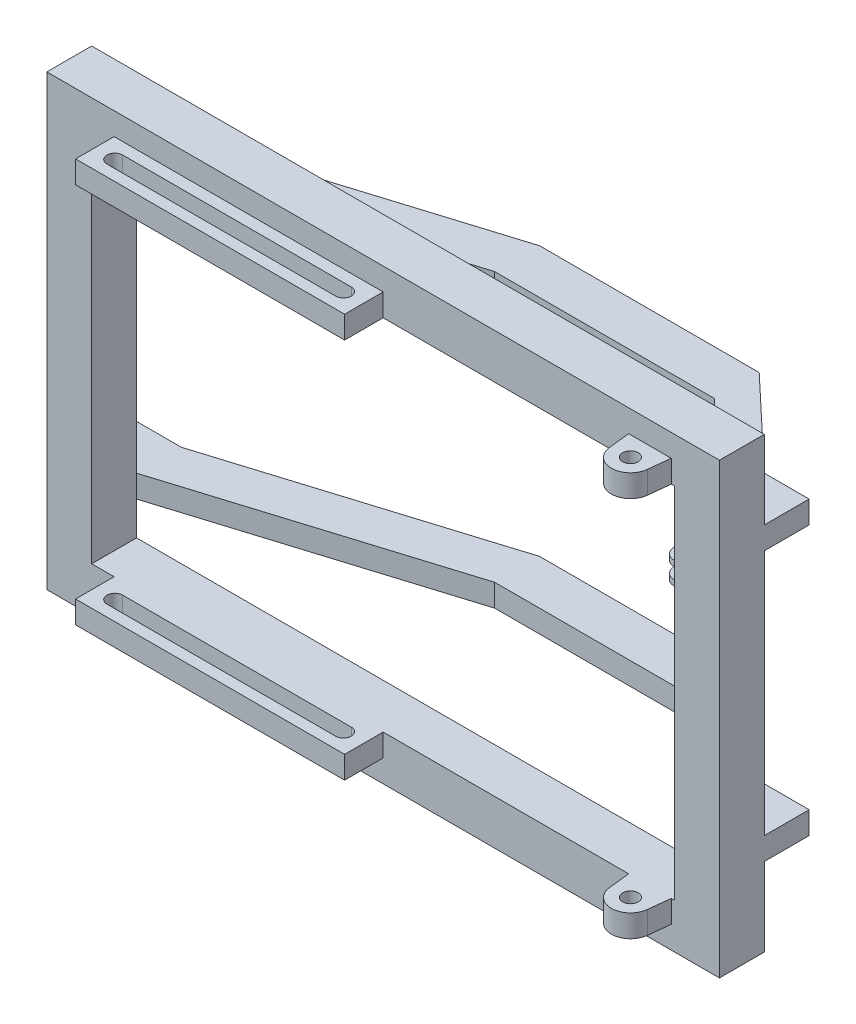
ISO-10303-21;
HEADER;
FILE_DESCRIPTION(('STEP AP214'),'2;1');
FILE_NAME('part.step','',(''),(''),'','','');
FILE_SCHEMA(('AUTOMOTIVE_DESIGN { 1 0 10303 214 1 1 1 1 }'));
ENDSEC;
DATA;
#1=APPLICATION_CONTEXT('core data for automotive mechanical design processes');
#2=APPLICATION_PROTOCOL_DEFINITION('international standard','automotive_design',2000,#1);
#3=PRODUCT_CONTEXT('',#1,'mechanical');
#4=PRODUCT('Part','Part','',(#3));
#5=PRODUCT_RELATED_PRODUCT_CATEGORY('part','',(#4));
#6=PRODUCT_DEFINITION_FORMATION('','',#4);
#7=PRODUCT_DEFINITION_CONTEXT('part definition',#1,'design');
#8=PRODUCT_DEFINITION('design','',#6,#7);
#9=PRODUCT_DEFINITION_SHAPE('','',#8);
#10=(LENGTH_UNIT() NAMED_UNIT(*) SI_UNIT(.MILLI.,.METRE.));
#11=(NAMED_UNIT(*) PLANE_ANGLE_UNIT() SI_UNIT($,.RADIAN.));
#12=(NAMED_UNIT(*) SI_UNIT($,.STERADIAN.) SOLID_ANGLE_UNIT());
#13=UNCERTAINTY_MEASURE_WITH_UNIT(LENGTH_MEASURE(1.E-05),#10,'distance_accuracy_value','');
#14=(GEOMETRIC_REPRESENTATION_CONTEXT(3) GLOBAL_UNCERTAINTY_ASSIGNED_CONTEXT((#13)) GLOBAL_UNIT_ASSIGNED_CONTEXT((#10,
#11,#12)) REPRESENTATION_CONTEXT('',''));
#15=CARTESIAN_POINT('',(0.,0.,0.));
#16=DIRECTION('',(0.,0.,1.));
#17=DIRECTION('',(1.,0.,0.));
#18=AXIS2_PLACEMENT_3D('',#15,#16,#17);
#19=CARTESIAN_POINT('',(770.,50.,-477.253370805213));
#20=DIRECTION('',(0.977683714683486,0.,-0.210082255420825));
#21=DIRECTION('',(-0.210082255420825,0.,-0.977683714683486));
#22=AXIS2_PLACEMENT_3D('',#19,#20,#21);
#23=PLANE('',#22);
#24=DIRECTION('',(0.210082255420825,0.,0.977683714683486));
#25=VECTOR('',#24,1.);
#26=CARTESIAN_POINT('',(770.,-25.,-477.253370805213));
#27=LINE('',#26,#25);
#28=CARTESIAN_POINT('',(781.302225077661,-25.,-424.654918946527));
#29=VERTEX_POINT('',#28);
#30=CARTESIAN_POINT('',(786.115814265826,-25.,-402.253370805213));
#31=VERTEX_POINT('',#30);
#32=EDGE_CURVE('E657',#29,#31,#27,.T.);
#33=ORIENTED_EDGE('',*,*,#32,.F.);
#34=DIRECTION('',(0.,1.,0.));
#35=VECTOR('',#34,1.);
#36=CARTESIAN_POINT('',(781.302225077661,-25.,-424.654918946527));
#37=LINE('',#36,#35);
#38=CARTESIAN_POINT('',(781.302225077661,25.,-424.654918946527));
#39=VERTEX_POINT('',#38);
#40=EDGE_CURVE('E649',#29,#39,#37,.T.);
#41=ORIENTED_EDGE('',*,*,#40,.T.);
#42=DIRECTION('',(0.210082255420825,0.,0.977683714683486));
#43=VECTOR('',#42,1.);
#44=CARTESIAN_POINT('',(770.,25.,-477.253370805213));
#45=LINE('',#44,#43);
#46=CARTESIAN_POINT('',(786.115814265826,25.,-402.253370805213));
#47=VERTEX_POINT('',#46);
#48=EDGE_CURVE('E636',#39,#47,#45,.T.);
#49=ORIENTED_EDGE('',*,*,#48,.T.);
#50=DIRECTION('',(0.,-1.,0.));
#51=VECTOR('',#50,1.);
#52=CARTESIAN_POINT('',(786.115814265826,50.,-402.253370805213));
#53=LINE('',#52,#51);
#54=CARTESIAN_POINT('',(786.115814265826,50.,-402.253370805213));
#55=VERTEX_POINT('',#54);
#56=EDGE_CURVE('E697',#55,#47,#53,.T.);
#57=ORIENTED_EDGE('',*,*,#56,.F.);
#58=DIRECTION('',(0.210082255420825,0.,0.977683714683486));
#59=VECTOR('',#58,1.);
#60=CARTESIAN_POINT('',(770.,50.,-477.253370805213));
#61=LINE('',#60,#59);
#62=CARTESIAN_POINT('',(770.,49.9999999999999,-477.253370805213));
#63=VERTEX_POINT('',#62);
#64=EDGE_CURVE('E671',#63,#55,#61,.T.);
#65=ORIENTED_EDGE('',*,*,#64,.F.);
#66=DIRECTION('',(0.,-1.,0.));
#67=VECTOR('',#66,1.);
#68=CARTESIAN_POINT('',(770.,50.,-477.253370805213));
#69=LINE('',#68,#67);
#70=CARTESIAN_POINT('',(770.,-50.,-477.253370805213));
#71=VERTEX_POINT('',#70);
#72=EDGE_CURVE('E699',#63,#71,#69,.T.);
#73=ORIENTED_EDGE('',*,*,#72,.T.);
#74=DIRECTION('',(0.210082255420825,0.,0.977683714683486));
#75=VECTOR('',#74,1.);
#76=CARTESIAN_POINT('',(770.,-50.,-477.253370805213));
#77=LINE('',#76,#75);
#78=CARTESIAN_POINT('',(786.115814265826,-50.,-402.253370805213));
#79=VERTEX_POINT('',#78);
#80=EDGE_CURVE('E682',#71,#79,#77,.T.);
#81=ORIENTED_EDGE('',*,*,#80,.T.);
#82=EDGE_CURVE('E696',#31,#79,#53,.T.);
#83=ORIENTED_EDGE('',*,*,#82,.F.);
#84=EDGE_LOOP('',(#33,#41,#49,#57,#65,#73,#81,#83));
#85=FACE_BOUND('',#84,.T.);
#86=ADVANCED_FACE('F33',(#85),#23,.F.);
#87=CARTESIAN_POINT('',(835.,50.,-412.757483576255));
#88=DIRECTION('',(0.,-1.,0.));
#89=DIRECTION('',(0.,0.,-1.));
#90=AXIS2_PLACEMENT_3D('',#87,#88,#89);
#91=CYLINDRICAL_SURFACE('',#90,50.);
#92=CARTESIAN_POINT('',(835.,-25.,-412.757483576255));
#93=DIRECTION('',(0.,1.,0.));
#94=DIRECTION('',(0.,0.,1.));
#95=AXIS2_PLACEMENT_3D('',#92,#93,#94);
#96=CIRCLE('',#95,50.);
#97=CARTESIAN_POINT('',(883.884185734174,-25.,-402.253370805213));
#98=VERTEX_POINT('',#97);
#99=EDGE_CURVE('E663',#31,#98,#96,.T.);
#100=ORIENTED_EDGE('',*,*,#99,.F.);
#101=ORIENTED_EDGE('',*,*,#82,.T.);
#102=CARTESIAN_POINT('',(835.,-50.,-412.757483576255));
#103=DIRECTION('',(0.,1.,0.));
#104=DIRECTION('',(0.,0.,1.));
#105=AXIS2_PLACEMENT_3D('',#102,#103,#104);
#106=CIRCLE('',#105,50.);
#107=CARTESIAN_POINT('',(883.884185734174,-50.,-402.253370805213));
#108=VERTEX_POINT('',#107);
#109=EDGE_CURVE('E685',#79,#108,#106,.T.);
#110=ORIENTED_EDGE('',*,*,#109,.T.);
#111=DIRECTION('',(0.,-1.,0.));
#112=VECTOR('',#111,1.);
#113=CARTESIAN_POINT('',(883.884185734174,50.,-402.253370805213));
#114=LINE('',#113,#112);
#115=EDGE_CURVE('E692',#98,#108,#114,.T.);
#116=ORIENTED_EDGE('',*,*,#115,.F.);
#117=EDGE_LOOP('',(#100,#101,#110,#116));
#118=FACE_BOUND('',#117,.T.);
#119=ADVANCED_FACE('F1425',(#118),#91,.T.);
#120=CARTESIAN_POINT('',(900.,50.,-477.253370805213));
#121=DIRECTION('',(0.977683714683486,0.,0.210082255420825));
#122=DIRECTION('',(0.210082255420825,0.,-0.977683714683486));
#123=AXIS2_PLACEMENT_3D('',#120,#121,#122);
#124=PLANE('',#123);
#125=DIRECTION('',(0.,1.,0.));
#126=VECTOR('',#125,1.);
#127=CARTESIAN_POINT('',(888.697774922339,-25.,-424.654918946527));
#128=LINE('',#127,#126);
#129=CARTESIAN_POINT('',(888.697774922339,-25.,-424.654918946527));
#130=VERTEX_POINT('',#129);
#131=CARTESIAN_POINT('',(888.697774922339,25.,-424.654918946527));
#132=VERTEX_POINT('',#131);
#133=EDGE_CURVE('E11',#130,#132,#128,.T.);
#134=ORIENTED_EDGE('',*,*,#133,.F.);
#135=DIRECTION('',(-0.210082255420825,0.,0.977683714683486));
#136=VECTOR('',#135,1.);
#137=CARTESIAN_POINT('',(900.,-25.,-477.253370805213));
#138=LINE('',#137,#136);
#139=EDGE_CURVE('E1871',#130,#98,#138,.T.);
#140=ORIENTED_EDGE('',*,*,#139,.T.);
#141=ORIENTED_EDGE('',*,*,#115,.T.);
#142=DIRECTION('',(-0.210082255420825,0.,0.977683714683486));
#143=VECTOR('',#142,1.);
#144=CARTESIAN_POINT('',(900.,-50.,-477.253370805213));
#145=LINE('',#144,#143);
#146=CARTESIAN_POINT('',(900.,-50.,-477.253370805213));
#147=VERTEX_POINT('',#146);
#148=EDGE_CURVE('E672',#147,#108,#145,.T.);
#149=ORIENTED_EDGE('',*,*,#148,.F.);
#150=DIRECTION('',(0.,-1.,0.));
#151=VECTOR('',#150,1.);
#152=CARTESIAN_POINT('',(900.,50.,-477.253370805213));
#153=LINE('',#152,#151);
#154=CARTESIAN_POINT('',(900.,50.,-477.253370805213));
#155=VERTEX_POINT('',#154);
#156=EDGE_CURVE('E679',#155,#147,#153,.T.);
#157=ORIENTED_EDGE('',*,*,#156,.F.);
#158=DIRECTION('',(-0.210082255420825,0.,0.977683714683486));
#159=VECTOR('',#158,1.);
#160=CARTESIAN_POINT('',(900.,50.,-477.253370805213));
#161=LINE('',#160,#159);
#162=CARTESIAN_POINT('',(883.884185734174,50.,-402.253370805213));
#163=VERTEX_POINT('',#162);
#164=EDGE_CURVE('E676',#155,#163,#161,.T.);
#165=ORIENTED_EDGE('',*,*,#164,.T.);
#166=CARTESIAN_POINT('',(883.884185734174,25.,-402.253370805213));
#167=VERTEX_POINT('',#166);
#168=EDGE_CURVE('E693',#163,#167,#114,.T.);
#169=ORIENTED_EDGE('',*,*,#168,.T.);
#170=DIRECTION('',(-0.210082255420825,0.,0.977683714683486));
#171=VECTOR('',#170,1.);
#172=CARTESIAN_POINT('',(900.,25.,-477.253370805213));
#173=LINE('',#172,#171);
#174=EDGE_CURVE('E1864',#132,#167,#173,.T.);
#175=ORIENTED_EDGE('',*,*,#174,.F.);
#176=EDGE_LOOP('',(#134,#140,#141,#149,#157,#165,#169,#175));
#177=FACE_BOUND('',#176,.T.);
#178=ADVANCED_FACE('F1430',(#177),#124,.T.);
#179=CARTESIAN_POINT('',(835.,50.,-412.757483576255));
#180=DIRECTION('',(0.,-1.,0.));
#181=DIRECTION('',(0.,0.,-1.));
#182=AXIS2_PLACEMENT_3D('',#179,#180,#181);
#183=CYLINDRICAL_SURFACE('',#182,22.5);
#184=CARTESIAN_POINT('',(835.,-50.,-412.757483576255));
#185=DIRECTION('',(0.,1.,0.));
#186=DIRECTION('',(0.,0.,1.));
#187=AXIS2_PLACEMENT_3D('',#184,#185,#186);
#188=CIRCLE('',#187,22.5);
#189=CARTESIAN_POINT('',(835.,-50.,-390.257483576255));
#190=VERTEX_POINT('',#189);
#191=EDGE_CURVE('E658',#190,#190,#188,.T.);
#192=ORIENTED_EDGE('',*,*,#191,.F.);
#193=EDGE_LOOP('',(#192));
#194=FACE_BOUND('',#193,.T.);
#195=CARTESIAN_POINT('',(835.,-25.,-412.757483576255));
#196=DIRECTION('',(0.,1.,0.));
#197=DIRECTION('',(0.,0.,1.));
#198=AXIS2_PLACEMENT_3D('',#195,#196,#197);
#199=CIRCLE('',#198,22.5);
#200=CARTESIAN_POINT('',(835.,-25.,-390.257483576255));
#201=VERTEX_POINT('',#200);
#202=EDGE_CURVE('E644',#201,#201,#199,.T.);
#203=ORIENTED_EDGE('',*,*,#202,.T.);
#204=EDGE_LOOP('',(#203));
#205=FACE_BOUND('',#204,.T.);
#206=ADVANCED_FACE('F1883',(#194,#205),#183,.F.);
#207=CARTESIAN_POINT('',(900.,650.,-477.253370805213));
#208=DIRECTION('',(0.,0.,1.));
#209=DIRECTION('',(1.,0.,0.));
#210=AXIS2_PLACEMENT_3D('',#207,#208,#209);
#211=PLANE('',#210);
#212=DIRECTION('',(0.,-1.,0.));
#213=VECTOR('',#212,1.);
#214=CARTESIAN_POINT('',(900.,550.,-477.253370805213));
#215=LINE('',#214,#213);
#216=CARTESIAN_POINT('',(900.,-550.,-477.253370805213));
#217=VERTEX_POINT('',#216);
#218=EDGE_CURVE('E702',#147,#217,#215,.T.);
#219=ORIENTED_EDGE('',*,*,#218,.F.);
#220=DIRECTION('',(-1.,0.,0.));
#221=VECTOR('',#220,1.);
#222=CARTESIAN_POINT('',(900.,-50.,-477.253370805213));
#223=LINE('',#222,#221);
#224=EDGE_CURVE('E668',#147,#71,#223,.T.);
#225=ORIENTED_EDGE('',*,*,#224,.T.);
#226=DIRECTION('',(0.,1.,0.));
#227=VECTOR('',#226,1.);
#228=CARTESIAN_POINT('',(770.,-550.,-477.253370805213));
#229=LINE('',#228,#227);
#230=CARTESIAN_POINT('',(770.,-550.,-477.253370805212));
#231=VERTEX_POINT('',#230);
#232=EDGE_CURVE('E711',#231,#71,#229,.T.);
#233=ORIENTED_EDGE('',*,*,#232,.F.);
#234=DIRECTION('',(-1.,0.,0.));
#235=VECTOR('',#234,1.);
#236=CARTESIAN_POINT('',(900.,-550.,-477.253370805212));
#237=LINE('',#236,#235);
#238=CARTESIAN_POINT('',(-79.9999999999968,-550.,-477.253370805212));
#239=VERTEX_POINT('',#238);
#240=EDGE_CURVE('E926',#231,#239,#237,.T.);
#241=ORIENTED_EDGE('',*,*,#240,.T.);
#242=DIRECTION('',(0.,-1.,0.));
#243=VECTOR('',#242,1.);
#244=CARTESIAN_POINT('',(-79.9999999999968,-550.,-477.253370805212));
#245=LINE('',#244,#243);
#246=CARTESIAN_POINT('',(-79.9999999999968,-650.,-477.253370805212));
#247=VERTEX_POINT('',#246);
#248=EDGE_CURVE('E972',#239,#247,#245,.T.);
#249=ORIENTED_EDGE('',*,*,#248,.T.);
#250=DIRECTION('',(-1.,0.,0.));
#251=VECTOR('',#250,1.);
#252=CARTESIAN_POINT('',(900.,-650.,-477.253370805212));
#253=LINE('',#252,#251);
#254=CARTESIAN_POINT('',(900.,-650.,-477.253370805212));
#255=VERTEX_POINT('',#254);
#256=EDGE_CURVE('E960',#255,#247,#253,.T.);
#257=ORIENTED_EDGE('',*,*,#256,.F.);
#258=DIRECTION('',(0.,-1.,0.));
#259=VECTOR('',#258,1.);
#260=CARTESIAN_POINT('',(900.,-550.,-477.253370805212));
#261=LINE('',#260,#259);
#262=EDGE_CURVE('E974',#217,#255,#261,.T.);
#263=ORIENTED_EDGE('',*,*,#262,.F.);
#264=EDGE_LOOP('',(#219,#225,#233,#241,#249,#257,#263));
#265=FACE_BOUND('',#264,.T.);
#266=ADVANCED_FACE('F1608',(#265),#211,.T.);
#267=CARTESIAN_POINT('',(-1500.,550.,-300.));
#268=DIRECTION('',(0.,-1.,0.));
#269=DIRECTION('',(0.,0.,-1.));
#270=AXIS2_PLACEMENT_3D('',#267,#268,#269);
#271=PLANE('',#270);
#272=DIRECTION('',(0.,0.,-1.));
#273=VECTOR('',#272,1.);
#274=CARTESIAN_POINT('',(900.,550.,630.401810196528));
#275=LINE('',#274,#273);
#276=CARTESIAN_POINT('',(900.,550.,-477.253370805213));
#277=VERTEX_POINT('',#276);
#278=CARTESIAN_POINT('',(900.,550.,-677.253370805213));
#279=VERTEX_POINT('',#278);
#280=EDGE_CURVE('E720',#277,#279,#275,.T.);
#281=ORIENTED_EDGE('',*,*,#280,.T.);
#282=DIRECTION('',(0.727489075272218,0.,0.686119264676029));
#283=VECTOR('',#282,1.);
#284=CARTESIAN_POINT('',(900.,550.,-677.253370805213));
#285=LINE('',#284,#283);
#286=CARTESIAN_POINT('',(1300.,550.,-300.));
#287=VERTEX_POINT('',#286);
#288=EDGE_CURVE('E1036',#279,#287,#285,.T.);
#289=ORIENTED_EDGE('',*,*,#288,.T.);
#290=DIRECTION('',(1.,0.,0.));
#291=VECTOR('',#290,1.);
#292=CARTESIAN_POINT('',(1300.,550.,-300.));
#293=LINE('',#292,#291);
#294=CARTESIAN_POINT('',(1500.,550.,-300.));
#295=VERTEX_POINT('',#294);
#296=EDGE_CURVE('E1039',#287,#295,#293,.T.);
#297=ORIENTED_EDGE('',*,*,#296,.T.);
#298=DIRECTION('',(0.,0.,-1.));
#299=VECTOR('',#298,1.);
#300=CARTESIAN_POINT('',(1500.,550.,-100.));
#301=LINE('',#300,#299);
#302=CARTESIAN_POINT('',(1500.,550.,-100.));
#303=VERTEX_POINT('',#302);
#304=EDGE_CURVE('E1042',#303,#295,#301,.T.);
#305=ORIENTED_EDGE('',*,*,#304,.F.);
#306=DIRECTION('',(1.,0.,0.));
#307=VECTOR('',#306,1.);
#308=CARTESIAN_POINT('',(1300.,550.,-100.));
#309=LINE('',#308,#307);
#310=CARTESIAN_POINT('',(1300.,550.,-100.));
#311=VERTEX_POINT('',#310);
#312=EDGE_CURVE('E1045',#311,#303,#309,.T.);
#313=ORIENTED_EDGE('',*,*,#312,.F.);
#314=DIRECTION('',(-0.727489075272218,0.,-0.686119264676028));
#315=VECTOR('',#314,1.);
#316=CARTESIAN_POINT('',(1300.,550.,-100.));
#317=LINE('',#316,#315);
#318=EDGE_CURVE('E1048',#311,#277,#317,.T.);
#319=ORIENTED_EDGE('',*,*,#318,.T.);
#320=EDGE_LOOP('',(#281,#289,#297,#305,#313,#319));
#321=FACE_BOUND('',#320,.T.);
#322=ADVANCED_FACE('F1602',(#321),#271,.T.);
#323=CARTESIAN_POINT('',(-1500.,-550.,-300.));
#324=DIRECTION('',(0.,-1.,0.));
#325=DIRECTION('',(0.,0.,-1.));
#326=AXIS2_PLACEMENT_3D('',#323,#324,#325);
#327=PLANE('',#326);
#328=DIRECTION('',(0.727489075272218,0.,0.686119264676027));
#329=VECTOR('',#328,1.);
#330=CARTESIAN_POINT('',(900.,-550.,-677.253370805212));
#331=LINE('',#330,#329);
#332=CARTESIAN_POINT('',(900.,-550.,-677.253370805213));
#333=VERTEX_POINT('',#332);
#334=CARTESIAN_POINT('',(1300.,-550.,-300.));
#335=VERTEX_POINT('',#334);
#336=EDGE_CURVE('E912',#333,#335,#331,.T.);
#337=ORIENTED_EDGE('',*,*,#336,.F.);
#338=DIRECTION('',(0.,0.,-1.));
#339=VECTOR('',#338,1.);
#340=CARTESIAN_POINT('',(900.,-550.,630.401810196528));
#341=LINE('',#340,#339);
#342=EDGE_CURVE('E719',#217,#333,#341,.T.);
#343=ORIENTED_EDGE('',*,*,#342,.F.);
#344=DIRECTION('',(-0.727489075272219,0.,-0.686119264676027));
#345=VECTOR('',#344,1.);
#346=CARTESIAN_POINT('',(1300.,-550.,-100.));
#347=LINE('',#346,#345);
#348=CARTESIAN_POINT('',(1300.,-550.,-100.));
#349=VERTEX_POINT('',#348);
#350=EDGE_CURVE('E923',#349,#217,#347,.T.);
#351=ORIENTED_EDGE('',*,*,#350,.F.);
#352=DIRECTION('',(1.,0.,0.));
#353=VECTOR('',#352,1.);
#354=CARTESIAN_POINT('',(1300.,-550.,-100.));
#355=LINE('',#354,#353);
#356=CARTESIAN_POINT('',(1500.,-550.,-100.));
#357=VERTEX_POINT('',#356);
#358=EDGE_CURVE('E920',#349,#357,#355,.T.);
#359=ORIENTED_EDGE('',*,*,#358,.T.);
#360=DIRECTION('',(0.,0.,-1.));
#361=VECTOR('',#360,1.);
#362=CARTESIAN_POINT('',(1500.,-550.,-100.));
#363=LINE('',#362,#361);
#364=CARTESIAN_POINT('',(1500.,-550.,-300.));
#365=VERTEX_POINT('',#364);
#366=EDGE_CURVE('E918',#357,#365,#363,.T.);
#367=ORIENTED_EDGE('',*,*,#366,.T.);
#368=DIRECTION('',(1.,0.,0.));
#369=VECTOR('',#368,1.);
#370=CARTESIAN_POINT('',(1300.,-550.,-300.));
#371=LINE('',#370,#369);
#372=EDGE_CURVE('E915',#335,#365,#371,.T.);
#373=ORIENTED_EDGE('',*,*,#372,.F.);
#374=EDGE_LOOP('',(#337,#343,#351,#359,#367,#373));
#375=FACE_BOUND('',#374,.T.);
#376=ADVANCED_FACE('F1567',(#375),#327,.F.);
#377=CARTESIAN_POINT('',(-1500.,1000.,-100.));
#378=DIRECTION('',(0.,0.,1.));
#379=DIRECTION('',(1.,0.,0.));
#380=AXIS2_PLACEMENT_3D('',#377,#378,#379);
#381=PLANE('',#380);
#382=DIRECTION('',(1.,0.,0.));
#383=VECTOR('',#382,1.);
#384=CARTESIAN_POINT('',(-1500.,-550.,-100.));
#385=LINE('',#384,#383);
#386=CARTESIAN_POINT('',(-1500.,-550.,-100.));
#387=VERTEX_POINT('',#386);
#388=CARTESIAN_POINT('',(-1300.,-550.,-100.));
#389=VERTEX_POINT('',#388);
#390=EDGE_CURVE('E931',#387,#389,#385,.T.);
#391=ORIENTED_EDGE('',*,*,#390,.F.);
#392=DIRECTION('',(0.,-1.,0.));
#393=VECTOR('',#392,1.);
#394=CARTESIAN_POINT('',(-1500.,1000.,-100.));
#395=LINE('',#394,#393);
#396=CARTESIAN_POINT('',(-1500.,550.,-100.));
#397=VERTEX_POINT('',#396);
#398=EDGE_CURVE('E1323',#397,#387,#395,.T.);
#399=ORIENTED_EDGE('',*,*,#398,.F.);
#400=DIRECTION('',(1.,0.,0.));
#401=VECTOR('',#400,1.);
#402=CARTESIAN_POINT('',(-1500.,550.,-100.));
#403=LINE('',#402,#401);
#404=CARTESIAN_POINT('',(-1300.,550.,-100.));
#405=VERTEX_POINT('',#404);
#406=EDGE_CURVE('E993',#397,#405,#403,.T.);
#407=ORIENTED_EDGE('',*,*,#406,.T.);
#408=DIRECTION('',(0.,-1.,0.));
#409=VECTOR('',#408,1.);
#410=CARTESIAN_POINT('',(-1300.,800.,-100.));
#411=LINE('',#410,#409);
#412=EDGE_CURVE('E1357',#405,#389,#411,.T.);
#413=ORIENTED_EDGE('',*,*,#412,.T.);
#414=EDGE_LOOP('',(#391,#399,#407,#413));
#415=FACE_BOUND('',#414,.T.);
#416=ADVANCED_FACE('F1666',(#415),#381,.F.);
#417=ORIENTED_EDGE('',*,*,#358,.F.);
#418=DIRECTION('',(0.,1.,0.));
#419=VECTOR('',#418,1.);
#420=CARTESIAN_POINT('',(1300.,-800.,-100.));
#421=LINE('',#420,#419);
#422=EDGE_CURVE('E1349',#349,#311,#421,.T.);
#423=ORIENTED_EDGE('',*,*,#422,.T.);
#424=ORIENTED_EDGE('',*,*,#312,.T.);
#425=DIRECTION('',(0.,1.,0.));
#426=VECTOR('',#425,1.);
#427=CARTESIAN_POINT('',(1500.,-1000.,-100.));
#428=LINE('',#427,#426);
#429=EDGE_CURVE('E1315',#357,#303,#428,.T.);
#430=ORIENTED_EDGE('',*,*,#429,.F.);
#431=EDGE_LOOP('',(#417,#423,#424,#430));
#432=FACE_BOUND('',#431,.T.);
#433=ADVANCED_FACE('F1842',(#432),#381,.F.);
#434=DIRECTION('',(1.,0.,0.));
#435=VECTOR('',#434,1.);
#436=CARTESIAN_POINT('',(-1500.,650.,-100.));
#437=LINE('',#436,#435);
#438=CARTESIAN_POINT('',(-1500.,650.,-100.));
#439=VERTEX_POINT('',#438);
#440=CARTESIAN_POINT('',(-1300.,650.,-100.));
#441=VERTEX_POINT('',#440);
#442=EDGE_CURVE('E1022',#439,#441,#437,.T.);
#443=ORIENTED_EDGE('',*,*,#442,.F.);
#444=CARTESIAN_POINT('',(-1500.,1000.,-100.));
#445=VERTEX_POINT('',#444);
#446=EDGE_CURVE('E1320',#445,#439,#395,.T.);
#447=ORIENTED_EDGE('',*,*,#446,.F.);
#448=DIRECTION('',(1.,0.,0.));
#449=VECTOR('',#448,1.);
#450=CARTESIAN_POINT('',(-1500.,1000.,-100.));
#451=LINE('',#450,#449);
#452=CARTESIAN_POINT('',(1500.,1000.,-100.));
#453=VERTEX_POINT('',#452);
#454=EDGE_CURVE('E1308',#445,#453,#451,.T.);
#455=ORIENTED_EDGE('',*,*,#454,.T.);
#456=CARTESIAN_POINT('',(1500.,650.,-100.));
#457=VERTEX_POINT('',#456);
#458=EDGE_CURVE('E1316',#457,#453,#428,.T.);
#459=ORIENTED_EDGE('',*,*,#458,.F.);
#460=DIRECTION('',(1.,0.,0.));
#461=VECTOR('',#460,1.);
#462=CARTESIAN_POINT('',(1300.,650.,-100.));
#463=LINE('',#462,#461);
#464=CARTESIAN_POINT('',(1300.,650.,-100.));
#465=VERTEX_POINT('',#464);
#466=EDGE_CURVE('E1010',#465,#457,#463,.T.);
#467=ORIENTED_EDGE('',*,*,#466,.F.);
#468=CARTESIAN_POINT('',(1300.,800.,-100.));
#469=VERTEX_POINT('',#468);
#470=EDGE_CURVE('E1350',#465,#469,#421,.T.);
#471=ORIENTED_EDGE('',*,*,#470,.T.);
#472=DIRECTION('',(1.,0.,0.));
#473=VECTOR('',#472,1.);
#474=CARTESIAN_POINT('',(-1300.,800.,-100.));
#475=LINE('',#474,#473);
#476=CARTESIAN_POINT('',(-1300.,800.,-100.));
#477=VERTEX_POINT('',#476);
#478=EDGE_CURVE('E1343',#477,#469,#475,.T.);
#479=ORIENTED_EDGE('',*,*,#478,.F.);
#480=EDGE_CURVE('E1288',#477,#441,#411,.T.);
#481=ORIENTED_EDGE('',*,*,#480,.T.);
#482=EDGE_LOOP('',(#443,#447,#455,#459,#467,#471,#479,#481));
#483=FACE_BOUND('',#482,.T.);
#484=ADVANCED_FACE('F1679',(#483),#381,.F.);
#485=CARTESIAN_POINT('',(-1500.,1000.,100.));
#486=DIRECTION('',(0.,0.,1.));
#487=DIRECTION('',(1.,0.,0.));
#488=AXIS2_PLACEMENT_3D('',#485,#486,#487);
#489=PLANE('',#488);
#490=DIRECTION('',(0.,-1.,0.));
#491=VECTOR('',#490,1.);
#492=CARTESIAN_POINT('',(-1500.,1000.,100.));
#493=LINE('',#492,#491);
#494=CARTESIAN_POINT('',(-1500.,1000.,100.));
#495=VERTEX_POINT('',#494);
#496=CARTESIAN_POINT('',(-1500.,-1000.,100.));
#497=VERTEX_POINT('',#496);
#498=EDGE_CURVE('E1311',#495,#497,#493,.T.);
#499=ORIENTED_EDGE('',*,*,#498,.T.);
#500=DIRECTION('',(-1.,0.,0.));
#501=VECTOR('',#500,1.);
#502=CARTESIAN_POINT('',(1500.,-1000.,100.));
#503=LINE('',#502,#501);
#504=CARTESIAN_POINT('',(1500.,-1000.,100.));
#505=VERTEX_POINT('',#504);
#506=EDGE_CURVE('E1329',#505,#497,#503,.T.);
#507=ORIENTED_EDGE('',*,*,#506,.F.);
#508=DIRECTION('',(0.,1.,0.));
#509=VECTOR('',#508,1.);
#510=CARTESIAN_POINT('',(1500.,-1000.,100.));
#511=LINE('',#510,#509);
#512=CARTESIAN_POINT('',(1500.,1000.,100.));
#513=VERTEX_POINT('',#512);
#514=EDGE_CURVE('E1327',#505,#513,#511,.T.);
#515=ORIENTED_EDGE('',*,*,#514,.T.);
#516=DIRECTION('',(1.,0.,0.));
#517=VECTOR('',#516,1.);
#518=CARTESIAN_POINT('',(-1500.,1000.,100.));
#519=LINE('',#518,#517);
#520=EDGE_CURVE('E1307',#495,#513,#519,.T.);
#521=ORIENTED_EDGE('',*,*,#520,.F.);
#522=EDGE_LOOP('',(#499,#507,#515,#521));
#523=FACE_BOUND('',#522,.T.);
#524=DIRECTION('',(-1.,0.,0.));
#525=VECTOR('',#524,1.);
#526=CARTESIAN_POINT('',(1300.,-800.,100.));
#527=LINE('',#526,#525);
#528=CARTESIAN_POINT('',(1300.,-800.,100.));
#529=VERTEX_POINT('',#528);
#530=CARTESIAN_POINT('',(1285.,-800.,100.));
#531=VERTEX_POINT('',#530);
#532=EDGE_CURVE('E1382',#529,#531,#527,.T.);
#533=ORIENTED_EDGE('',*,*,#532,.T.);
#534=DIRECTION('',(0.,1.,0.));
#535=VECTOR('',#534,1.);
#536=CARTESIAN_POINT('',(1285.,-900.,100.));
#537=LINE('',#536,#535);
#538=CARTESIAN_POINT('',(1285.,-900.,100.));
#539=VERTEX_POINT('',#538);
#540=EDGE_CURVE('E1112',#539,#531,#537,.T.);
#541=ORIENTED_EDGE('',*,*,#540,.F.);
#542=DIRECTION('',(-1.,0.,0.));
#543=VECTOR('',#542,1.);
#544=CARTESIAN_POINT('',(1285.,-900.,100.));
#545=LINE('',#544,#543);
#546=CARTESIAN_POINT('',(1095.,-900.,100.));
#547=VERTEX_POINT('',#546);
#548=EDGE_CURVE('E1088',#539,#547,#545,.T.);
#549=ORIENTED_EDGE('',*,*,#548,.T.);
#550=DIRECTION('',(0.,1.,0.));
#551=VECTOR('',#550,1.);
#552=CARTESIAN_POINT('',(1095.,-900.,100.));
#553=LINE('',#552,#551);
#554=CARTESIAN_POINT('',(1095.,-800.,100.));
#555=VERTEX_POINT('',#554);
#556=EDGE_CURVE('E1098',#547,#555,#553,.T.);
#557=ORIENTED_EDGE('',*,*,#556,.T.);
#558=CARTESIAN_POINT('',(0.,-800.,100.));
#559=VERTEX_POINT('',#558);
#560=EDGE_CURVE('E1383',#555,#559,#527,.T.);
#561=ORIENTED_EDGE('',*,*,#560,.T.);
#562=DIRECTION('',(0.,1.,0.));
#563=VECTOR('',#562,1.);
#564=CARTESIAN_POINT('',(0.,-900.,100.));
#565=LINE('',#564,#563);
#566=CARTESIAN_POINT('',(0.,-900.,100.));
#567=VERTEX_POINT('',#566);
#568=EDGE_CURVE('E1206',#567,#559,#565,.T.);
#569=ORIENTED_EDGE('',*,*,#568,.F.);
#570=DIRECTION('',(1.,0.,0.));
#571=VECTOR('',#570,1.);
#572=CARTESIAN_POINT('',(-1200.,-900.,100.));
#573=LINE('',#572,#571);
#574=CARTESIAN_POINT('',(-1200.,-899.999999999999,100.));
#575=VERTEX_POINT('',#574);
#576=EDGE_CURVE('E1186',#575,#567,#573,.T.);
#577=ORIENTED_EDGE('',*,*,#576,.F.);
#578=DIRECTION('',(0.,1.,0.));
#579=VECTOR('',#578,1.);
#580=CARTESIAN_POINT('',(-1200.,-900.,100.));
#581=LINE('',#580,#579);
#582=CARTESIAN_POINT('',(-1200.,-800.,100.));
#583=VERTEX_POINT('',#582);
#584=EDGE_CURVE('E1209',#575,#583,#581,.T.);
#585=ORIENTED_EDGE('',*,*,#584,.T.);
#586=CARTESIAN_POINT('',(-1300.,-800.,100.));
#587=VERTEX_POINT('',#586);
#588=EDGE_CURVE('E1381',#583,#587,#527,.T.);
#589=ORIENTED_EDGE('',*,*,#588,.T.);
#590=DIRECTION('',(0.,-1.,0.));
#591=VECTOR('',#590,1.);
#592=CARTESIAN_POINT('',(-1300.,800.,100.));
#593=LINE('',#592,#591);
#594=CARTESIAN_POINT('',(-1300.,800.,100.));
#595=VERTEX_POINT('',#594);
#596=EDGE_CURVE('E1346',#595,#587,#593,.T.);
#597=ORIENTED_EDGE('',*,*,#596,.F.);
#598=DIRECTION('',(1.,0.,0.));
#599=VECTOR('',#598,1.);
#600=CARTESIAN_POINT('',(-1300.,800.,100.));
#601=LINE('',#600,#599);
#602=CARTESIAN_POINT('',(-1200.,800.,100.));
#603=VERTEX_POINT('',#602);
#604=EDGE_CURVE('E1294',#595,#603,#601,.T.);
#605=ORIENTED_EDGE('',*,*,#604,.T.);
#606=DIRECTION('',(0.,-1.,0.));
#607=VECTOR('',#606,1.);
#608=CARTESIAN_POINT('',(-1200.,900.,100.));
#609=LINE('',#608,#607);
#610=CARTESIAN_POINT('',(-1200.,900.,100.));
#611=VERTEX_POINT('',#610);
#612=EDGE_CURVE('E1256',#611,#603,#609,.T.);
#613=ORIENTED_EDGE('',*,*,#612,.F.);
#614=DIRECTION('',(1.,0.,0.));
#615=VECTOR('',#614,1.);
#616=CARTESIAN_POINT('',(-1200.,900.,100.));
#617=LINE('',#616,#615);
#618=CARTESIAN_POINT('',(0.,900.,100.));
#619=VERTEX_POINT('',#618);
#620=EDGE_CURVE('E1253',#611,#619,#617,.T.);
#621=ORIENTED_EDGE('',*,*,#620,.T.);
#622=DIRECTION('',(0.,-1.,0.));
#623=VECTOR('',#622,1.);
#624=CARTESIAN_POINT('',(0.,900.,100.));
#625=LINE('',#624,#623);
#626=CARTESIAN_POINT('',(0.,800.,100.));
#627=VERTEX_POINT('',#626);
#628=EDGE_CURVE('E1265',#619,#627,#625,.T.);
#629=ORIENTED_EDGE('',*,*,#628,.T.);
#630=CARTESIAN_POINT('',(1095.,800.,100.));
#631=VERTEX_POINT('',#630);
#632=EDGE_CURVE('E1281',#627,#631,#601,.T.);
#633=ORIENTED_EDGE('',*,*,#632,.T.);
#634=DIRECTION('',(0.,-1.,0.));
#635=VECTOR('',#634,1.);
#636=CARTESIAN_POINT('',(1095.,900.,100.));
#637=LINE('',#636,#635);
#638=CARTESIAN_POINT('',(1095.,900.,100.));
#639=VERTEX_POINT('',#638);
#640=EDGE_CURVE('E1148',#639,#631,#637,.T.);
#641=ORIENTED_EDGE('',*,*,#640,.F.);
#642=DIRECTION('',(-1.,0.,0.));
#643=VECTOR('',#642,1.);
#644=CARTESIAN_POINT('',(1285.,900.,100.));
#645=LINE('',#644,#643);
#646=CARTESIAN_POINT('',(1285.,900.,100.));
#647=VERTEX_POINT('',#646);
#648=EDGE_CURVE('E1122',#647,#639,#645,.T.);
#649=ORIENTED_EDGE('',*,*,#648,.F.);
#650=DIRECTION('',(0.,-1.,0.));
#651=VECTOR('',#650,1.);
#652=CARTESIAN_POINT('',(1285.,900.,100.));
#653=LINE('',#652,#651);
#654=CARTESIAN_POINT('',(1285.,800.,100.));
#655=VERTEX_POINT('',#654);
#656=EDGE_CURVE('E1134',#647,#655,#653,.T.);
#657=ORIENTED_EDGE('',*,*,#656,.T.);
#658=CARTESIAN_POINT('',(1300.,800.,100.));
#659=VERTEX_POINT('',#658);
#660=EDGE_CURVE('E1278',#655,#659,#601,.T.);
#661=ORIENTED_EDGE('',*,*,#660,.T.);
#662=DIRECTION('',(0.,1.,0.));
#663=VECTOR('',#662,1.);
#664=CARTESIAN_POINT('',(1300.,-800.,100.));
#665=LINE('',#664,#663);
#666=EDGE_CURVE('E1282',#529,#659,#665,.T.);
#667=ORIENTED_EDGE('',*,*,#666,.F.);
#668=EDGE_LOOP('',(#533,#541,#549,#557,#561,#569,#577,#585,#589,#597,#605,#613,#621,#629,#633,
#641,#649,#657,#661,#667));
#669=FACE_BOUND('',#668,.T.);
#670=ADVANCED_FACE('F1389',(#523,#669),#489,.T.);
#671=CARTESIAN_POINT('',(-1500.,-650.,-100.));
#672=VERTEX_POINT('',#671);
#673=CARTESIAN_POINT('',(-1500.,-1000.,-100.));
#674=VERTEX_POINT('',#673);
#675=EDGE_CURVE('E1324',#672,#674,#395,.T.);
#676=ORIENTED_EDGE('',*,*,#675,.F.);
#677=DIRECTION('',(1.,0.,0.));
#678=VECTOR('',#677,1.);
#679=CARTESIAN_POINT('',(-1500.,-650.,-100.));
#680=LINE('',#679,#678);
#681=CARTESIAN_POINT('',(-1300.,-650.,-100.));
#682=VERTEX_POINT('',#681);
#683=EDGE_CURVE('E903',#672,#682,#680,.T.);
#684=ORIENTED_EDGE('',*,*,#683,.T.);
#685=CARTESIAN_POINT('',(-1300.,-800.,-100.));
#686=VERTEX_POINT('',#685);
#687=EDGE_CURVE('E1358',#682,#686,#411,.T.);
#688=ORIENTED_EDGE('',*,*,#687,.T.);
#689=DIRECTION('',(-1.,0.,0.));
#690=VECTOR('',#689,1.);
#691=CARTESIAN_POINT('',(1300.,-800.,-100.));
#692=LINE('',#691,#690);
#693=CARTESIAN_POINT('',(1300.,-800.,-100.));
#694=VERTEX_POINT('',#693);
#695=EDGE_CURVE('E1351',#694,#686,#692,.T.);
#696=ORIENTED_EDGE('',*,*,#695,.F.);
#697=CARTESIAN_POINT('',(1300.,-650.,-100.));
#698=VERTEX_POINT('',#697);
#699=EDGE_CURVE('E1347',#694,#698,#421,.T.);
#700=ORIENTED_EDGE('',*,*,#699,.T.);
#701=DIRECTION('',(1.,0.,0.));
#702=VECTOR('',#701,1.);
#703=CARTESIAN_POINT('',(1300.,-650.,-100.));
#704=LINE('',#703,#702);
#705=CARTESIAN_POINT('',(1500.,-650.,-100.));
#706=VERTEX_POINT('',#705);
#707=EDGE_CURVE('E955',#698,#706,#704,.T.);
#708=ORIENTED_EDGE('',*,*,#707,.T.);
#709=CARTESIAN_POINT('',(1500.,-1000.,-100.));
#710=VERTEX_POINT('',#709);
#711=EDGE_CURVE('E1312',#710,#706,#428,.T.);
#712=ORIENTED_EDGE('',*,*,#711,.F.);
#713=DIRECTION('',(-1.,0.,0.));
#714=VECTOR('',#713,1.);
#715=CARTESIAN_POINT('',(1500.,-1000.,-100.));
#716=LINE('',#715,#714);
#717=EDGE_CURVE('E1317',#710,#674,#716,.T.);
#718=ORIENTED_EDGE('',*,*,#717,.T.);
#719=EDGE_LOOP('',(#676,#684,#688,#696,#700,#708,#712,#718));
#720=FACE_BOUND('',#719,.T.);
#721=ADVANCED_FACE('F1662',(#720),#381,.F.);
#722=CARTESIAN_POINT('',(-1500.,1000.,100.));
#723=DIRECTION('',(1.,0.,0.));
#724=DIRECTION('',(0.,1.,0.));
#725=AXIS2_PLACEMENT_3D('',#722,#723,#724);
#726=PLANE('',#725);
#727=ORIENTED_EDGE('',*,*,#446,.T.);
#728=DIRECTION('',(0.,0.,-1.));
#729=VECTOR('',#728,1.);
#730=CARTESIAN_POINT('',(-1500.,650.,-100.));
#731=LINE('',#730,#729);
#732=CARTESIAN_POINT('',(-1500.,650.,-300.));
#733=VERTEX_POINT('',#732);
#734=EDGE_CURVE('E989',#439,#733,#731,.T.);
#735=ORIENTED_EDGE('',*,*,#734,.T.);
#736=DIRECTION('',(0.,-1.,0.));
#737=VECTOR('',#736,1.);
#738=CARTESIAN_POINT('',(-1500.,650.,-300.));
#739=LINE('',#738,#737);
#740=CARTESIAN_POINT('',(-1500.,550.,-300.));
#741=VERTEX_POINT('',#740);
#742=EDGE_CURVE('E1025',#733,#741,#739,.T.);
#743=ORIENTED_EDGE('',*,*,#742,.T.);
#744=DIRECTION('',(0.,0.,-1.));
#745=VECTOR('',#744,1.);
#746=CARTESIAN_POINT('',(-1500.,550.,-100.));
#747=LINE('',#746,#745);
#748=EDGE_CURVE('E971',#397,#741,#747,.T.);
#749=ORIENTED_EDGE('',*,*,#748,.F.);
#750=ORIENTED_EDGE('',*,*,#398,.T.);
#751=DIRECTION('',(0.,0.,-1.));
#752=VECTOR('',#751,1.);
#753=CARTESIAN_POINT('',(-1500.,-550.,-100.));
#754=LINE('',#753,#752);
#755=CARTESIAN_POINT('',(-1500.,-550.,-300.));
#756=VERTEX_POINT('',#755);
#757=EDGE_CURVE('E899',#387,#756,#754,.T.);
#758=ORIENTED_EDGE('',*,*,#757,.T.);
#759=DIRECTION('',(0.,-1.,0.));
#760=VECTOR('',#759,1.);
#761=CARTESIAN_POINT('',(-1500.,-550.,-300.));
#762=LINE('',#761,#760);
#763=CARTESIAN_POINT('',(-1500.,-650.,-300.));
#764=VERTEX_POINT('',#763);
#765=EDGE_CURVE('E934',#756,#764,#762,.T.);
#766=ORIENTED_EDGE('',*,*,#765,.T.);
#767=DIRECTION('',(0.,0.,-1.));
#768=VECTOR('',#767,1.);
#769=CARTESIAN_POINT('',(-1500.,-650.,-100.));
#770=LINE('',#769,#768);
#771=EDGE_CURVE('E898',#672,#764,#770,.T.);
#772=ORIENTED_EDGE('',*,*,#771,.F.);
#773=ORIENTED_EDGE('',*,*,#675,.T.);
#774=DIRECTION('',(0.,0.,-1.));
#775=VECTOR('',#774,1.);
#776=CARTESIAN_POINT('',(-1500.,-1000.,100.));
#777=LINE('',#776,#775);
#778=EDGE_CURVE('E41',#497,#674,#777,.T.);
#779=ORIENTED_EDGE('',*,*,#778,.F.);
#780=ORIENTED_EDGE('',*,*,#498,.F.);
#781=DIRECTION('',(0.,0.,-1.));
#782=VECTOR('',#781,1.);
#783=CARTESIAN_POINT('',(-1500.,1000.,100.));
#784=LINE('',#783,#782);
#785=EDGE_CURVE('E1305',#495,#445,#784,.T.);
#786=ORIENTED_EDGE('',*,*,#785,.T.);
#787=EDGE_LOOP('',(#727,#735,#743,#749,#750,#758,#766,#772,#773,#779,#780,#786));
#788=FACE_BOUND('',#787,.T.);
#789=ADVANCED_FACE('F35',(#788),#726,.F.);
#790=CARTESIAN_POINT('',(1500.,-1000.,100.));
#791=DIRECTION('',(0.,-1.,0.));
#792=DIRECTION('',(1.,0.,0.));
#793=AXIS2_PLACEMENT_3D('',#790,#791,#792);
#794=PLANE('',#793);
#795=ORIENTED_EDGE('',*,*,#717,.F.);
#796=DIRECTION('',(0.,0.,-1.));
#797=VECTOR('',#796,1.);
#798=CARTESIAN_POINT('',(1500.,-1000.,100.));
#799=LINE('',#798,#797);
#800=EDGE_CURVE('E1300',#505,#710,#799,.T.);
#801=ORIENTED_EDGE('',*,*,#800,.F.);
#802=ORIENTED_EDGE('',*,*,#506,.T.);
#803=ORIENTED_EDGE('',*,*,#778,.T.);
#804=EDGE_LOOP('',(#795,#801,#802,#803));
#805=FACE_BOUND('',#804,.T.);
#806=ADVANCED_FACE('F1817',(#805),#794,.T.);
#807=CARTESIAN_POINT('',(1500.,-1000.,100.));
#808=DIRECTION('',(-1.,0.,0.));
#809=DIRECTION('',(0.,-1.,0.));
#810=AXIS2_PLACEMENT_3D('',#807,#808,#809);
#811=PLANE('',#810);
#812=ORIENTED_EDGE('',*,*,#711,.T.);
#813=DIRECTION('',(0.,0.,-1.));
#814=VECTOR('',#813,1.);
#815=CARTESIAN_POINT('',(1500.,-650.,-100.));
#816=LINE('',#815,#814);
#817=CARTESIAN_POINT('',(1500.,-650.,-300.));
#818=VERTEX_POINT('',#817);
#819=EDGE_CURVE('E952',#706,#818,#816,.T.);
#820=ORIENTED_EDGE('',*,*,#819,.T.);
#821=DIRECTION('',(0.,-1.,0.));
#822=VECTOR('',#821,1.);
#823=CARTESIAN_POINT('',(1500.,-550.,-300.));
#824=LINE('',#823,#822);
#825=EDGE_CURVE('E978',#365,#818,#824,.T.);
#826=ORIENTED_EDGE('',*,*,#825,.F.);
#827=ORIENTED_EDGE('',*,*,#366,.F.);
#828=ORIENTED_EDGE('',*,*,#429,.T.);
#829=ORIENTED_EDGE('',*,*,#304,.T.);
#830=DIRECTION('',(0.,-1.,0.));
#831=VECTOR('',#830,1.);
#832=CARTESIAN_POINT('',(1500.,650.,-300.));
#833=LINE('',#832,#831);
#834=CARTESIAN_POINT('',(1500.,650.,-300.));
#835=VERTEX_POINT('',#834);
#836=EDGE_CURVE('E1070',#835,#295,#833,.T.);
#837=ORIENTED_EDGE('',*,*,#836,.F.);
#838=DIRECTION('',(0.,0.,-1.));
#839=VECTOR('',#838,1.);
#840=CARTESIAN_POINT('',(1500.,650.,-100.));
#841=LINE('',#840,#839);
#842=EDGE_CURVE('E1008',#457,#835,#841,.T.);
#843=ORIENTED_EDGE('',*,*,#842,.F.);
#844=ORIENTED_EDGE('',*,*,#458,.T.);
#845=DIRECTION('',(0.,0.,-1.));
#846=VECTOR('',#845,1.);
#847=CARTESIAN_POINT('',(1500.,1000.,100.));
#848=LINE('',#847,#846);
#849=EDGE_CURVE('E1302',#513,#453,#848,.T.);
#850=ORIENTED_EDGE('',*,*,#849,.F.);
#851=ORIENTED_EDGE('',*,*,#514,.F.);
#852=ORIENTED_EDGE('',*,*,#800,.T.);
#853=EDGE_LOOP('',(#812,#820,#826,#827,#828,#829,#837,#843,#844,#850,#851,#852));
#854=FACE_BOUND('',#853,.T.);
#855=ADVANCED_FACE('F1814',(#854),#811,.F.);
#856=CARTESIAN_POINT('',(-1500.,1000.,100.));
#857=DIRECTION('',(0.,1.,0.));
#858=DIRECTION('',(-1.,0.,0.));
#859=AXIS2_PLACEMENT_3D('',#856,#857,#858);
#860=PLANE('',#859);
#861=ORIENTED_EDGE('',*,*,#454,.F.);
#862=ORIENTED_EDGE('',*,*,#785,.F.);
#863=ORIENTED_EDGE('',*,*,#520,.T.);
#864=ORIENTED_EDGE('',*,*,#849,.T.);
#865=EDGE_LOOP('',(#861,#862,#863,#864));
#866=FACE_BOUND('',#865,.T.);
#867=ADVANCED_FACE('F1806',(#866),#860,.T.);
#868=CARTESIAN_POINT('',(-1300.,800.,100.));
#869=DIRECTION('',(1.,0.,0.));
#870=DIRECTION('',(0.,0.,-1.));
#871=AXIS2_PLACEMENT_3D('',#868,#869,#870);
#872=PLANE('',#871);
#873=ORIENTED_EDGE('',*,*,#480,.F.);
#874=DIRECTION('',(0.,0.,-1.));
#875=VECTOR('',#874,1.);
#876=CARTESIAN_POINT('',(-1300.,800.,100.));
#877=LINE('',#876,#875);
#878=EDGE_CURVE('E1297',#595,#477,#877,.T.);
#879=ORIENTED_EDGE('',*,*,#878,.F.);
#880=ORIENTED_EDGE('',*,*,#596,.T.);
#881=DIRECTION('',(0.,0.,-1.));
#882=VECTOR('',#881,1.);
#883=CARTESIAN_POINT('',(-1300.,-800.,100.));
#884=LINE('',#883,#882);
#885=EDGE_CURVE('E1333',#587,#686,#884,.T.);
#886=ORIENTED_EDGE('',*,*,#885,.T.);
#887=ORIENTED_EDGE('',*,*,#687,.F.);
#888=DIRECTION('',(0.,-1.,0.));
#889=VECTOR('',#888,1.);
#890=CARTESIAN_POINT('',(-1300.,-550.,-100.));
#891=LINE('',#890,#889);
#892=EDGE_CURVE('E968',#389,#682,#891,.T.);
#893=ORIENTED_EDGE('',*,*,#892,.F.);
#894=ORIENTED_EDGE('',*,*,#412,.F.);
#895=DIRECTION('',(0.,-1.,0.));
#896=VECTOR('',#895,1.);
#897=CARTESIAN_POINT('',(-1300.,650.,-100.));
#898=LINE('',#897,#896);
#899=EDGE_CURVE('E1058',#441,#405,#898,.T.);
#900=ORIENTED_EDGE('',*,*,#899,.F.);
#901=EDGE_LOOP('',(#873,#879,#880,#886,#887,#893,#894,#900));
#902=FACE_BOUND('',#901,.T.);
#903=ADVANCED_FACE('F1393',(#902),#872,.T.);
#904=CARTESIAN_POINT('',(1300.,-800.,100.));
#905=DIRECTION('',(0.,-1.,0.));
#906=DIRECTION('',(1.,0.,0.));
#907=AXIS2_PLACEMENT_3D('',#904,#905,#906);
#908=PLANE('',#907);
#909=ORIENTED_EDGE('',*,*,#695,.T.);
#910=ORIENTED_EDGE('',*,*,#885,.F.);
#911=ORIENTED_EDGE('',*,*,#588,.F.);
#912=DIRECTION('',(0.,0.,1.));
#913=VECTOR('',#912,1.);
#914=CARTESIAN_POINT('',(-1200.,-800.,100.));
#915=LINE('',#914,#913);
#916=CARTESIAN_POINT('',(-1200.,-800.,272.));
#917=VERTEX_POINT('',#916);
#918=EDGE_CURVE('E1182',#583,#917,#915,.T.);
#919=ORIENTED_EDGE('',*,*,#918,.T.);
#920=DIRECTION('',(-1.,0.,0.));
#921=VECTOR('',#920,1.);
#922=CARTESIAN_POINT('',(0.,-800.,272.));
#923=LINE('',#922,#921);
#924=CARTESIAN_POINT('',(0.,-800.,272.));
#925=VERTEX_POINT('',#924);
#926=EDGE_CURVE('E1187',#925,#917,#923,.T.);
#927=ORIENTED_EDGE('',*,*,#926,.F.);
#928=DIRECTION('',(0.,0.,-1.));
#929=VECTOR('',#928,1.);
#930=CARTESIAN_POINT('',(0.,-800.,272.));
#931=LINE('',#930,#929);
#932=EDGE_CURVE('E1198',#925,#559,#931,.T.);
#933=ORIENTED_EDGE('',*,*,#932,.T.);
#934=ORIENTED_EDGE('',*,*,#560,.F.);
#935=DIRECTION('',(0.108496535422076,0.,0.994096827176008));
#936=VECTOR('',#935,1.);
#937=CARTESIAN_POINT('',(1095.,-800.,100.));
#938=LINE('',#937,#936);
#939=CARTESIAN_POINT('',(1105.50176969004,-800.,196.222205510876));
#940=VERTEX_POINT('',#939);
#941=EDGE_CURVE('E1091',#555,#940,#938,.T.);
#942=ORIENTED_EDGE('',*,*,#941,.T.);
#943=CARTESIAN_POINT('',(1190.,-800.,187.));
#944=DIRECTION('',(0.,-1.,0.));
#945=DIRECTION('',(1.,0.,0.));
#946=AXIS2_PLACEMENT_3D('',#943,#944,#945);
#947=CIRCLE('',#946,85.0000000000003);
#948=CARTESIAN_POINT('',(1274.49823030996,-800.,196.222205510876));
#949=VERTEX_POINT('',#948);
#950=EDGE_CURVE('E1100',#949,#940,#947,.T.);
#951=ORIENTED_EDGE('',*,*,#950,.F.);
#952=DIRECTION('',(-0.108496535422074,0.,0.994096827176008));
#953=VECTOR('',#952,1.);
#954=CARTESIAN_POINT('',(1285.,-800.,100.));
#955=LINE('',#954,#953);
#956=EDGE_CURVE('E1085',#531,#949,#955,.T.);
#957=ORIENTED_EDGE('',*,*,#956,.F.);
#958=ORIENTED_EDGE('',*,*,#532,.F.);
#959=DIRECTION('',(0.,0.,-1.));
#960=VECTOR('',#959,1.);
#961=CARTESIAN_POINT('',(1300.,-800.,100.));
#962=LINE('',#961,#960);
#963=EDGE_CURVE('E1336',#529,#694,#962,.T.);
#964=ORIENTED_EDGE('',*,*,#963,.T.);
#965=EDGE_LOOP('',(#909,#910,#911,#919,#927,#933,#934,#942,#951,#957,#958,#964));
#966=FACE_BOUND('',#965,.T.);
#967=DIRECTION('',(1.,0.,0.));
#968=VECTOR('',#967,1.);
#969=CARTESIAN_POINT('',(-1110.,-800.,222.));
#970=LINE('',#969,#968);
#971=CARTESIAN_POINT('',(-1110.,-800.,222.));
#972=VERTEX_POINT('',#971);
#973=CARTESIAN_POINT('',(-90.,-800.,222.));
#974=VERTEX_POINT('',#973);
#975=EDGE_CURVE('E1156',#972,#974,#970,.T.);
#976=ORIENTED_EDGE('',*,*,#975,.F.);
#977=CARTESIAN_POINT('',(-1110.,-800.,187.));
#978=DIRECTION('',(0.,1.,0.));
#979=DIRECTION('',(-1.,0.,0.));
#980=AXIS2_PLACEMENT_3D('',#977,#978,#979);
#981=CIRCLE('',#980,35.);
#982=CARTESIAN_POINT('',(-1110.,-800.,152.));
#983=VERTEX_POINT('',#982);
#984=EDGE_CURVE('E1151',#983,#972,#981,.T.);
#985=ORIENTED_EDGE('',*,*,#984,.F.);
#986=DIRECTION('',(1.,0.,0.));
#987=VECTOR('',#986,1.);
#988=CARTESIAN_POINT('',(-1110.,-800.,152.));
#989=LINE('',#988,#987);
#990=CARTESIAN_POINT('',(-90.,-800.,152.));
#991=VERTEX_POINT('',#990);
#992=EDGE_CURVE('E1166',#983,#991,#989,.T.);
#993=ORIENTED_EDGE('',*,*,#992,.T.);
#994=CARTESIAN_POINT('',(-90.,-800.,187.));
#995=DIRECTION('',(0.,1.,0.));
#996=DIRECTION('',(-1.,0.,0.));
#997=AXIS2_PLACEMENT_3D('',#994,#995,#996);
#998=CIRCLE('',#997,35.);
#999=EDGE_CURVE('E1169',#974,#991,#998,.T.);
#1000=ORIENTED_EDGE('',*,*,#999,.F.);
#1001=EDGE_LOOP('',(#976,#985,#993,#1000));
#1002=FACE_BOUND('',#1001,.T.);
#1003=CARTESIAN_POINT('',(1190.,-800.,187.));
#1004=DIRECTION('',(0.,-1.,0.));
#1005=DIRECTION('',(1.,0.,0.));
#1006=AXIS2_PLACEMENT_3D('',#1003,#1004,#1005);
#1007=CIRCLE('',#1006,35.0000000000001);
#1008=CARTESIAN_POINT('',(1225.,-800.,187.));
#1009=VERTEX_POINT('',#1008);
#1010=EDGE_CURVE('E1061',#1009,#1009,#1007,.T.);
#1011=ORIENTED_EDGE('',*,*,#1010,.T.);
#1012=EDGE_LOOP('',(#1011));
#1013=FACE_BOUND('',#1012,.T.);
#1014=ADVANCED_FACE('F1395',(#966,#1002,#1013),#908,.F.);
#1015=CARTESIAN_POINT('',(1300.,-800.,100.));
#1016=DIRECTION('',(-1.,0.,0.));
#1017=DIRECTION('',(0.,0.,1.));
#1018=AXIS2_PLACEMENT_3D('',#1015,#1016,#1017);
#1019=PLANE('',#1018);
#1020=ORIENTED_EDGE('',*,*,#699,.F.);
#1021=ORIENTED_EDGE('',*,*,#963,.F.);
#1022=ORIENTED_EDGE('',*,*,#666,.T.);
#1023=DIRECTION('',(0.,0.,-1.));
#1024=VECTOR('',#1023,1.);
#1025=CARTESIAN_POINT('',(1300.,800.,100.));
#1026=LINE('',#1025,#1024);
#1027=EDGE_CURVE('E1338',#659,#469,#1026,.T.);
#1028=ORIENTED_EDGE('',*,*,#1027,.T.);
#1029=ORIENTED_EDGE('',*,*,#470,.F.);
#1030=DIRECTION('',(0.,-1.,0.));
#1031=VECTOR('',#1030,1.);
#1032=CARTESIAN_POINT('',(1300.,650.,-100.));
#1033=LINE('',#1032,#1031);
#1034=EDGE_CURVE('E1067',#465,#311,#1033,.T.);
#1035=ORIENTED_EDGE('',*,*,#1034,.T.);
#1036=ORIENTED_EDGE('',*,*,#422,.F.);
#1037=DIRECTION('',(0.,-1.,0.));
#1038=VECTOR('',#1037,1.);
#1039=CARTESIAN_POINT('',(1300.,-550.,-100.));
#1040=LINE('',#1039,#1038);
#1041=EDGE_CURVE('E976',#349,#698,#1040,.T.);
#1042=ORIENTED_EDGE('',*,*,#1041,.T.);
#1043=EDGE_LOOP('',(#1020,#1021,#1022,#1028,#1029,#1035,#1036,#1042));
#1044=FACE_BOUND('',#1043,.T.);
#1045=ADVANCED_FACE('F1398',(#1044),#1019,.T.);
#1046=CARTESIAN_POINT('',(-1300.,800.,100.));
#1047=DIRECTION('',(0.,1.,0.));
#1048=DIRECTION('',(-1.,0.,0.));
#1049=AXIS2_PLACEMENT_3D('',#1046,#1047,#1048);
#1050=PLANE('',#1049);
#1051=ORIENTED_EDGE('',*,*,#478,.T.);
#1052=ORIENTED_EDGE('',*,*,#1027,.F.);
#1053=ORIENTED_EDGE('',*,*,#660,.F.);
#1054=DIRECTION('',(-0.108496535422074,0.,0.994096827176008));
#1055=VECTOR('',#1054,1.);
#1056=CARTESIAN_POINT('',(1285.,800.,100.));
#1057=LINE('',#1056,#1055);
#1058=CARTESIAN_POINT('',(1274.49823030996,800.,196.222205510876));
#1059=VERTEX_POINT('',#1058);
#1060=EDGE_CURVE('E1126',#655,#1059,#1057,.T.);
#1061=ORIENTED_EDGE('',*,*,#1060,.T.);
#1062=CARTESIAN_POINT('',(1190.,800.,187.));
#1063=DIRECTION('',(0.,-1.,0.));
#1064=DIRECTION('',(1.,0.,0.));
#1065=AXIS2_PLACEMENT_3D('',#1062,#1063,#1064);
#1066=CIRCLE('',#1065,85.0000000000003);
#1067=CARTESIAN_POINT('',(1105.50176969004,800.,196.222205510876));
#1068=VERTEX_POINT('',#1067);
#1069=EDGE_CURVE('E1137',#1059,#1068,#1066,.T.);
#1070=ORIENTED_EDGE('',*,*,#1069,.T.);
#1071=DIRECTION('',(0.108496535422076,0.,0.994096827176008));
#1072=VECTOR('',#1071,1.);
#1073=CARTESIAN_POINT('',(1095.,800.,100.));
#1074=LINE('',#1073,#1072);
#1075=EDGE_CURVE('E1119',#631,#1068,#1074,.T.);
#1076=ORIENTED_EDGE('',*,*,#1075,.F.);
#1077=ORIENTED_EDGE('',*,*,#632,.F.);
#1078=DIRECTION('',(0.,0.,-1.));
#1079=VECTOR('',#1078,1.);
#1080=CARTESIAN_POINT('',(0.,800.,272.));
#1081=LINE('',#1080,#1079);
#1082=CARTESIAN_POINT('',(0.,800.,272.));
#1083=VERTEX_POINT('',#1082);
#1084=EDGE_CURVE('E1248',#1083,#627,#1081,.T.);
#1085=ORIENTED_EDGE('',*,*,#1084,.F.);
#1086=DIRECTION('',(-1.,0.,0.));
#1087=VECTOR('',#1086,1.);
#1088=CARTESIAN_POINT('',(0.,800.,272.));
#1089=LINE('',#1088,#1087);
#1090=CARTESIAN_POINT('',(-1200.,800.,272.));
#1091=VERTEX_POINT('',#1090);
#1092=EDGE_CURVE('E1257',#1083,#1091,#1089,.T.);
#1093=ORIENTED_EDGE('',*,*,#1092,.T.);
#1094=DIRECTION('',(0.,0.,1.));
#1095=VECTOR('',#1094,1.);
#1096=CARTESIAN_POINT('',(-1200.,800.,100.));
#1097=LINE('',#1096,#1095);
#1098=EDGE_CURVE('E1244',#603,#1091,#1097,.T.);
#1099=ORIENTED_EDGE('',*,*,#1098,.F.);
#1100=ORIENTED_EDGE('',*,*,#604,.F.);
#1101=ORIENTED_EDGE('',*,*,#878,.T.);
#1102=EDGE_LOOP('',(#1051,#1052,#1053,#1061,#1070,#1076,#1077,#1085,#1093,#1099,#1100,#1101));
#1103=FACE_BOUND('',#1102,.T.);
#1104=CARTESIAN_POINT('',(-1110.,800.,187.));
#1105=DIRECTION('',(0.,1.,0.));
#1106=DIRECTION('',(-1.,0.,0.));
#1107=AXIS2_PLACEMENT_3D('',#1104,#1105,#1106);
#1108=CIRCLE('',#1107,35.);
#1109=CARTESIAN_POINT('',(-1110.,800.,152.));
#1110=VERTEX_POINT('',#1109);
#1111=CARTESIAN_POINT('',(-1110.,800.,222.));
#1112=VERTEX_POINT('',#1111);
#1113=EDGE_CURVE('E1212',#1110,#1112,#1108,.T.);
#1114=ORIENTED_EDGE('',*,*,#1113,.T.);
#1115=DIRECTION('',(1.,0.,0.));
#1116=VECTOR('',#1115,1.);
#1117=CARTESIAN_POINT('',(-1110.,800.,222.));
#1118=LINE('',#1117,#1116);
#1119=CARTESIAN_POINT('',(-90.,800.,222.));
#1120=VERTEX_POINT('',#1119);
#1121=EDGE_CURVE('E1227',#1112,#1120,#1118,.T.);
#1122=ORIENTED_EDGE('',*,*,#1121,.T.);
#1123=CARTESIAN_POINT('',(-90.,800.,187.));
#1124=DIRECTION('',(0.,1.,0.));
#1125=DIRECTION('',(-1.,0.,0.));
#1126=AXIS2_PLACEMENT_3D('',#1123,#1124,#1125);
#1127=CIRCLE('',#1126,35.);
#1128=CARTESIAN_POINT('',(-90.,800.,152.));
#1129=VERTEX_POINT('',#1128);
#1130=EDGE_CURVE('E1230',#1120,#1129,#1127,.T.);
#1131=ORIENTED_EDGE('',*,*,#1130,.T.);
#1132=DIRECTION('',(1.,0.,0.));
#1133=VECTOR('',#1132,1.);
#1134=CARTESIAN_POINT('',(-1110.,800.,152.));
#1135=LINE('',#1134,#1133);
#1136=EDGE_CURVE('E1216',#1110,#1129,#1135,.T.);
#1137=ORIENTED_EDGE('',*,*,#1136,.F.);
#1138=EDGE_LOOP('',(#1114,#1122,#1131,#1137));
#1139=FACE_BOUND('',#1138,.T.);
#1140=CARTESIAN_POINT('',(1190.,800.,187.));
#1141=DIRECTION('',(0.,-1.,0.));
#1142=DIRECTION('',(1.,0.,0.));
#1143=AXIS2_PLACEMENT_3D('',#1140,#1141,#1142);
#1144=CIRCLE('',#1143,35.0000000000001);
#1145=CARTESIAN_POINT('',(1225.,800.,187.));
#1146=VERTEX_POINT('',#1145);
#1147=EDGE_CURVE('E1115',#1146,#1146,#1144,.T.);
#1148=ORIENTED_EDGE('',*,*,#1147,.F.);
#1149=EDGE_LOOP('',(#1148));
#1150=FACE_BOUND('',#1149,.T.);
#1151=ADVANCED_FACE('F1675',(#1103,#1139,#1150),#1050,.F.);
#1152=CARTESIAN_POINT('',(-1200.,900.,100.));
#1153=DIRECTION('',(0.,1.,0.));
#1154=DIRECTION('',(-1.,0.,0.));
#1155=AXIS2_PLACEMENT_3D('',#1152,#1153,#1154);
#1156=PLANE('',#1155);
#1157=DIRECTION('',(0.,0.,1.));
#1158=VECTOR('',#1157,1.);
#1159=CARTESIAN_POINT('',(-1200.,900.,100.));
#1160=LINE('',#1159,#1158);
#1161=CARTESIAN_POINT('',(-1200.,900.,272.));
#1162=VERTEX_POINT('',#1161);
#1163=EDGE_CURVE('E1245',#611,#1162,#1160,.T.);
#1164=ORIENTED_EDGE('',*,*,#1163,.T.);
#1165=DIRECTION('',(-1.,0.,0.));
#1166=VECTOR('',#1165,1.);
#1167=CARTESIAN_POINT('',(0.,900.,272.));
#1168=LINE('',#1167,#1166);
#1169=CARTESIAN_POINT('',(0.,900.,272.));
#1170=VERTEX_POINT('',#1169);
#1171=EDGE_CURVE('E1247',#1170,#1162,#1168,.T.);
#1172=ORIENTED_EDGE('',*,*,#1171,.F.);
#1173=DIRECTION('',(0.,0.,-1.));
#1174=VECTOR('',#1173,1.);
#1175=CARTESIAN_POINT('',(0.,900.,272.));
#1176=LINE('',#1175,#1174);
#1177=EDGE_CURVE('E1251',#1170,#619,#1176,.T.);
#1178=ORIENTED_EDGE('',*,*,#1177,.T.);
#1179=ORIENTED_EDGE('',*,*,#620,.F.);
#1180=EDGE_LOOP('',(#1164,#1172,#1178,#1179));
#1181=FACE_BOUND('',#1180,.T.);
#1182=DIRECTION('',(1.,0.,0.));
#1183=VECTOR('',#1182,1.);
#1184=CARTESIAN_POINT('',(-1110.,900.,222.));
#1185=LINE('',#1184,#1183);
#1186=CARTESIAN_POINT('',(-1110.,900.,222.));
#1187=VERTEX_POINT('',#1186);
#1188=CARTESIAN_POINT('',(-90.,900.,222.));
#1189=VERTEX_POINT('',#1188);
#1190=EDGE_CURVE('E1215',#1187,#1189,#1185,.T.);
#1191=ORIENTED_EDGE('',*,*,#1190,.F.);
#1192=CARTESIAN_POINT('',(-1110.,900.,187.));
#1193=DIRECTION('',(0.,1.,0.));
#1194=DIRECTION('',(-1.,0.,0.));
#1195=AXIS2_PLACEMENT_3D('',#1192,#1193,#1194);
#1196=CIRCLE('',#1195,35.);
#1197=CARTESIAN_POINT('',(-1110.,900.,152.));
#1198=VERTEX_POINT('',#1197);
#1199=EDGE_CURVE('E1213',#1198,#1187,#1196,.T.);
#1200=ORIENTED_EDGE('',*,*,#1199,.F.);
#1201=DIRECTION('',(1.,0.,0.));
#1202=VECTOR('',#1201,1.);
#1203=CARTESIAN_POINT('',(-1110.,900.,152.));
#1204=LINE('',#1203,#1202);
#1205=CARTESIAN_POINT('',(-89.9999999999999,900.,152.));
#1206=VERTEX_POINT('',#1205);
#1207=EDGE_CURVE('E1221',#1198,#1206,#1204,.T.);
#1208=ORIENTED_EDGE('',*,*,#1207,.T.);
#1209=CARTESIAN_POINT('',(-90.,900.,187.));
#1210=DIRECTION('',(0.,1.,0.));
#1211=DIRECTION('',(-1.,0.,0.));
#1212=AXIS2_PLACEMENT_3D('',#1209,#1210,#1211);
#1213=CIRCLE('',#1212,35.);
#1214=EDGE_CURVE('E1218',#1189,#1206,#1213,.T.);
#1215=ORIENTED_EDGE('',*,*,#1214,.F.);
#1216=EDGE_LOOP('',(#1191,#1200,#1208,#1215));
#1217=FACE_BOUND('',#1216,.T.);
#1218=ADVANCED_FACE('F1716',(#1181,#1217),#1156,.T.);
#1219=CARTESIAN_POINT('',(-1200.,900.,100.));
#1220=DIRECTION('',(1.,0.,0.));
#1221=DIRECTION('',(0.,1.,0.));
#1222=AXIS2_PLACEMENT_3D('',#1219,#1220,#1221);
#1223=PLANE('',#1222);
#1224=ORIENTED_EDGE('',*,*,#1098,.T.);
#1225=DIRECTION('',(0.,-1.,0.));
#1226=VECTOR('',#1225,1.);
#1227=CARTESIAN_POINT('',(-1200.,900.,272.));
#1228=LINE('',#1227,#1226);
#1229=EDGE_CURVE('E1711',#1162,#1091,#1228,.T.);
#1230=ORIENTED_EDGE('',*,*,#1229,.F.);
#1231=ORIENTED_EDGE('',*,*,#1163,.F.);
#1232=ORIENTED_EDGE('',*,*,#612,.T.);
#1233=EDGE_LOOP('',(#1224,#1230,#1231,#1232));
#1234=FACE_BOUND('',#1233,.T.);
#1235=ADVANCED_FACE('F1714',(#1234),#1223,.F.);
#1236=CARTESIAN_POINT('',(0.,900.,272.));
#1237=DIRECTION('',(0.,0.,1.));
#1238=DIRECTION('',(1.,0.,0.));
#1239=AXIS2_PLACEMENT_3D('',#1236,#1237,#1238);
#1240=PLANE('',#1239);
#1241=ORIENTED_EDGE('',*,*,#1092,.F.);
#1242=DIRECTION('',(0.,-1.,0.));
#1243=VECTOR('',#1242,1.);
#1244=CARTESIAN_POINT('',(0.,900.,272.));
#1245=LINE('',#1244,#1243);
#1246=EDGE_CURVE('E1262',#1170,#1083,#1245,.T.);
#1247=ORIENTED_EDGE('',*,*,#1246,.F.);
#1248=ORIENTED_EDGE('',*,*,#1171,.T.);
#1249=ORIENTED_EDGE('',*,*,#1229,.T.);
#1250=EDGE_LOOP('',(#1241,#1247,#1248,#1249));
#1251=FACE_BOUND('',#1250,.T.);
#1252=ADVANCED_FACE('F1709',(#1251),#1240,.T.);
#1253=CARTESIAN_POINT('',(0.,900.,272.));
#1254=DIRECTION('',(-1.,0.,0.));
#1255=DIRECTION('',(0.,-1.,0.));
#1256=AXIS2_PLACEMENT_3D('',#1253,#1254,#1255);
#1257=PLANE('',#1256);
#1258=ORIENTED_EDGE('',*,*,#1084,.T.);
#1259=ORIENTED_EDGE('',*,*,#628,.F.);
#1260=ORIENTED_EDGE('',*,*,#1177,.F.);
#1261=ORIENTED_EDGE('',*,*,#1246,.T.);
#1262=EDGE_LOOP('',(#1258,#1259,#1260,#1261));
#1263=FACE_BOUND('',#1262,.T.);
#1264=ADVANCED_FACE('F1705',(#1263),#1257,.F.);
#1265=CARTESIAN_POINT('',(-1110.,900.,187.));
#1266=DIRECTION('',(0.,-1.,0.));
#1267=DIRECTION('',(1.,0.,0.));
#1268=AXIS2_PLACEMENT_3D('',#1265,#1266,#1267);
#1269=CYLINDRICAL_SURFACE('',#1268,35.);
#1270=ORIENTED_EDGE('',*,*,#1113,.F.);
#1271=DIRECTION('',(0.,-1.,0.));
#1272=VECTOR('',#1271,1.);
#1273=CARTESIAN_POINT('',(-1110.,900.,152.));
#1274=LINE('',#1273,#1272);
#1275=EDGE_CURVE('E1224',#1198,#1110,#1274,.T.);
#1276=ORIENTED_EDGE('',*,*,#1275,.F.);
#1277=ORIENTED_EDGE('',*,*,#1199,.T.);
#1278=DIRECTION('',(0.,-1.,0.));
#1279=VECTOR('',#1278,1.);
#1280=CARTESIAN_POINT('',(-1110.,900.,222.));
#1281=LINE('',#1280,#1279);
#1282=EDGE_CURVE('E1241',#1187,#1112,#1281,.T.);
#1283=ORIENTED_EDGE('',*,*,#1282,.T.);
#1284=EDGE_LOOP('',(#1270,#1276,#1277,#1283));
#1285=FACE_BOUND('',#1284,.T.);
#1286=ADVANCED_FACE('F1733',(#1285),#1269,.F.);
#1287=CARTESIAN_POINT('',(-1110.,900.,222.));
#1288=DIRECTION('',(0.,0.,-1.));
#1289=DIRECTION('',(-1.,0.,0.));
#1290=AXIS2_PLACEMENT_3D('',#1287,#1288,#1289);
#1291=PLANE('',#1290);
#1292=ORIENTED_EDGE('',*,*,#1121,.F.);
#1293=ORIENTED_EDGE('',*,*,#1282,.F.);
#1294=ORIENTED_EDGE('',*,*,#1190,.T.);
#1295=DIRECTION('',(0.,-1.,0.));
#1296=VECTOR('',#1295,1.);
#1297=CARTESIAN_POINT('',(-90.,900.,222.));
#1298=LINE('',#1297,#1296);
#1299=EDGE_CURVE('E1239',#1189,#1120,#1298,.T.);
#1300=ORIENTED_EDGE('',*,*,#1299,.T.);
#1301=EDGE_LOOP('',(#1292,#1293,#1294,#1300));
#1302=FACE_BOUND('',#1301,.T.);
#1303=ADVANCED_FACE('F1726',(#1302),#1291,.T.);
#1304=CARTESIAN_POINT('',(-90.,900.,187.));
#1305=DIRECTION('',(0.,-1.,0.));
#1306=DIRECTION('',(1.,0.,0.));
#1307=AXIS2_PLACEMENT_3D('',#1304,#1305,#1306);
#1308=CYLINDRICAL_SURFACE('',#1307,35.);
#1309=ORIENTED_EDGE('',*,*,#1130,.F.);
#1310=ORIENTED_EDGE('',*,*,#1299,.F.);
#1311=ORIENTED_EDGE('',*,*,#1214,.T.);
#1312=DIRECTION('',(0.,-1.,0.));
#1313=VECTOR('',#1312,1.);
#1314=CARTESIAN_POINT('',(-90.,900.,152.));
#1315=LINE('',#1314,#1313);
#1316=EDGE_CURVE('E1237',#1206,#1129,#1315,.T.);
#1317=ORIENTED_EDGE('',*,*,#1316,.T.);
#1318=EDGE_LOOP('',(#1309,#1310,#1311,#1317));
#1319=FACE_BOUND('',#1318,.T.);
#1320=ADVANCED_FACE('F1729',(#1319),#1308,.F.);
#1321=CARTESIAN_POINT('',(-1110.,900.,152.));
#1322=DIRECTION('',(0.,0.,-1.));
#1323=DIRECTION('',(-1.,0.,0.));
#1324=AXIS2_PLACEMENT_3D('',#1321,#1322,#1323);
#1325=PLANE('',#1324);
#1326=ORIENTED_EDGE('',*,*,#1136,.T.);
#1327=ORIENTED_EDGE('',*,*,#1316,.F.);
#1328=ORIENTED_EDGE('',*,*,#1207,.F.);
#1329=ORIENTED_EDGE('',*,*,#1275,.T.);
#1330=EDGE_LOOP('',(#1326,#1327,#1328,#1329));
#1331=FACE_BOUND('',#1330,.T.);
#1332=ADVANCED_FACE('F1736',(#1331),#1325,.F.);
#1333=CARTESIAN_POINT('',(-1200.,-900.,100.));
#1334=DIRECTION('',(-1.,0.,0.));
#1335=DIRECTION('',(0.,-1.,0.));
#1336=AXIS2_PLACEMENT_3D('',#1333,#1334,#1335);
#1337=PLANE('',#1336);
#1338=ORIENTED_EDGE('',*,*,#918,.F.);
#1339=ORIENTED_EDGE('',*,*,#584,.F.);
#1340=DIRECTION('',(0.,0.,1.));
#1341=VECTOR('',#1340,1.);
#1342=CARTESIAN_POINT('',(-1200.,-900.,100.));
#1343=LINE('',#1342,#1341);
#1344=CARTESIAN_POINT('',(-1200.,-900.,272.));
#1345=VERTEX_POINT('',#1344);
#1346=EDGE_CURVE('E1183',#575,#1345,#1343,.T.);
#1347=ORIENTED_EDGE('',*,*,#1346,.T.);
#1348=DIRECTION('',(0.,1.,0.));
#1349=VECTOR('',#1348,1.);
#1350=CARTESIAN_POINT('',(-1200.,-900.,272.));
#1351=LINE('',#1350,#1349);
#1352=EDGE_CURVE('E1195',#1345,#917,#1351,.T.);
#1353=ORIENTED_EDGE('',*,*,#1352,.T.);
#1354=EDGE_LOOP('',(#1338,#1339,#1347,#1353));
#1355=FACE_BOUND('',#1354,.T.);
#1356=ADVANCED_FACE('F1738',(#1355),#1337,.T.);
#1357=CARTESIAN_POINT('',(0.,-900.,272.));
#1358=DIRECTION('',(1.,0.,0.));
#1359=DIRECTION('',(0.,1.,0.));
#1360=AXIS2_PLACEMENT_3D('',#1357,#1358,#1359);
#1361=PLANE('',#1360);
#1362=ORIENTED_EDGE('',*,*,#932,.F.);
#1363=DIRECTION('',(0.,1.,0.));
#1364=VECTOR('',#1363,1.);
#1365=CARTESIAN_POINT('',(0.,-900.,272.));
#1366=LINE('',#1365,#1364);
#1367=CARTESIAN_POINT('',(0.,-900.,272.));
#1368=VERTEX_POINT('',#1367);
#1369=EDGE_CURVE('E1204',#1368,#925,#1366,.T.);
#1370=ORIENTED_EDGE('',*,*,#1369,.F.);
#1371=DIRECTION('',(0.,0.,-1.));
#1372=VECTOR('',#1371,1.);
#1373=CARTESIAN_POINT('',(0.,-900.,272.));
#1374=LINE('',#1373,#1372);
#1375=EDGE_CURVE('E1190',#1368,#567,#1374,.T.);
#1376=ORIENTED_EDGE('',*,*,#1375,.T.);
#1377=ORIENTED_EDGE('',*,*,#568,.T.);
#1378=EDGE_LOOP('',(#1362,#1370,#1376,#1377));
#1379=FACE_BOUND('',#1378,.T.);
#1380=ADVANCED_FACE('F1744',(#1379),#1361,.T.);
#1381=CARTESIAN_POINT('',(0.,-900.,272.));
#1382=DIRECTION('',(0.,0.,-1.));
#1383=DIRECTION('',(-1.,0.,0.));
#1384=AXIS2_PLACEMENT_3D('',#1381,#1382,#1383);
#1385=PLANE('',#1384);
#1386=ORIENTED_EDGE('',*,*,#926,.T.);
#1387=ORIENTED_EDGE('',*,*,#1352,.F.);
#1388=DIRECTION('',(-1.,0.,0.));
#1389=VECTOR('',#1388,1.);
#1390=CARTESIAN_POINT('',(0.,-900.,272.));
#1391=LINE('',#1390,#1389);
#1392=EDGE_CURVE('E1193',#1368,#1345,#1391,.T.);
#1393=ORIENTED_EDGE('',*,*,#1392,.F.);
#1394=ORIENTED_EDGE('',*,*,#1369,.T.);
#1395=EDGE_LOOP('',(#1386,#1387,#1393,#1394));
#1396=FACE_BOUND('',#1395,.T.);
#1397=ADVANCED_FACE('F2388',(#1396),#1385,.F.);
#1398=CARTESIAN_POINT('',(-1200.,-900.,100.));
#1399=DIRECTION('',(0.,-1.,0.));
#1400=DIRECTION('',(-1.,0.,0.));
#1401=AXIS2_PLACEMENT_3D('',#1398,#1399,#1400);
#1402=PLANE('',#1401);
#1403=CARTESIAN_POINT('',(-1110.,-900.,187.));
#1404=DIRECTION('',(0.,1.,0.));
#1405=DIRECTION('',(-1.,0.,0.));
#1406=AXIS2_PLACEMENT_3D('',#1403,#1404,#1405);
#1407=CIRCLE('',#1406,35.);
#1408=CARTESIAN_POINT('',(-1110.,-900.,152.));
#1409=VERTEX_POINT('',#1408);
#1410=CARTESIAN_POINT('',(-1110.,-900.,222.));
#1411=VERTEX_POINT('',#1410);
#1412=EDGE_CURVE('E1152',#1409,#1411,#1407,.T.);
#1413=ORIENTED_EDGE('',*,*,#1412,.T.);
#1414=DIRECTION('',(1.,0.,0.));
#1415=VECTOR('',#1414,1.);
#1416=CARTESIAN_POINT('',(-1110.,-900.,222.));
#1417=LINE('',#1416,#1415);
#1418=CARTESIAN_POINT('',(-89.9999999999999,-900.,222.));
#1419=VERTEX_POINT('',#1418);
#1420=EDGE_CURVE('E1161',#1411,#1419,#1417,.T.);
#1421=ORIENTED_EDGE('',*,*,#1420,.T.);
#1422=CARTESIAN_POINT('',(-90.,-900.,187.));
#1423=DIRECTION('',(0.,1.,0.));
#1424=DIRECTION('',(-1.,0.,0.));
#1425=AXIS2_PLACEMENT_3D('',#1422,#1423,#1424);
#1426=CIRCLE('',#1425,35.);
#1427=CARTESIAN_POINT('',(-90.,-900.,152.));
#1428=VERTEX_POINT('',#1427);
#1429=EDGE_CURVE('E1158',#1419,#1428,#1426,.T.);
#1430=ORIENTED_EDGE('',*,*,#1429,.T.);
#1431=DIRECTION('',(1.,0.,0.));
#1432=VECTOR('',#1431,1.);
#1433=CARTESIAN_POINT('',(-1110.,-900.,152.));
#1434=LINE('',#1433,#1432);
#1435=EDGE_CURVE('E1155',#1409,#1428,#1434,.T.);
#1436=ORIENTED_EDGE('',*,*,#1435,.F.);
#1437=EDGE_LOOP('',(#1413,#1421,#1430,#1436));
#1438=FACE_BOUND('',#1437,.T.);
#1439=ORIENTED_EDGE('',*,*,#1346,.F.);
#1440=ORIENTED_EDGE('',*,*,#576,.T.);
#1441=ORIENTED_EDGE('',*,*,#1375,.F.);
#1442=ORIENTED_EDGE('',*,*,#1392,.T.);
#1443=EDGE_LOOP('',(#1439,#1440,#1441,#1442));
#1444=FACE_BOUND('',#1443,.T.);
#1445=ADVANCED_FACE('F2397',(#1438,#1444),#1402,.T.);
#1446=CARTESIAN_POINT('',(-1110.,-900.,187.));
#1447=DIRECTION('',(0.,1.,0.));
#1448=DIRECTION('',(-1.,0.,0.));
#1449=AXIS2_PLACEMENT_3D('',#1446,#1447,#1448);
#1450=CYLINDRICAL_SURFACE('',#1449,35.);
#1451=ORIENTED_EDGE('',*,*,#984,.T.);
#1452=DIRECTION('',(0.,1.,0.));
#1453=VECTOR('',#1452,1.);
#1454=CARTESIAN_POINT('',(-1110.,-900.,222.));
#1455=LINE('',#1454,#1453);
#1456=EDGE_CURVE('E1164',#1411,#972,#1455,.T.);
#1457=ORIENTED_EDGE('',*,*,#1456,.F.);
#1458=ORIENTED_EDGE('',*,*,#1412,.F.);
#1459=DIRECTION('',(0.,1.,0.));
#1460=VECTOR('',#1459,1.);
#1461=CARTESIAN_POINT('',(-1110.,-900.,152.));
#1462=LINE('',#1461,#1460);
#1463=EDGE_CURVE('E1180',#1409,#983,#1462,.T.);
#1464=ORIENTED_EDGE('',*,*,#1463,.T.);
#1465=EDGE_LOOP('',(#1451,#1457,#1458,#1464));
#1466=FACE_BOUND('',#1465,.T.);
#1467=ADVANCED_FACE('F2407',(#1466),#1450,.F.);
#1468=CARTESIAN_POINT('',(-1110.,-900.,152.));
#1469=DIRECTION('',(0.,0.,1.));
#1470=DIRECTION('',(1.,0.,0.));
#1471=AXIS2_PLACEMENT_3D('',#1468,#1469,#1470);
#1472=PLANE('',#1471);
#1473=ORIENTED_EDGE('',*,*,#992,.F.);
#1474=ORIENTED_EDGE('',*,*,#1463,.F.);
#1475=ORIENTED_EDGE('',*,*,#1435,.T.);
#1476=DIRECTION('',(0.,1.,0.));
#1477=VECTOR('',#1476,1.);
#1478=CARTESIAN_POINT('',(-90.,-900.,152.));
#1479=LINE('',#1478,#1477);
#1480=EDGE_CURVE('E1178',#1428,#991,#1479,.T.);
#1481=ORIENTED_EDGE('',*,*,#1480,.T.);
#1482=EDGE_LOOP('',(#1473,#1474,#1475,#1481));
#1483=FACE_BOUND('',#1482,.T.);
#1484=ADVANCED_FACE('F2417',(#1483),#1472,.T.);
#1485=CARTESIAN_POINT('',(-90.,-900.,187.));
#1486=DIRECTION('',(0.,1.,0.));
#1487=DIRECTION('',(-1.,0.,0.));
#1488=AXIS2_PLACEMENT_3D('',#1485,#1486,#1487);
#1489=CYLINDRICAL_SURFACE('',#1488,35.);
#1490=ORIENTED_EDGE('',*,*,#999,.T.);
#1491=ORIENTED_EDGE('',*,*,#1480,.F.);
#1492=ORIENTED_EDGE('',*,*,#1429,.F.);
#1493=DIRECTION('',(0.,1.,0.));
#1494=VECTOR('',#1493,1.);
#1495=CARTESIAN_POINT('',(-90.,-900.,222.));
#1496=LINE('',#1495,#1494);
#1497=EDGE_CURVE('E1176',#1419,#974,#1496,.T.);
#1498=ORIENTED_EDGE('',*,*,#1497,.T.);
#1499=EDGE_LOOP('',(#1490,#1491,#1492,#1498));
#1500=FACE_BOUND('',#1499,.T.);
#1501=ADVANCED_FACE('F2427',(#1500),#1489,.F.);
#1502=CARTESIAN_POINT('',(-1110.,-900.,222.));
#1503=DIRECTION('',(0.,0.,1.));
#1504=DIRECTION('',(1.,0.,0.));
#1505=AXIS2_PLACEMENT_3D('',#1502,#1503,#1504);
#1506=PLANE('',#1505);
#1507=ORIENTED_EDGE('',*,*,#975,.T.);
#1508=ORIENTED_EDGE('',*,*,#1497,.F.);
#1509=ORIENTED_EDGE('',*,*,#1420,.F.);
#1510=ORIENTED_EDGE('',*,*,#1456,.T.);
#1511=EDGE_LOOP('',(#1507,#1508,#1509,#1510));
#1512=FACE_BOUND('',#1511,.T.);
#1513=ADVANCED_FACE('F2437',(#1512),#1506,.F.);
#1514=CARTESIAN_POINT('',(1095.,900.,100.));
#1515=DIRECTION('',(0.994096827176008,0.,-0.108496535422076));
#1516=DIRECTION('',(-0.108496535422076,0.,-0.994096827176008));
#1517=AXIS2_PLACEMENT_3D('',#1514,#1515,#1516);
#1518=PLANE('',#1517);
#1519=ORIENTED_EDGE('',*,*,#1075,.T.);
#1520=DIRECTION('',(0.,-1.,0.));
#1521=VECTOR('',#1520,1.);
#1522=CARTESIAN_POINT('',(1105.50176969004,900.,196.222205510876));
#1523=LINE('',#1522,#1521);
#1524=CARTESIAN_POINT('',(1105.50176969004,900.,196.222205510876));
#1525=VERTEX_POINT('',#1524);
#1526=EDGE_CURVE('E1146',#1525,#1068,#1523,.T.);
#1527=ORIENTED_EDGE('',*,*,#1526,.F.);
#1528=DIRECTION('',(0.108496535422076,0.,0.994096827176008));
#1529=VECTOR('',#1528,1.);
#1530=CARTESIAN_POINT('',(1095.,900.,100.));
#1531=LINE('',#1530,#1529);
#1532=EDGE_CURVE('E1125',#639,#1525,#1531,.T.);
#1533=ORIENTED_EDGE('',*,*,#1532,.F.);
#1534=ORIENTED_EDGE('',*,*,#640,.T.);
#1535=EDGE_LOOP('',(#1519,#1527,#1533,#1534));
#1536=FACE_BOUND('',#1535,.T.);
#1537=ADVANCED_FACE('F1699',(#1536),#1518,.F.);
#1538=CARTESIAN_POINT('',(1190.,900.,187.));
#1539=DIRECTION('',(0.,-1.,0.));
#1540=DIRECTION('',(1.,0.,0.));
#1541=AXIS2_PLACEMENT_3D('',#1538,#1539,#1540);
#1542=CYLINDRICAL_SURFACE('',#1541,85.0000000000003);
#1543=ORIENTED_EDGE('',*,*,#1069,.F.);
#1544=DIRECTION('',(0.,-1.,0.));
#1545=VECTOR('',#1544,1.);
#1546=CARTESIAN_POINT('',(1274.49823030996,900.,196.222205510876));
#1547=LINE('',#1546,#1545);
#1548=CARTESIAN_POINT('',(1274.49823030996,900.,196.222205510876));
#1549=VERTEX_POINT('',#1548);
#1550=EDGE_CURVE('E1144',#1549,#1059,#1547,.T.);
#1551=ORIENTED_EDGE('',*,*,#1550,.F.);
#1552=CARTESIAN_POINT('',(1190.,900.,187.));
#1553=DIRECTION('',(0.,-1.,0.));
#1554=DIRECTION('',(1.,0.,0.));
#1555=AXIS2_PLACEMENT_3D('',#1552,#1553,#1554);
#1556=CIRCLE('',#1555,85.0000000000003);
#1557=EDGE_CURVE('E1128',#1549,#1525,#1556,.T.);
#1558=ORIENTED_EDGE('',*,*,#1557,.T.);
#1559=ORIENTED_EDGE('',*,*,#1526,.T.);
#1560=EDGE_LOOP('',(#1543,#1551,#1558,#1559));
#1561=FACE_BOUND('',#1560,.T.);
#1562=ADVANCED_FACE('F1692',(#1561),#1542,.T.);
#1563=CARTESIAN_POINT('',(1285.,900.,100.));
#1564=DIRECTION('',(0.994096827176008,0.,0.108496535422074));
#1565=DIRECTION('',(0.108496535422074,0.,-0.994096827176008));
#1566=AXIS2_PLACEMENT_3D('',#1563,#1564,#1565);
#1567=PLANE('',#1566);
#1568=ORIENTED_EDGE('',*,*,#1060,.F.);
#1569=ORIENTED_EDGE('',*,*,#656,.F.);
#1570=DIRECTION('',(-0.108496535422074,0.,0.994096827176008));
#1571=VECTOR('',#1570,1.);
#1572=CARTESIAN_POINT('',(1285.,900.,100.));
#1573=LINE('',#1572,#1571);
#1574=EDGE_CURVE('E1131',#647,#1549,#1573,.T.);
#1575=ORIENTED_EDGE('',*,*,#1574,.T.);
#1576=ORIENTED_EDGE('',*,*,#1550,.T.);
#1577=EDGE_LOOP('',(#1568,#1569,#1575,#1576));
#1578=FACE_BOUND('',#1577,.T.);
#1579=ADVANCED_FACE('F1688',(#1578),#1567,.T.);
#1580=CARTESIAN_POINT('',(1190.,900.,187.));
#1581=DIRECTION('',(0.,-1.,0.));
#1582=DIRECTION('',(1.,0.,0.));
#1583=AXIS2_PLACEMENT_3D('',#1580,#1581,#1582);
#1584=PLANE('',#1583);
#1585=CARTESIAN_POINT('',(1190.,900.,187.));
#1586=DIRECTION('',(0.,-1.,0.));
#1587=DIRECTION('',(1.,0.,0.));
#1588=AXIS2_PLACEMENT_3D('',#1585,#1586,#1587);
#1589=CIRCLE('',#1588,35.0000000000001);
#1590=CARTESIAN_POINT('',(1225.,900.,187.));
#1591=VERTEX_POINT('',#1590);
#1592=EDGE_CURVE('E1116',#1591,#1591,#1589,.T.);
#1593=ORIENTED_EDGE('',*,*,#1592,.T.);
#1594=EDGE_LOOP('',(#1593));
#1595=FACE_BOUND('',#1594,.T.);
#1596=ORIENTED_EDGE('',*,*,#648,.T.);
#1597=ORIENTED_EDGE('',*,*,#1532,.T.);
#1598=ORIENTED_EDGE('',*,*,#1557,.F.);
#1599=ORIENTED_EDGE('',*,*,#1574,.F.);
#1600=EDGE_LOOP('',(#1596,#1597,#1598,#1599));
#1601=FACE_BOUND('',#1600,.T.);
#1602=ADVANCED_FACE('F2478',(#1595,#1601),#1584,.F.);
#1603=CARTESIAN_POINT('',(1190.,900.,187.));
#1604=DIRECTION('',(0.,-1.,0.));
#1605=DIRECTION('',(1.,0.,0.));
#1606=AXIS2_PLACEMENT_3D('',#1603,#1604,#1605);
#1607=CYLINDRICAL_SURFACE('',#1606,35.0000000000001);
#1608=ORIENTED_EDGE('',*,*,#1592,.F.);
#1609=EDGE_LOOP('',(#1608));
#1610=FACE_BOUND('',#1609,.T.);
#1611=ORIENTED_EDGE('',*,*,#1147,.T.);
#1612=EDGE_LOOP('',(#1611));
#1613=FACE_BOUND('',#1612,.T.);
#1614=ADVANCED_FACE('F2486',(#1610,#1613),#1607,.F.);
#1615=CARTESIAN_POINT('',(1190.,-900.,187.));
#1616=DIRECTION('',(0.,1.,0.));
#1617=DIRECTION('',(1.,0.,0.));
#1618=AXIS2_PLACEMENT_3D('',#1615,#1616,#1617);
#1619=PLANE('',#1618);
#1620=ORIENTED_EDGE('',*,*,#548,.F.);
#1621=DIRECTION('',(-0.108496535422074,0.,0.994096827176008));
#1622=VECTOR('',#1621,1.);
#1623=CARTESIAN_POINT('',(1285.,-900.,100.));
#1624=LINE('',#1623,#1622);
#1625=CARTESIAN_POINT('',(1274.49823030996,-900.,196.222205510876));
#1626=VERTEX_POINT('',#1625);
#1627=EDGE_CURVE('E1090',#539,#1626,#1624,.T.);
#1628=ORIENTED_EDGE('',*,*,#1627,.T.);
#1629=CARTESIAN_POINT('',(1190.,-900.,187.));
#1630=DIRECTION('',(0.,-1.,0.));
#1631=DIRECTION('',(1.,0.,0.));
#1632=AXIS2_PLACEMENT_3D('',#1629,#1630,#1631);
#1633=CIRCLE('',#1632,85.0000000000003);
#1634=CARTESIAN_POINT('',(1105.50176969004,-900.,196.222205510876));
#1635=VERTEX_POINT('',#1634);
#1636=EDGE_CURVE('E1093',#1626,#1635,#1633,.T.);
#1637=ORIENTED_EDGE('',*,*,#1636,.T.);
#1638=DIRECTION('',(0.108496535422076,0.,0.994096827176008));
#1639=VECTOR('',#1638,1.);
#1640=CARTESIAN_POINT('',(1095.,-900.,100.));
#1641=LINE('',#1640,#1639);
#1642=EDGE_CURVE('E1095',#547,#1635,#1641,.T.);
#1643=ORIENTED_EDGE('',*,*,#1642,.F.);
#1644=EDGE_LOOP('',(#1620,#1628,#1637,#1643));
#1645=FACE_BOUND('',#1644,.T.);
#1646=CARTESIAN_POINT('',(1190.,-900.,187.));
#1647=DIRECTION('',(0.,-1.,0.));
#1648=DIRECTION('',(1.,0.,0.));
#1649=AXIS2_PLACEMENT_3D('',#1646,#1647,#1648);
#1650=CIRCLE('',#1649,35.0000000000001);
#1651=CARTESIAN_POINT('',(1225.,-900.,187.));
#1652=VERTEX_POINT('',#1651);
#1653=EDGE_CURVE('E1082',#1652,#1652,#1650,.T.);
#1654=ORIENTED_EDGE('',*,*,#1653,.F.);
#1655=EDGE_LOOP('',(#1654));
#1656=FACE_BOUND('',#1655,.T.);
#1657=ADVANCED_FACE('F2495',(#1645,#1656),#1619,.F.);
#1658=CARTESIAN_POINT('',(1285.,-900.,100.));
#1659=DIRECTION('',(-0.994096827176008,0.,-0.108496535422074));
#1660=DIRECTION('',(-0.108496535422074,0.,0.994096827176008));
#1661=AXIS2_PLACEMENT_3D('',#1658,#1659,#1660);
#1662=PLANE('',#1661);
#1663=ORIENTED_EDGE('',*,*,#956,.T.);
#1664=DIRECTION('',(0.,1.,0.));
#1665=VECTOR('',#1664,1.);
#1666=CARTESIAN_POINT('',(1274.49823030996,-900.,196.222205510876));
#1667=LINE('',#1666,#1665);
#1668=EDGE_CURVE('E1109',#1626,#949,#1667,.T.);
#1669=ORIENTED_EDGE('',*,*,#1668,.F.);
#1670=ORIENTED_EDGE('',*,*,#1627,.F.);
#1671=ORIENTED_EDGE('',*,*,#540,.T.);
#1672=EDGE_LOOP('',(#1663,#1669,#1670,#1671));
#1673=FACE_BOUND('',#1672,.T.);
#1674=ADVANCED_FACE('F2505',(#1673),#1662,.F.);
#1675=CARTESIAN_POINT('',(1190.,-900.,187.));
#1676=DIRECTION('',(0.,1.,0.));
#1677=DIRECTION('',(-1.,0.,0.));
#1678=AXIS2_PLACEMENT_3D('',#1675,#1676,#1677);
#1679=CYLINDRICAL_SURFACE('',#1678,85.0000000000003);
#1680=ORIENTED_EDGE('',*,*,#950,.T.);
#1681=DIRECTION('',(0.,1.,0.));
#1682=VECTOR('',#1681,1.);
#1683=CARTESIAN_POINT('',(1105.50176969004,-900.,196.222205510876));
#1684=LINE('',#1683,#1682);
#1685=EDGE_CURVE('E1107',#1635,#940,#1684,.T.);
#1686=ORIENTED_EDGE('',*,*,#1685,.F.);
#1687=ORIENTED_EDGE('',*,*,#1636,.F.);
#1688=ORIENTED_EDGE('',*,*,#1668,.T.);
#1689=EDGE_LOOP('',(#1680,#1686,#1687,#1688));
#1690=FACE_BOUND('',#1689,.T.);
#1691=ADVANCED_FACE('F1419',(#1690),#1679,.T.);
#1692=CARTESIAN_POINT('',(1095.,-900.,100.));
#1693=DIRECTION('',(-0.994096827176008,0.,0.108496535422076));
#1694=DIRECTION('',(0.108496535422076,0.,0.994096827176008));
#1695=AXIS2_PLACEMENT_3D('',#1692,#1693,#1694);
#1696=PLANE('',#1695);
#1697=ORIENTED_EDGE('',*,*,#941,.F.);
#1698=ORIENTED_EDGE('',*,*,#556,.F.);
#1699=ORIENTED_EDGE('',*,*,#1642,.T.);
#1700=ORIENTED_EDGE('',*,*,#1685,.T.);
#1701=EDGE_LOOP('',(#1697,#1698,#1699,#1700));
#1702=FACE_BOUND('',#1701,.T.);
#1703=ADVANCED_FACE('F1409',(#1702),#1696,.T.);
#1704=CARTESIAN_POINT('',(1190.,-900.,187.));
#1705=DIRECTION('',(0.,1.,0.));
#1706=DIRECTION('',(-1.,0.,0.));
#1707=AXIS2_PLACEMENT_3D('',#1704,#1705,#1706);
#1708=CYLINDRICAL_SURFACE('',#1707,35.0000000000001);
#1709=ORIENTED_EDGE('',*,*,#1653,.T.);
#1710=EDGE_LOOP('',(#1709));
#1711=FACE_BOUND('',#1710,.T.);
#1712=ORIENTED_EDGE('',*,*,#1010,.F.);
#1713=EDGE_LOOP('',(#1712));
#1714=FACE_BOUND('',#1713,.T.);
#1715=ADVANCED_FACE('F1406',(#1711,#1714),#1708,.F.);
#1716=CARTESIAN_POINT('',(-79.9999999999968,650.,-477.253370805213));
#1717=DIRECTION('',(0.295422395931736,0.,0.955366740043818));
#1718=DIRECTION('',(0.955366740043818,0.,-0.295422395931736));
#1719=AXIS2_PLACEMENT_3D('',#1716,#1717,#1718);
#1720=PLANE('',#1719);
#1721=DIRECTION('',(-0.955366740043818,0.,0.295422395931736));
#1722=VECTOR('',#1721,1.);
#1723=CARTESIAN_POINT('',(-79.9999999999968,550.,-477.253370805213));
#1724=LINE('',#1723,#1722);
#1725=CARTESIAN_POINT('',(-79.9999999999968,550.,-477.253370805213));
#1726=VERTEX_POINT('',#1725);
#1727=EDGE_CURVE('E1053',#1726,#405,#1724,.T.);
#1728=ORIENTED_EDGE('',*,*,#1727,.F.);
#1729=DIRECTION('',(0.,-1.,0.));
#1730=VECTOR('',#1729,1.);
#1731=CARTESIAN_POINT('',(-79.9999999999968,650.,-477.253370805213));
#1732=LINE('',#1731,#1730);
#1733=CARTESIAN_POINT('',(-79.9999999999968,650.,-477.253370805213));
#1734=VERTEX_POINT('',#1733);
#1735=EDGE_CURVE('E1062',#1734,#1726,#1732,.T.);
#1736=ORIENTED_EDGE('',*,*,#1735,.F.);
#1737=DIRECTION('',(-0.955366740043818,0.,0.295422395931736));
#1738=VECTOR('',#1737,1.);
#1739=CARTESIAN_POINT('',(-79.9999999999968,650.,-477.253370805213));
#1740=LINE('',#1739,#1738);
#1741=EDGE_CURVE('E1019',#1734,#441,#1740,.T.);
#1742=ORIENTED_EDGE('',*,*,#1741,.T.);
#1743=ORIENTED_EDGE('',*,*,#899,.T.);
#1744=EDGE_LOOP('',(#1728,#1736,#1742,#1743));
#1745=FACE_BOUND('',#1744,.T.);
#1746=ADVANCED_FACE('F1408',(#1745),#1720,.T.);
#1747=DIRECTION('',(-1.,0.,0.));
#1748=VECTOR('',#1747,1.);
#1749=CARTESIAN_POINT('',(900.,50.,-477.253370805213));
#1750=LINE('',#1749,#1748);
#1751=EDGE_CURVE('E55',#155,#63,#1750,.T.);
#1752=ORIENTED_EDGE('',*,*,#1751,.F.);
#1753=EDGE_CURVE('E716',#277,#155,#215,.T.);
#1754=ORIENTED_EDGE('',*,*,#1753,.F.);
#1755=DIRECTION('',(0.,-1.,0.));
#1756=VECTOR('',#1755,1.);
#1757=CARTESIAN_POINT('',(900.,650.,-477.253370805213));
#1758=LINE('',#1757,#1756);
#1759=CARTESIAN_POINT('',(900.,650.,-477.253370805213));
#1760=VERTEX_POINT('',#1759);
#1761=EDGE_CURVE('E1065',#1760,#277,#1758,.T.);
#1762=ORIENTED_EDGE('',*,*,#1761,.F.);
#1763=DIRECTION('',(-1.,0.,0.));
#1764=VECTOR('',#1763,1.);
#1765=CARTESIAN_POINT('',(900.,650.,-477.253370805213));
#1766=LINE('',#1765,#1764);
#1767=EDGE_CURVE('E1016',#1760,#1734,#1766,.T.);
#1768=ORIENTED_EDGE('',*,*,#1767,.T.);
#1769=ORIENTED_EDGE('',*,*,#1735,.T.);
#1770=DIRECTION('',(-1.,0.,0.));
#1771=VECTOR('',#1770,1.);
#1772=CARTESIAN_POINT('',(900.,550.,-477.253370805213));
#1773=LINE('',#1772,#1771);
#1774=CARTESIAN_POINT('',(770.,550.,-477.253370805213));
#1775=VERTEX_POINT('',#1774);
#1776=EDGE_CURVE('E1051',#1775,#1726,#1773,.T.);
#1777=ORIENTED_EDGE('',*,*,#1776,.F.);
#1778=EDGE_CURVE('E715',#63,#1775,#229,.T.);
#1779=ORIENTED_EDGE('',*,*,#1778,.F.);
#1780=EDGE_LOOP('',(#1752,#1754,#1762,#1768,#1769,#1777,#1779));
#1781=FACE_BOUND('',#1780,.T.);
#1782=ADVANCED_FACE('F1416',(#1781),#211,.T.);
#1783=CARTESIAN_POINT('',(1300.,650.,-100.));
#1784=DIRECTION('',(-0.686119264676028,0.,0.727489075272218));
#1785=DIRECTION('',(0.727489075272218,0.,0.686119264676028));
#1786=AXIS2_PLACEMENT_3D('',#1783,#1784,#1785);
#1787=PLANE('',#1786);
#1788=ORIENTED_EDGE('',*,*,#318,.F.);
#1789=ORIENTED_EDGE('',*,*,#1034,.F.);
#1790=DIRECTION('',(-0.727489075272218,0.,-0.686119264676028));
#1791=VECTOR('',#1790,1.);
#1792=CARTESIAN_POINT('',(1300.,650.,-100.));
#1793=LINE('',#1792,#1791);
#1794=EDGE_CURVE('E1013',#465,#1760,#1793,.T.);
#1795=ORIENTED_EDGE('',*,*,#1794,.T.);
#1796=ORIENTED_EDGE('',*,*,#1761,.T.);
#1797=EDGE_LOOP('',(#1788,#1789,#1795,#1796));
#1798=FACE_BOUND('',#1797,.T.);
#1799=ADVANCED_FACE('F1606',(#1798),#1787,.T.);
#1800=CARTESIAN_POINT('',(1300.,650.,-300.));
#1801=DIRECTION('',(0.,0.,-1.));
#1802=DIRECTION('',(-1.,0.,0.));
#1803=AXIS2_PLACEMENT_3D('',#1800,#1801,#1802);
#1804=PLANE('',#1803);
#1805=ORIENTED_EDGE('',*,*,#296,.F.);
#1806=DIRECTION('',(0.,-1.,0.));
#1807=VECTOR('',#1806,1.);
#1808=CARTESIAN_POINT('',(1300.,650.,-300.));
#1809=LINE('',#1808,#1807);
#1810=CARTESIAN_POINT('',(1300.,650.,-300.));
#1811=VERTEX_POINT('',#1810);
#1812=EDGE_CURVE('E1072',#1811,#287,#1809,.T.);
#1813=ORIENTED_EDGE('',*,*,#1812,.F.);
#1814=DIRECTION('',(1.,0.,0.));
#1815=VECTOR('',#1814,1.);
#1816=CARTESIAN_POINT('',(1300.,650.,-300.));
#1817=LINE('',#1816,#1815);
#1818=EDGE_CURVE('E1005',#1811,#835,#1817,.T.);
#1819=ORIENTED_EDGE('',*,*,#1818,.T.);
#1820=ORIENTED_EDGE('',*,*,#836,.T.);
#1821=EDGE_LOOP('',(#1805,#1813,#1819,#1820));
#1822=FACE_BOUND('',#1821,.T.);
#1823=ADVANCED_FACE('F1611',(#1822),#1804,.T.);
#1824=CARTESIAN_POINT('',(900.,650.,-677.253370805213));
#1825=DIRECTION('',(0.686119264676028,0.,-0.727489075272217));
#1826=DIRECTION('',(-0.727489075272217,0.,-0.686119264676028));
#1827=AXIS2_PLACEMENT_3D('',#1824,#1825,#1826);
#1828=PLANE('',#1827);
#1829=ORIENTED_EDGE('',*,*,#288,.F.);
#1830=DIRECTION('',(0.,-1.,0.));
#1831=VECTOR('',#1830,1.);
#1832=CARTESIAN_POINT('',(900.,650.,-677.253370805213));
#1833=LINE('',#1832,#1831);
#1834=CARTESIAN_POINT('',(900.,650.,-677.253370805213));
#1835=VERTEX_POINT('',#1834);
#1836=EDGE_CURVE('E1074',#1835,#279,#1833,.T.);
#1837=ORIENTED_EDGE('',*,*,#1836,.F.);
#1838=DIRECTION('',(0.727489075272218,0.,0.686119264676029));
#1839=VECTOR('',#1838,1.);
#1840=CARTESIAN_POINT('',(900.,650.,-677.253370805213));
#1841=LINE('',#1840,#1839);
#1842=EDGE_CURVE('E1002',#1835,#1811,#1841,.T.);
#1843=ORIENTED_EDGE('',*,*,#1842,.T.);
#1844=ORIENTED_EDGE('',*,*,#1812,.T.);
#1845=EDGE_LOOP('',(#1829,#1837,#1843,#1844));
#1846=FACE_BOUND('',#1845,.T.);
#1847=ADVANCED_FACE('F1615',(#1846),#1828,.T.);
#1848=CARTESIAN_POINT('',(-79.9999999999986,650.,-677.253370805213));
#1849=DIRECTION('',(0.,0.,-1.));
#1850=DIRECTION('',(-1.,0.,0.));
#1851=AXIS2_PLACEMENT_3D('',#1848,#1849,#1850);
#1852=PLANE('',#1851);
#1853=DIRECTION('',(1.,0.,0.));
#1854=VECTOR('',#1853,1.);
#1855=CARTESIAN_POINT('',(-79.9999999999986,550.,-677.253370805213));
#1856=LINE('',#1855,#1854);
#1857=CARTESIAN_POINT('',(-79.9999999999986,550.,-677.253370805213));
#1858=VERTEX_POINT('',#1857);
#1859=CARTESIAN_POINT('',(770.,550.,-677.253370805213));
#1860=VERTEX_POINT('',#1859);
#1861=EDGE_CURVE('E1034',#1858,#1860,#1856,.T.);
#1862=ORIENTED_EDGE('',*,*,#1861,.F.);
#1863=DIRECTION('',(0.,-1.,0.));
#1864=VECTOR('',#1863,1.);
#1865=CARTESIAN_POINT('',(-79.9999999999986,650.,-677.253370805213));
#1866=LINE('',#1865,#1864);
#1867=CARTESIAN_POINT('',(-79.9999999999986,650.,-677.253370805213));
#1868=VERTEX_POINT('',#1867);
#1869=EDGE_CURVE('E1077',#1868,#1858,#1866,.T.);
#1870=ORIENTED_EDGE('',*,*,#1869,.F.);
#1871=DIRECTION('',(1.,0.,0.));
#1872=VECTOR('',#1871,1.);
#1873=CARTESIAN_POINT('',(-79.9999999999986,650.,-677.253370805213));
#1874=LINE('',#1873,#1872);
#1875=EDGE_CURVE('E999',#1868,#1835,#1874,.T.);
#1876=ORIENTED_EDGE('',*,*,#1875,.T.);
#1877=ORIENTED_EDGE('',*,*,#1836,.T.);
#1878=DIRECTION('',(0.,-1.,0.));
#1879=VECTOR('',#1878,1.);
#1880=CARTESIAN_POINT('',(900.,550.,-677.253370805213));
#1881=LINE('',#1880,#1879);
#1882=EDGE_CURVE('E707',#279,#333,#1881,.T.);
#1883=ORIENTED_EDGE('',*,*,#1882,.T.);
#1884=DIRECTION('',(0.,-1.,0.));
#1885=VECTOR('',#1884,1.);
#1886=CARTESIAN_POINT('',(900.,-550.,-677.253370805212));
#1887=LINE('',#1886,#1885);
#1888=CARTESIAN_POINT('',(900.,-650.,-677.253370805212));
#1889=VERTEX_POINT('',#1888);
#1890=EDGE_CURVE('E982',#333,#1889,#1887,.T.);
#1891=ORIENTED_EDGE('',*,*,#1890,.T.);
#1892=DIRECTION('',(1.,0.,0.));
#1893=VECTOR('',#1892,1.);
#1894=CARTESIAN_POINT('',(-79.9999999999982,-650.,-677.253370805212));
#1895=LINE('',#1894,#1893);
#1896=CARTESIAN_POINT('',(-79.9999999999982,-650.,-677.253370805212));
#1897=VERTEX_POINT('',#1896);
#1898=EDGE_CURVE('E943',#1897,#1889,#1895,.T.);
#1899=ORIENTED_EDGE('',*,*,#1898,.F.);
#1900=DIRECTION('',(0.,-1.,0.));
#1901=VECTOR('',#1900,1.);
#1902=CARTESIAN_POINT('',(-79.9999999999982,-550.,-677.253370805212));
#1903=LINE('',#1902,#1901);
#1904=CARTESIAN_POINT('',(-79.9999999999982,-550.,-677.253370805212));
#1905=VERTEX_POINT('',#1904);
#1906=EDGE_CURVE('E984',#1905,#1897,#1903,.T.);
#1907=ORIENTED_EDGE('',*,*,#1906,.F.);
#1908=DIRECTION('',(1.,0.,0.));
#1909=VECTOR('',#1908,1.);
#1910=CARTESIAN_POINT('',(-79.9999999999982,-550.,-677.253370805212));
#1911=LINE('',#1910,#1909);
#1912=CARTESIAN_POINT('',(770.,-550.,-677.253370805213));
#1913=VERTEX_POINT('',#1912);
#1914=EDGE_CURVE('E909',#1905,#1913,#1911,.T.);
#1915=ORIENTED_EDGE('',*,*,#1914,.T.);
#1916=DIRECTION('',(0.,1.,0.));
#1917=VECTOR('',#1916,1.);
#1918=CARTESIAN_POINT('',(770.,-550.,-677.253370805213));
#1919=LINE('',#1918,#1917);
#1920=EDGE_CURVE('E703',#1913,#1860,#1919,.T.);
#1921=ORIENTED_EDGE('',*,*,#1920,.T.);
#1922=EDGE_LOOP('',(#1862,#1870,#1876,#1877,#1883,#1891,#1899,#1907,#1915,#1921));
#1923=FACE_BOUND('',#1922,.T.);
#1924=ADVANCED_FACE('F1619',(#1923),#1852,.T.);
#1925=CARTESIAN_POINT('',(-1300.,650.,-300.));
#1926=DIRECTION('',(-0.295422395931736,0.,-0.955366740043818));
#1927=DIRECTION('',(-0.955366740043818,0.,0.295422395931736));
#1928=AXIS2_PLACEMENT_3D('',#1925,#1926,#1927);
#1929=PLANE('',#1928);
#1930=DIRECTION('',(0.955366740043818,0.,-0.295422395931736));
#1931=VECTOR('',#1930,1.);
#1932=CARTESIAN_POINT('',(-1300.,550.,-300.));
#1933=LINE('',#1932,#1931);
#1934=CARTESIAN_POINT('',(-1300.,550.,-300.));
#1935=VERTEX_POINT('',#1934);
#1936=EDGE_CURVE('E1031',#1935,#1858,#1933,.T.);
#1937=ORIENTED_EDGE('',*,*,#1936,.F.);
#1938=DIRECTION('',(0.,-1.,0.));
#1939=VECTOR('',#1938,1.);
#1940=CARTESIAN_POINT('',(-1300.,650.,-300.));
#1941=LINE('',#1940,#1939);
#1942=CARTESIAN_POINT('',(-1300.,650.,-300.));
#1943=VERTEX_POINT('',#1942);
#1944=EDGE_CURVE('E1079',#1943,#1935,#1941,.T.);
#1945=ORIENTED_EDGE('',*,*,#1944,.F.);
#1946=DIRECTION('',(0.955366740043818,0.,-0.295422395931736));
#1947=VECTOR('',#1946,1.);
#1948=CARTESIAN_POINT('',(-1300.,650.,-300.));
#1949=LINE('',#1948,#1947);
#1950=EDGE_CURVE('E996',#1943,#1868,#1949,.T.);
#1951=ORIENTED_EDGE('',*,*,#1950,.T.);
#1952=ORIENTED_EDGE('',*,*,#1869,.T.);
#1953=EDGE_LOOP('',(#1937,#1945,#1951,#1952));
#1954=FACE_BOUND('',#1953,.T.);
#1955=ADVANCED_FACE('F1623',(#1954),#1929,.T.);
#1956=CARTESIAN_POINT('',(-1500.,650.,-300.));
#1957=DIRECTION('',(0.,0.,-1.));
#1958=DIRECTION('',(-1.,0.,0.));
#1959=AXIS2_PLACEMENT_3D('',#1956,#1957,#1958);
#1960=PLANE('',#1959);
#1961=DIRECTION('',(1.,0.,0.));
#1962=VECTOR('',#1961,1.);
#1963=CARTESIAN_POINT('',(-1500.,550.,-300.));
#1964=LINE('',#1963,#1962);
#1965=EDGE_CURVE('E1028',#741,#1935,#1964,.T.);
#1966=ORIENTED_EDGE('',*,*,#1965,.F.);
#1967=ORIENTED_EDGE('',*,*,#742,.F.);
#1968=DIRECTION('',(1.,0.,0.));
#1969=VECTOR('',#1968,1.);
#1970=CARTESIAN_POINT('',(-1500.,650.,-300.));
#1971=LINE('',#1970,#1969);
#1972=EDGE_CURVE('E992',#733,#1943,#1971,.T.);
#1973=ORIENTED_EDGE('',*,*,#1972,.T.);
#1974=ORIENTED_EDGE('',*,*,#1944,.T.);
#1975=EDGE_LOOP('',(#1966,#1967,#1973,#1974));
#1976=FACE_BOUND('',#1975,.T.);
#1977=ADVANCED_FACE('F1598',(#1976),#1960,.T.);
#1978=CARTESIAN_POINT('',(-1500.,650.,-300.));
#1979=DIRECTION('',(0.,-1.,0.));
#1980=DIRECTION('',(0.,0.,-1.));
#1981=AXIS2_PLACEMENT_3D('',#1978,#1979,#1980);
#1982=PLANE('',#1981);
#1983=ORIENTED_EDGE('',*,*,#734,.F.);
#1984=ORIENTED_EDGE('',*,*,#442,.T.);
#1985=ORIENTED_EDGE('',*,*,#1741,.F.);
#1986=ORIENTED_EDGE('',*,*,#1767,.F.);
#1987=ORIENTED_EDGE('',*,*,#1794,.F.);
#1988=ORIENTED_EDGE('',*,*,#466,.T.);
#1989=ORIENTED_EDGE('',*,*,#842,.T.);
#1990=ORIENTED_EDGE('',*,*,#1818,.F.);
#1991=ORIENTED_EDGE('',*,*,#1842,.F.);
#1992=ORIENTED_EDGE('',*,*,#1875,.F.);
#1993=ORIENTED_EDGE('',*,*,#1950,.F.);
#1994=ORIENTED_EDGE('',*,*,#1972,.F.);
#1995=EDGE_LOOP('',(#1983,#1984,#1985,#1986,#1987,#1988,#1989,#1990,#1991,#1992,#1993,#1994));
#1996=FACE_BOUND('',#1995,.T.);
#1997=ADVANCED_FACE('F1595',(#1996),#1982,.F.);
#1998=DIRECTION('',(0.,0.,-1.));
#1999=VECTOR('',#1998,1.);
#2000=CARTESIAN_POINT('',(770.,550.,630.401810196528));
#2001=LINE('',#2000,#1999);
#2002=EDGE_CURVE('E714',#1775,#1860,#2001,.T.);
#2003=ORIENTED_EDGE('',*,*,#2002,.F.);
#2004=ORIENTED_EDGE('',*,*,#1776,.T.);
#2005=ORIENTED_EDGE('',*,*,#1727,.T.);
#2006=ORIENTED_EDGE('',*,*,#406,.F.);
#2007=ORIENTED_EDGE('',*,*,#748,.T.);
#2008=ORIENTED_EDGE('',*,*,#1965,.T.);
#2009=ORIENTED_EDGE('',*,*,#1936,.T.);
#2010=ORIENTED_EDGE('',*,*,#1861,.T.);
#2011=EDGE_LOOP('',(#2003,#2004,#2005,#2006,#2007,#2008,#2009,#2010));
#2012=FACE_BOUND('',#2011,.T.);
#2013=ADVANCED_FACE('F1575',(#2012),#271,.T.);
#2014=CARTESIAN_POINT('',(-79.9999999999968,-550.,-477.253370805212));
#2015=DIRECTION('',(0.295422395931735,0.,0.955366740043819));
#2016=DIRECTION('',(0.955366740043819,0.,-0.295422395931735));
#2017=AXIS2_PLACEMENT_3D('',#2014,#2015,#2016);
#2018=PLANE('',#2017);
#2019=DIRECTION('',(-0.955366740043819,0.,0.295422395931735));
#2020=VECTOR('',#2019,1.);
#2021=CARTESIAN_POINT('',(-79.9999999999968,-650.,-477.253370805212));
#2022=LINE('',#2021,#2020);
#2023=EDGE_CURVE('E963',#247,#682,#2022,.T.);
#2024=ORIENTED_EDGE('',*,*,#2023,.F.);
#2025=ORIENTED_EDGE('',*,*,#248,.F.);
#2026=DIRECTION('',(-0.955366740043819,0.,0.295422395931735));
#2027=VECTOR('',#2026,1.);
#2028=CARTESIAN_POINT('',(-79.9999999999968,-550.,-477.253370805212));
#2029=LINE('',#2028,#2027);
#2030=EDGE_CURVE('E928',#239,#389,#2029,.T.);
#2031=ORIENTED_EDGE('',*,*,#2030,.T.);
#2032=ORIENTED_EDGE('',*,*,#892,.T.);
#2033=EDGE_LOOP('',(#2024,#2025,#2031,#2032));
#2034=FACE_BOUND('',#2033,.T.);
#2035=ADVANCED_FACE('F1571',(#2034),#2018,.T.);
#2036=CARTESIAN_POINT('',(1300.,-550.,-100.));
#2037=DIRECTION('',(-0.686119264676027,0.,0.727489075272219));
#2038=DIRECTION('',(0.727489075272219,0.,0.686119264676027));
#2039=AXIS2_PLACEMENT_3D('',#2036,#2037,#2038);
#2040=PLANE('',#2039);
#2041=DIRECTION('',(-0.727489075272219,0.,-0.686119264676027));
#2042=VECTOR('',#2041,1.);
#2043=CARTESIAN_POINT('',(1300.,-650.,-100.));
#2044=LINE('',#2043,#2042);
#2045=EDGE_CURVE('E957',#698,#255,#2044,.T.);
#2046=ORIENTED_EDGE('',*,*,#2045,.F.);
#2047=ORIENTED_EDGE('',*,*,#1041,.F.);
#2048=ORIENTED_EDGE('',*,*,#350,.T.);
#2049=ORIENTED_EDGE('',*,*,#262,.T.);
#2050=EDGE_LOOP('',(#2046,#2047,#2048,#2049));
#2051=FACE_BOUND('',#2050,.T.);
#2052=ADVANCED_FACE('F1574',(#2051),#2040,.T.);
#2053=CARTESIAN_POINT('',(1300.,-550.,-300.));
#2054=DIRECTION('',(0.,0.,-1.));
#2055=DIRECTION('',(-1.,0.,0.));
#2056=AXIS2_PLACEMENT_3D('',#2053,#2054,#2055);
#2057=PLANE('',#2056);
#2058=DIRECTION('',(1.,0.,0.));
#2059=VECTOR('',#2058,1.);
#2060=CARTESIAN_POINT('',(1300.,-650.,-300.));
#2061=LINE('',#2060,#2059);
#2062=CARTESIAN_POINT('',(1300.,-650.,-300.));
#2063=VERTEX_POINT('',#2062);
#2064=EDGE_CURVE('E949',#2063,#818,#2061,.T.);
#2065=ORIENTED_EDGE('',*,*,#2064,.F.);
#2066=DIRECTION('',(0.,-1.,0.));
#2067=VECTOR('',#2066,1.);
#2068=CARTESIAN_POINT('',(1300.,-550.,-300.));
#2069=LINE('',#2068,#2067);
#2070=EDGE_CURVE('E980',#335,#2063,#2069,.T.);
#2071=ORIENTED_EDGE('',*,*,#2070,.F.);
#2072=ORIENTED_EDGE('',*,*,#372,.T.);
#2073=ORIENTED_EDGE('',*,*,#825,.T.);
#2074=EDGE_LOOP('',(#2065,#2071,#2072,#2073));
#2075=FACE_BOUND('',#2074,.T.);
#2076=ADVANCED_FACE('F1579',(#2075),#2057,.T.);
#2077=CARTESIAN_POINT('',(900.,-550.,-677.253370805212));
#2078=DIRECTION('',(0.686119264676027,0.,-0.727489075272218));
#2079=DIRECTION('',(-0.727489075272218,0.,-0.686119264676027));
#2080=AXIS2_PLACEMENT_3D('',#2077,#2078,#2079);
#2081=PLANE('',#2080);
#2082=DIRECTION('',(0.727489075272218,0.,0.686119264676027));
#2083=VECTOR('',#2082,1.);
#2084=CARTESIAN_POINT('',(900.,-650.,-677.253370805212));
#2085=LINE('',#2084,#2083);
#2086=EDGE_CURVE('E946',#1889,#2063,#2085,.T.);
#2087=ORIENTED_EDGE('',*,*,#2086,.F.);
#2088=ORIENTED_EDGE('',*,*,#1890,.F.);
#2089=ORIENTED_EDGE('',*,*,#336,.T.);
#2090=ORIENTED_EDGE('',*,*,#2070,.T.);
#2091=EDGE_LOOP('',(#2087,#2088,#2089,#2090));
#2092=FACE_BOUND('',#2091,.T.);
#2093=ADVANCED_FACE('F1583',(#2092),#2081,.T.);
#2094=CARTESIAN_POINT('',(-1300.,-550.,-300.));
#2095=DIRECTION('',(-0.295422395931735,0.,-0.955366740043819));
#2096=DIRECTION('',(-0.955366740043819,0.,0.295422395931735));
#2097=AXIS2_PLACEMENT_3D('',#2094,#2095,#2096);
#2098=PLANE('',#2097);
#2099=DIRECTION('',(0.955366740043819,0.,-0.295422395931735));
#2100=VECTOR('',#2099,1.);
#2101=CARTESIAN_POINT('',(-1300.,-650.,-300.));
#2102=LINE('',#2101,#2100);
#2103=CARTESIAN_POINT('',(-1300.,-650.,-300.));
#2104=VERTEX_POINT('',#2103);
#2105=EDGE_CURVE('E940',#2104,#1897,#2102,.T.);
#2106=ORIENTED_EDGE('',*,*,#2105,.F.);
#2107=DIRECTION('',(0.,-1.,0.));
#2108=VECTOR('',#2107,1.);
#2109=CARTESIAN_POINT('',(-1300.,-550.,-300.));
#2110=LINE('',#2109,#2108);
#2111=CARTESIAN_POINT('',(-1300.,-550.,-300.));
#2112=VERTEX_POINT('',#2111);
#2113=EDGE_CURVE('E986',#2112,#2104,#2110,.T.);
#2114=ORIENTED_EDGE('',*,*,#2113,.F.);
#2115=DIRECTION('',(0.955366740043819,0.,-0.295422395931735));
#2116=VECTOR('',#2115,1.);
#2117=CARTESIAN_POINT('',(-1300.,-550.,-300.));
#2118=LINE('',#2117,#2116);
#2119=EDGE_CURVE('E906',#2112,#1905,#2118,.T.);
#2120=ORIENTED_EDGE('',*,*,#2119,.T.);
#2121=ORIENTED_EDGE('',*,*,#1906,.T.);
#2122=EDGE_LOOP('',(#2106,#2114,#2120,#2121));
#2123=FACE_BOUND('',#2122,.T.);
#2124=ADVANCED_FACE('F1587',(#2123),#2098,.T.);
#2125=CARTESIAN_POINT('',(-1500.,-550.,-300.));
#2126=DIRECTION('',(0.,0.,-1.));
#2127=DIRECTION('',(-1.,0.,0.));
#2128=AXIS2_PLACEMENT_3D('',#2125,#2126,#2127);
#2129=PLANE('',#2128);
#2130=DIRECTION('',(1.,0.,0.));
#2131=VECTOR('',#2130,1.);
#2132=CARTESIAN_POINT('',(-1500.,-650.,-300.));
#2133=LINE('',#2132,#2131);
#2134=EDGE_CURVE('E937',#764,#2104,#2133,.T.);
#2135=ORIENTED_EDGE('',*,*,#2134,.F.);
#2136=ORIENTED_EDGE('',*,*,#765,.F.);
#2137=DIRECTION('',(1.,0.,0.));
#2138=VECTOR('',#2137,1.);
#2139=CARTESIAN_POINT('',(-1500.,-550.,-300.));
#2140=LINE('',#2139,#2138);
#2141=EDGE_CURVE('E902',#756,#2112,#2140,.T.);
#2142=ORIENTED_EDGE('',*,*,#2141,.T.);
#2143=ORIENTED_EDGE('',*,*,#2113,.T.);
#2144=EDGE_LOOP('',(#2135,#2136,#2142,#2143));
#2145=FACE_BOUND('',#2144,.T.);
#2146=ADVANCED_FACE('F1565',(#2145),#2129,.T.);
#2147=ORIENTED_EDGE('',*,*,#240,.F.);
#2148=DIRECTION('',(0.,0.,-1.));
#2149=VECTOR('',#2148,1.);
#2150=CARTESIAN_POINT('',(770.,-550.,630.401810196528));
#2151=LINE('',#2150,#2149);
#2152=EDGE_CURVE('E710',#231,#1913,#2151,.T.);
#2153=ORIENTED_EDGE('',*,*,#2152,.T.);
#2154=ORIENTED_EDGE('',*,*,#1914,.F.);
#2155=ORIENTED_EDGE('',*,*,#2119,.F.);
#2156=ORIENTED_EDGE('',*,*,#2141,.F.);
#2157=ORIENTED_EDGE('',*,*,#757,.F.);
#2158=ORIENTED_EDGE('',*,*,#390,.T.);
#2159=ORIENTED_EDGE('',*,*,#2030,.F.);
#2160=EDGE_LOOP('',(#2147,#2153,#2154,#2155,#2156,#2157,#2158,#2159));
#2161=FACE_BOUND('',#2160,.T.);
#2162=ADVANCED_FACE('F1562',(#2161),#327,.F.);
#2163=CARTESIAN_POINT('',(-1500.,-650.,-300.));
#2164=DIRECTION('',(0.,-1.,0.));
#2165=DIRECTION('',(0.,0.,-1.));
#2166=AXIS2_PLACEMENT_3D('',#2163,#2164,#2165);
#2167=PLANE('',#2166);
#2168=ORIENTED_EDGE('',*,*,#771,.T.);
#2169=ORIENTED_EDGE('',*,*,#2134,.T.);
#2170=ORIENTED_EDGE('',*,*,#2105,.T.);
#2171=ORIENTED_EDGE('',*,*,#1898,.T.);
#2172=ORIENTED_EDGE('',*,*,#2086,.T.);
#2173=ORIENTED_EDGE('',*,*,#2064,.T.);
#2174=ORIENTED_EDGE('',*,*,#819,.F.);
#2175=ORIENTED_EDGE('',*,*,#707,.F.);
#2176=ORIENTED_EDGE('',*,*,#2045,.T.);
#2177=ORIENTED_EDGE('',*,*,#256,.T.);
#2178=ORIENTED_EDGE('',*,*,#2023,.T.);
#2179=ORIENTED_EDGE('',*,*,#683,.F.);
#2180=EDGE_LOOP('',(#2168,#2169,#2170,#2171,#2172,#2173,#2174,#2175,#2176,#2177,#2178,#2179));
#2181=FACE_BOUND('',#2180,.T.);
#2182=ADVANCED_FACE('F1444',(#2181),#2167,.T.);
#2183=CARTESIAN_POINT('',(900.,550.,630.401810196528));
#2184=DIRECTION('',(1.,0.,0.));
#2185=DIRECTION('',(0.,0.,-1.));
#2186=AXIS2_PLACEMENT_3D('',#2183,#2184,#2185);
#2187=PLANE('',#2186);
#2188=ORIENTED_EDGE('',*,*,#280,.F.);
#2189=ORIENTED_EDGE('',*,*,#1753,.T.);
#2190=ORIENTED_EDGE('',*,*,#156,.T.);
#2191=ORIENTED_EDGE('',*,*,#218,.T.);
#2192=ORIENTED_EDGE('',*,*,#342,.T.);
#2193=ORIENTED_EDGE('',*,*,#1882,.F.);
#2194=EDGE_LOOP('',(#2188,#2189,#2190,#2191,#2192,#2193));
#2195=FACE_BOUND('',#2194,.T.);
#2196=ADVANCED_FACE('F1440',(#2195),#2187,.T.);
#2197=CARTESIAN_POINT('',(770.,-550.,630.401810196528));
#2198=DIRECTION('',(-1.,0.,0.));
#2199=DIRECTION('',(0.,0.,1.));
#2200=AXIS2_PLACEMENT_3D('',#2197,#2198,#2199);
#2201=PLANE('',#2200);
#2202=ORIENTED_EDGE('',*,*,#2152,.F.);
#2203=ORIENTED_EDGE('',*,*,#232,.T.);
#2204=ORIENTED_EDGE('',*,*,#72,.F.);
#2205=ORIENTED_EDGE('',*,*,#1778,.T.);
#2206=ORIENTED_EDGE('',*,*,#2002,.T.);
#2207=ORIENTED_EDGE('',*,*,#1920,.F.);
#2208=EDGE_LOOP('',(#2202,#2203,#2204,#2205,#2206,#2207));
#2209=FACE_BOUND('',#2208,.T.);
#2210=ADVANCED_FACE('F1436',(#2209),#2201,.T.);
#2211=CARTESIAN_POINT('',(835.,50.,-412.757483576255));
#2212=DIRECTION('',(0.,1.,0.));
#2213=DIRECTION('',(0.,0.,1.));
#2214=AXIS2_PLACEMENT_3D('',#2211,#2212,#2213);
#2215=PLANE('',#2214);
#2216=ORIENTED_EDGE('',*,*,#1751,.T.);
#2217=ORIENTED_EDGE('',*,*,#64,.T.);
#2218=CARTESIAN_POINT('',(835.,50.,-412.757483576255));
#2219=DIRECTION('',(0.,1.,0.));
#2220=DIRECTION('',(0.,0.,1.));
#2221=AXIS2_PLACEMENT_3D('',#2218,#2219,#2220);
#2222=CIRCLE('',#2221,50.);
#2223=EDGE_CURVE('E674',#55,#163,#2222,.T.);
#2224=ORIENTED_EDGE('',*,*,#2223,.T.);
#2225=ORIENTED_EDGE('',*,*,#164,.F.);
#2226=EDGE_LOOP('',(#2216,#2217,#2224,#2225));
#2227=FACE_BOUND('',#2226,.T.);
#2228=CARTESIAN_POINT('',(835.,50.,-412.757483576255));
#2229=DIRECTION('',(0.,1.,0.));
#2230=DIRECTION('',(0.,0.,1.));
#2231=AXIS2_PLACEMENT_3D('',#2228,#2229,#2230);
#2232=CIRCLE('',#2231,22.5);
#2233=CARTESIAN_POINT('',(835.,50.,-390.257483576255));
#2234=VERTEX_POINT('',#2233);
#2235=EDGE_CURVE('E661',#2234,#2234,#2232,.T.);
#2236=ORIENTED_EDGE('',*,*,#2235,.F.);
#2237=EDGE_LOOP('',(#2236));
#2238=FACE_BOUND('',#2237,.T.);
#2239=ADVANCED_FACE('F1439',(#2227,#2238),#2215,.T.);
#2240=CARTESIAN_POINT('',(835.,-50.,-412.757483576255));
#2241=DIRECTION('',(0.,1.,0.));
#2242=DIRECTION('',(0.,0.,1.));
#2243=AXIS2_PLACEMENT_3D('',#2240,#2241,#2242);
#2244=PLANE('',#2243);
#2245=ORIENTED_EDGE('',*,*,#224,.F.);
#2246=ORIENTED_EDGE('',*,*,#148,.T.);
#2247=ORIENTED_EDGE('',*,*,#109,.F.);
#2248=ORIENTED_EDGE('',*,*,#80,.F.);
#2249=EDGE_LOOP('',(#2245,#2246,#2247,#2248));
#2250=FACE_BOUND('',#2249,.T.);
#2251=ORIENTED_EDGE('',*,*,#191,.T.);
#2252=EDGE_LOOP('',(#2251));
#2253=FACE_BOUND('',#2252,.T.);
#2254=ADVANCED_FACE('F1877',(#2250,#2253),#2244,.F.);
#2255=ORIENTED_EDGE('',*,*,#56,.T.);
#2256=CARTESIAN_POINT('',(835.,25.,-412.757483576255));
#2257=DIRECTION('',(0.,1.,0.));
#2258=DIRECTION('',(0.,0.,1.));
#2259=AXIS2_PLACEMENT_3D('',#2256,#2257,#2258);
#2260=CIRCLE('',#2259,50.);
#2261=EDGE_CURVE('E639',#47,#167,#2260,.T.);
#2262=ORIENTED_EDGE('',*,*,#2261,.T.);
#2263=ORIENTED_EDGE('',*,*,#168,.F.);
#2264=ORIENTED_EDGE('',*,*,#2223,.F.);
#2265=EDGE_LOOP('',(#2255,#2262,#2263,#2264));
#2266=FACE_BOUND('',#2265,.T.);
#2267=ADVANCED_FACE('F1433',(#2266),#91,.T.);
#2268=CARTESIAN_POINT('',(835.,25.,-412.757483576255));
#2269=DIRECTION('',(0.,1.,0.));
#2270=DIRECTION('',(0.,0.,1.));
#2271=AXIS2_PLACEMENT_3D('',#2268,#2269,#2270);
#2272=CIRCLE('',#2271,22.5);
#2273=CARTESIAN_POINT('',(835.,25.,-390.257483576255));
#2274=VERTEX_POINT('',#2273);
#2275=EDGE_CURVE('E1283',#2274,#2274,#2272,.T.);
#2276=ORIENTED_EDGE('',*,*,#2275,.F.);
#2277=EDGE_LOOP('',(#2276));
#2278=FACE_BOUND('',#2277,.T.);
#2279=ORIENTED_EDGE('',*,*,#2235,.T.);
#2280=EDGE_LOOP('',(#2279));
#2281=FACE_BOUND('',#2280,.T.);
#2282=ADVANCED_FACE('F1887',(#2278,#2281),#183,.F.);
#2283=CARTESIAN_POINT('',(835.,-25.,-412.757483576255));
#2284=DIRECTION('',(0.,1.,0.));
#2285=DIRECTION('',(0.,0.,1.));
#2286=AXIS2_PLACEMENT_3D('',#2283,#2284,#2285);
#2287=CYLINDRICAL_SURFACE('',#2286,55.);
#2288=CARTESIAN_POINT('',(835.,-25.,-412.757483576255));
#2289=DIRECTION('',(0.,1.,0.));
#2290=DIRECTION('',(0.,0.,1.));
#2291=AXIS2_PLACEMENT_3D('',#2288,#2289,#2290);
#2292=CIRCLE('',#2291,55.);
#2293=EDGE_CURVE('E653',#130,#29,#2292,.T.);
#2294=ORIENTED_EDGE('',*,*,#2293,.F.);
#2295=ORIENTED_EDGE('',*,*,#133,.T.);
#2296=CARTESIAN_POINT('',(835.,25.,-412.757483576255));
#2297=DIRECTION('',(0.,1.,0.));
#2298=DIRECTION('',(0.,0.,1.));
#2299=AXIS2_PLACEMENT_3D('',#2296,#2297,#2298);
#2300=CIRCLE('',#2299,55.);
#2301=EDGE_CURVE('E48',#132,#39,#2300,.T.);
#2302=ORIENTED_EDGE('',*,*,#2301,.T.);
#2303=ORIENTED_EDGE('',*,*,#40,.F.);
#2304=EDGE_LOOP('',(#2294,#2295,#2302,#2303));
#2305=FACE_BOUND('',#2304,.T.);
#2306=ADVANCED_FACE('F648',(#2305),#2287,.F.);
#2307=CARTESIAN_POINT('',(835.,-25.,-412.757483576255));
#2308=DIRECTION('',(0.,1.,0.));
#2309=DIRECTION('',(0.,0.,1.));
#2310=AXIS2_PLACEMENT_3D('',#2307,#2308,#2309);
#2311=PLANE('',#2310);
#2312=ORIENTED_EDGE('',*,*,#202,.F.);
#2313=EDGE_LOOP('',(#2312));
#2314=FACE_BOUND('',#2313,.T.);
#2315=ORIENTED_EDGE('',*,*,#32,.T.);
#2316=ORIENTED_EDGE('',*,*,#99,.T.);
#2317=ORIENTED_EDGE('',*,*,#139,.F.);
#2318=ORIENTED_EDGE('',*,*,#2293,.T.);
#2319=EDGE_LOOP('',(#2315,#2316,#2317,#2318));
#2320=FACE_BOUND('',#2319,.T.);
#2321=ADVANCED_FACE('F1874',(#2314,#2320),#2311,.T.);
#2322=CARTESIAN_POINT('',(835.,25.,-412.757483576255));
#2323=DIRECTION('',(0.,1.,0.));
#2324=DIRECTION('',(0.,0.,1.));
#2325=AXIS2_PLACEMENT_3D('',#2322,#2323,#2324);
#2326=PLANE('',#2325);
#2327=ORIENTED_EDGE('',*,*,#2275,.T.);
#2328=EDGE_LOOP('',(#2327));
#2329=FACE_BOUND('',#2328,.T.);
#2330=ORIENTED_EDGE('',*,*,#2301,.F.);
#2331=ORIENTED_EDGE('',*,*,#174,.T.);
#2332=ORIENTED_EDGE('',*,*,#2261,.F.);
#2333=ORIENTED_EDGE('',*,*,#48,.F.);
#2334=EDGE_LOOP('',(#2330,#2331,#2332,#2333));
#2335=FACE_BOUND('',#2334,.T.);
#2336=ADVANCED_FACE('F637',(#2329,#2335),#2326,.F.);
#2337=CLOSED_SHELL('',(#86,#119,#178,#206,#266,#322,#376,#416,#433,#484,#670,#721,#789,#806,
#855,#867,#903,#1014,#1045,#1151,#1218,#1235,#1252,#1264,#1286,#1303,#1320,#1332,#1356,#1380,
#1397,#1445,#1467,#1484,#1501,#1513,#1537,#1562,#1579,#1602,#1614,#1657,#1674,#1691,#1703,#1715,
#1746,#1782,#1799,#1823,#1847,#1924,#1955,#1977,#1997,#2013,#2035,#2052,#2076,#2093,#2124,#2146,
#2162,#2182,#2196,#2210,#2239,#2254,#2267,#2282,#2306,#2321,#2336));
#2338=CARTESIAN_POINT('',(1495.,995.,-95.));
#2339=DIRECTION('',(0.,1.,0.));
#2340=DIRECTION('',(-1.,0.,0.));
#2341=AXIS2_PLACEMENT_3D('',#2338,#2339,#2340);
#2342=PLANE('',#2341);
#2343=DIRECTION('',(-1.,0.,0.));
#2344=VECTOR('',#2343,1.);
#2345=CARTESIAN_POINT('',(1495.,995.,95.));
#2346=LINE('',#2345,#2344);
#2347=CARTESIAN_POINT('',(1495.,995.,95.));
#2348=VERTEX_POINT('',#2347);
#2349=CARTESIAN_POINT('',(-1495.,995.,95.));
#2350=VERTEX_POINT('',#2349);
#2351=EDGE_CURVE('E2697',#2348,#2350,#2346,.T.);
#2352=ORIENTED_EDGE('',*,*,#2351,.T.);
#2353=DIRECTION('',(0.,0.,1.));
#2354=VECTOR('',#2353,1.);
#2355=CARTESIAN_POINT('',(-1495.,995.,-95.));
#2356=LINE('',#2355,#2354);
#2357=CARTESIAN_POINT('',(-1495.,995.,-95.));
#2358=VERTEX_POINT('',#2357);
#2359=EDGE_CURVE('E1377',#2358,#2350,#2356,.T.);
#2360=ORIENTED_EDGE('',*,*,#2359,.F.);
#2361=DIRECTION('',(-1.,0.,0.));
#2362=VECTOR('',#2361,1.);
#2363=CARTESIAN_POINT('',(1495.,995.,-95.));
#2364=LINE('',#2363,#2362);
#2365=CARTESIAN_POINT('',(1495.,995.,-95.));
#2366=VERTEX_POINT('',#2365);
#2367=EDGE_CURVE('E2715',#2366,#2358,#2364,.T.);
#2368=ORIENTED_EDGE('',*,*,#2367,.F.);
#2369=DIRECTION('',(0.,0.,1.));
#2370=VECTOR('',#2369,1.);
#2371=CARTESIAN_POINT('',(1495.,995.,-95.));
#2372=LINE('',#2371,#2370);
#2373=EDGE_CURVE('E1362',#2366,#2348,#2372,.T.);
#2374=ORIENTED_EDGE('',*,*,#2373,.T.);
#2375=EDGE_LOOP('',(#2352,#2360,#2368,#2374));
#2376=FACE_BOUND('',#2375,.T.);
#2377=ADVANCED_FACE('F1790',(#2376),#2342,.F.);
#2378=CARTESIAN_POINT('',(1495.,-995.,-95.));
#2379=DIRECTION('',(1.,0.,0.));
#2380=DIRECTION('',(0.,1.,0.));
#2381=AXIS2_PLACEMENT_3D('',#2378,#2379,#2380);
#2382=PLANE('',#2381);
#2383=DIRECTION('',(0.,1.,0.));
#2384=VECTOR('',#2383,1.);
#2385=CARTESIAN_POINT('',(1495.,-995.,95.));
#2386=LINE('',#2385,#2384);
#2387=CARTESIAN_POINT('',(1495.,-995.,95.));
#2388=VERTEX_POINT('',#2387);
#2389=EDGE_CURVE('E1373',#2388,#2348,#2386,.T.);
#2390=ORIENTED_EDGE('',*,*,#2389,.T.);
#2391=ORIENTED_EDGE('',*,*,#2373,.F.);
#2392=DIRECTION('',(0.,1.,0.));
#2393=VECTOR('',#2392,1.);
#2394=CARTESIAN_POINT('',(1495.,-995.,-95.));
#2395=LINE('',#2394,#2393);
#2396=CARTESIAN_POINT('',(1495.,-995.,-95.));
#2397=VERTEX_POINT('',#2396);
#2398=EDGE_CURVE('E1379',#2397,#2366,#2395,.T.);
#2399=ORIENTED_EDGE('',*,*,#2398,.F.);
#2400=DIRECTION('',(0.,0.,1.));
#2401=VECTOR('',#2400,1.);
#2402=CARTESIAN_POINT('',(1495.,-995.,-95.));
#2403=LINE('',#2402,#2401);
#2404=EDGE_CURVE('E1364',#2397,#2388,#2403,.T.);
#2405=ORIENTED_EDGE('',*,*,#2404,.T.);
#2406=EDGE_LOOP('',(#2390,#2391,#2399,#2405));
#2407=FACE_BOUND('',#2406,.T.);
#2408=ADVANCED_FACE('F1786',(#2407),#2382,.F.);
#2409=CARTESIAN_POINT('',(-1495.,-995.,-95.));
#2410=DIRECTION('',(0.,-1.,0.));
#2411=DIRECTION('',(1.,0.,0.));
#2412=AXIS2_PLACEMENT_3D('',#2409,#2410,#2411);
#2413=PLANE('',#2412);
#2414=DIRECTION('',(1.,0.,0.));
#2415=VECTOR('',#2414,1.);
#2416=CARTESIAN_POINT('',(-1495.,-995.,95.));
#2417=LINE('',#2416,#2415);
#2418=CARTESIAN_POINT('',(-1495.,-995.,95.));
#2419=VERTEX_POINT('',#2418);
#2420=EDGE_CURVE('E2707',#2419,#2388,#2417,.T.);
#2421=ORIENTED_EDGE('',*,*,#2420,.T.);
#2422=ORIENTED_EDGE('',*,*,#2404,.F.);
#2423=DIRECTION('',(1.,0.,0.));
#2424=VECTOR('',#2423,1.);
#2425=CARTESIAN_POINT('',(-1495.,-995.,-95.));
#2426=LINE('',#2425,#2424);
#2427=CARTESIAN_POINT('',(-1495.,-995.,-95.));
#2428=VERTEX_POINT('',#2427);
#2429=EDGE_CURVE('E2722',#2428,#2397,#2426,.T.);
#2430=ORIENTED_EDGE('',*,*,#2429,.F.);
#2431=DIRECTION('',(0.,0.,1.));
#2432=VECTOR('',#2431,1.);
#2433=CARTESIAN_POINT('',(-1495.,-995.,-95.));
#2434=LINE('',#2433,#2432);
#2435=EDGE_CURVE('E1370',#2428,#2419,#2434,.T.);
#2436=ORIENTED_EDGE('',*,*,#2435,.T.);
#2437=EDGE_LOOP('',(#2421,#2422,#2430,#2436));
#2438=FACE_BOUND('',#2437,.T.);
#2439=ADVANCED_FACE('F1789',(#2438),#2413,.F.);
#2440=CARTESIAN_POINT('',(-1495.,995.,-95.));
#2441=DIRECTION('',(-1.,0.,0.));
#2442=DIRECTION('',(0.,-1.,0.));
#2443=AXIS2_PLACEMENT_3D('',#2440,#2441,#2442);
#2444=PLANE('',#2443);
#2445=DIRECTION('',(0.,-1.,0.));
#2446=VECTOR('',#2445,1.);
#2447=CARTESIAN_POINT('',(-1495.,995.,95.));
#2448=LINE('',#2447,#2446);
#2449=EDGE_CURVE('E2703',#2350,#2419,#2448,.T.);
#2450=ORIENTED_EDGE('',*,*,#2449,.T.);
#2451=ORIENTED_EDGE('',*,*,#2435,.F.);
#2452=DIRECTION('',(0.,-1.,0.));
#2453=VECTOR('',#2452,1.);
#2454=CARTESIAN_POINT('',(-1495.,995.,-95.));
#2455=LINE('',#2454,#2453);
#2456=EDGE_CURVE('E2717',#2358,#2428,#2455,.T.);
#2457=ORIENTED_EDGE('',*,*,#2456,.F.);
#2458=ORIENTED_EDGE('',*,*,#2359,.T.);
#2459=EDGE_LOOP('',(#2450,#2451,#2457,#2458));
#2460=FACE_BOUND('',#2459,.T.);
#2461=ADVANCED_FACE('F1781',(#2460),#2444,.F.);
#2462=CARTESIAN_POINT('',(-1495.,995.,-95.));
#2463=DIRECTION('',(0.,0.,1.));
#2464=DIRECTION('',(1.,0.,0.));
#2465=AXIS2_PLACEMENT_3D('',#2462,#2463,#2464);
#2466=PLANE('',#2465);
#2467=DIRECTION('',(1.,0.,0.));
#2468=VECTOR('',#2467,1.);
#2469=CARTESIAN_POINT('',(-1305.,805.,-95.));
#2470=LINE('',#2469,#2468);
#2471=CARTESIAN_POINT('',(-1305.,805.,-95.));
#2472=VERTEX_POINT('',#2471);
#2473=CARTESIAN_POINT('',(1305.,805.,-95.));
#2474=VERTEX_POINT('',#2473);
#2475=EDGE_CURVE('E2732',#2472,#2474,#2470,.T.);
#2476=ORIENTED_EDGE('',*,*,#2475,.T.);
#2477=DIRECTION('',(0.,1.,0.));
#2478=VECTOR('',#2477,1.);
#2479=CARTESIAN_POINT('',(1305.,-805.,-95.));
#2480=LINE('',#2479,#2478);
#2481=CARTESIAN_POINT('',(1305.,-805.,-95.));
#2482=VERTEX_POINT('',#2481);
#2483=EDGE_CURVE('E2747',#2482,#2474,#2480,.T.);
#2484=ORIENTED_EDGE('',*,*,#2483,.F.);
#2485=DIRECTION('',(-1.,0.,0.));
#2486=VECTOR('',#2485,1.);
#2487=CARTESIAN_POINT('',(1305.,-805.,-95.));
#2488=LINE('',#2487,#2486);
#2489=CARTESIAN_POINT('',(-1305.,-805.,-95.));
#2490=VERTEX_POINT('',#2489);
#2491=EDGE_CURVE('E2750',#2482,#2490,#2488,.T.);
#2492=ORIENTED_EDGE('',*,*,#2491,.T.);
#2493=DIRECTION('',(0.,-1.,0.));
#2494=VECTOR('',#2493,1.);
#2495=CARTESIAN_POINT('',(-1305.,805.,-95.));
#2496=LINE('',#2495,#2494);
#2497=EDGE_CURVE('E2738',#2472,#2490,#2496,.T.);
#2498=ORIENTED_EDGE('',*,*,#2497,.F.);
#2499=EDGE_LOOP('',(#2476,#2484,#2492,#2498));
#2500=FACE_BOUND('',#2499,.T.);
#2501=ORIENTED_EDGE('',*,*,#2367,.T.);
#2502=ORIENTED_EDGE('',*,*,#2456,.T.);
#2503=ORIENTED_EDGE('',*,*,#2429,.T.);
#2504=ORIENTED_EDGE('',*,*,#2398,.T.);
#2505=EDGE_LOOP('',(#2501,#2502,#2503,#2504));
#2506=FACE_BOUND('',#2505,.T.);
#2507=ADVANCED_FACE('F1778',(#2500,#2506),#2466,.T.);
#2508=CARTESIAN_POINT('',(-1495.,995.,95.));
#2509=DIRECTION('',(0.,0.,1.));
#2510=DIRECTION('',(1.,0.,0.));
#2511=AXIS2_PLACEMENT_3D('',#2508,#2509,#2510);
#2512=PLANE('',#2511);
#2513=DIRECTION('',(0.,-1.,0.));
#2514=VECTOR('',#2513,1.);
#2515=CARTESIAN_POINT('',(-1305.,805.,95.));
#2516=LINE('',#2515,#2514);
#2517=CARTESIAN_POINT('',(-1305.,805.,95.));
#2518=VERTEX_POINT('',#2517);
#2519=CARTESIAN_POINT('',(-1305.,-804.999999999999,95.));
#2520=VERTEX_POINT('',#2519);
#2521=EDGE_CURVE('E1713',#2518,#2520,#2516,.T.);
#2522=ORIENTED_EDGE('',*,*,#2521,.T.);
#2523=DIRECTION('',(-1.,0.,0.));
#2524=VECTOR('',#2523,1.);
#2525=CARTESIAN_POINT('',(1305.,-805.,95.));
#2526=LINE('',#2525,#2524);
#2527=CARTESIAN_POINT('',(1305.,-805.,95.));
#2528=VERTEX_POINT('',#2527);
#2529=EDGE_CURVE('E2742',#2528,#2520,#2526,.T.);
#2530=ORIENTED_EDGE('',*,*,#2529,.F.);
#2531=DIRECTION('',(0.,1.,0.));
#2532=VECTOR('',#2531,1.);
#2533=CARTESIAN_POINT('',(1305.,-805.,95.));
#2534=LINE('',#2533,#2532);
#2535=CARTESIAN_POINT('',(1305.,805.,95.));
#2536=VERTEX_POINT('',#2535);
#2537=EDGE_CURVE('E2739',#2528,#2536,#2534,.T.);
#2538=ORIENTED_EDGE('',*,*,#2537,.T.);
#2539=DIRECTION('',(1.,0.,0.));
#2540=VECTOR('',#2539,1.);
#2541=CARTESIAN_POINT('',(-1305.,805.,95.));
#2542=LINE('',#2541,#2540);
#2543=EDGE_CURVE('E2735',#2518,#2536,#2542,.T.);
#2544=ORIENTED_EDGE('',*,*,#2543,.F.);
#2545=EDGE_LOOP('',(#2522,#2530,#2538,#2544));
#2546=FACE_BOUND('',#2545,.T.);
#2547=ORIENTED_EDGE('',*,*,#2351,.F.);
#2548=ORIENTED_EDGE('',*,*,#2389,.F.);
#2549=ORIENTED_EDGE('',*,*,#2420,.F.);
#2550=ORIENTED_EDGE('',*,*,#2449,.F.);
#2551=EDGE_LOOP('',(#2547,#2548,#2549,#2550));
#2552=FACE_BOUND('',#2551,.T.);
#2553=ADVANCED_FACE('F1776',(#2546,#2552),#2512,.F.);
#2554=CARTESIAN_POINT('',(-1305.,805.,-95.));
#2555=DIRECTION('',(-1.,0.,0.));
#2556=DIRECTION('',(0.,0.,1.));
#2557=AXIS2_PLACEMENT_3D('',#2554,#2555,#2556);
#2558=PLANE('',#2557);
#2559=ORIENTED_EDGE('',*,*,#2521,.F.);
#2560=DIRECTION('',(0.,0.,1.));
#2561=VECTOR('',#2560,1.);
#2562=CARTESIAN_POINT('',(-1305.,805.,-95.));
#2563=LINE('',#2562,#2561);
#2564=EDGE_CURVE('E2704',#2472,#2518,#2563,.T.);
#2565=ORIENTED_EDGE('',*,*,#2564,.F.);
#2566=ORIENTED_EDGE('',*,*,#2497,.T.);
#2567=DIRECTION('',(0.,0.,1.));
#2568=VECTOR('',#2567,1.);
#2569=CARTESIAN_POINT('',(-1305.,-805.,-95.));
#2570=LINE('',#2569,#2568);
#2571=EDGE_CURVE('E2725',#2490,#2520,#2570,.T.);
#2572=ORIENTED_EDGE('',*,*,#2571,.T.);
#2573=EDGE_LOOP('',(#2559,#2565,#2566,#2572));
#2574=FACE_BOUND('',#2573,.T.);
#2575=ADVANCED_FACE('F1764',(#2574),#2558,.T.);
#2576=CARTESIAN_POINT('',(-1305.,805.,-95.));
#2577=DIRECTION('',(0.,-1.,0.));
#2578=DIRECTION('',(1.,0.,0.));
#2579=AXIS2_PLACEMENT_3D('',#2576,#2577,#2578);
#2580=PLANE('',#2579);
#2581=ORIENTED_EDGE('',*,*,#2543,.T.);
#2582=DIRECTION('',(0.,0.,1.));
#2583=VECTOR('',#2582,1.);
#2584=CARTESIAN_POINT('',(1305.,805.,-95.));
#2585=LINE('',#2584,#2583);
#2586=EDGE_CURVE('E2709',#2474,#2536,#2585,.T.);
#2587=ORIENTED_EDGE('',*,*,#2586,.F.);
#2588=ORIENTED_EDGE('',*,*,#2475,.F.);
#2589=ORIENTED_EDGE('',*,*,#2564,.T.);
#2590=EDGE_LOOP('',(#2581,#2587,#2588,#2589));
#2591=FACE_BOUND('',#2590,.T.);
#2592=ADVANCED_FACE('F1760',(#2591),#2580,.F.);
#2593=CARTESIAN_POINT('',(1305.,-805.,-95.));
#2594=DIRECTION('',(1.,0.,0.));
#2595=DIRECTION('',(0.,0.,-1.));
#2596=AXIS2_PLACEMENT_3D('',#2593,#2594,#2595);
#2597=PLANE('',#2596);
#2598=ORIENTED_EDGE('',*,*,#2537,.F.);
#2599=DIRECTION('',(0.,0.,1.));
#2600=VECTOR('',#2599,1.);
#2601=CARTESIAN_POINT('',(1305.,-805.,-95.));
#2602=LINE('',#2601,#2600);
#2603=EDGE_CURVE('E2731',#2482,#2528,#2602,.T.);
#2604=ORIENTED_EDGE('',*,*,#2603,.F.);
#2605=ORIENTED_EDGE('',*,*,#2483,.T.);
#2606=ORIENTED_EDGE('',*,*,#2586,.T.);
#2607=EDGE_LOOP('',(#2598,#2604,#2605,#2606));
#2608=FACE_BOUND('',#2607,.T.);
#2609=ADVANCED_FACE('F1763',(#2608),#2597,.T.);
#2610=CARTESIAN_POINT('',(1305.,-805.,-95.));
#2611=DIRECTION('',(0.,1.,0.));
#2612=DIRECTION('',(-1.,0.,0.));
#2613=AXIS2_PLACEMENT_3D('',#2610,#2611,#2612);
#2614=PLANE('',#2613);
#2615=ORIENTED_EDGE('',*,*,#2529,.T.);
#2616=ORIENTED_EDGE('',*,*,#2571,.F.);
#2617=ORIENTED_EDGE('',*,*,#2491,.F.);
#2618=ORIENTED_EDGE('',*,*,#2603,.T.);
#2619=EDGE_LOOP('',(#2615,#2616,#2617,#2618));
#2620=FACE_BOUND('',#2619,.T.);
#2621=ADVANCED_FACE('F1769',(#2620),#2614,.F.);
#2622=CLOSED_SHELL('',(#2377,#2408,#2439,#2461,#2507,#2553,#2575,#2592,#2609,#2621));
#2623=CARTESIAN_POINT('',(-1301.51082858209,560.,-110.));
#2624=DIRECTION('',(0.,0.,-1.));
#2625=DIRECTION('',(-1.,0.,0.));
#2626=AXIS2_PLACEMENT_3D('',#2623,#2624,#2625);
#2627=PLANE('',#2626);
#2628=DIRECTION('',(-1.,0.,0.));
#2629=VECTOR('',#2628,1.);
#2630=CARTESIAN_POINT('',(-1301.51082858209,640.,-110.));
#2631=LINE('',#2630,#2629);
#2632=CARTESIAN_POINT('',(-1301.51082858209,640.,-110.));
#2633=VERTEX_POINT('',#2632);
#2634=CARTESIAN_POINT('',(-1490.,640.,-110.));
#2635=VERTEX_POINT('',#2634);
#2636=EDGE_CURVE('E812',#2633,#2635,#2631,.T.);
#2637=ORIENTED_EDGE('',*,*,#2636,.F.);
#2638=DIRECTION('',(0.,1.,0.));
#2639=VECTOR('',#2638,1.);
#2640=CARTESIAN_POINT('',(-1301.51082858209,560.,-110.));
#2641=LINE('',#2640,#2639);
#2642=CARTESIAN_POINT('',(-1301.51082858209,560.,-110.));
#2643=VERTEX_POINT('',#2642);
#2644=EDGE_CURVE('E839',#2643,#2633,#2641,.T.);
#2645=ORIENTED_EDGE('',*,*,#2644,.F.);
#2646=DIRECTION('',(-1.,0.,0.));
#2647=VECTOR('',#2646,1.);
#2648=CARTESIAN_POINT('',(-1301.51082858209,560.,-110.));
#2649=LINE('',#2648,#2647);
#2650=CARTESIAN_POINT('',(-1490.,560.,-110.));
#2651=VERTEX_POINT('',#2650);
#2652=EDGE_CURVE('E813',#2643,#2651,#2649,.T.);
#2653=ORIENTED_EDGE('',*,*,#2652,.T.);
#2654=DIRECTION('',(0.,1.,0.));
#2655=VECTOR('',#2654,1.);
#2656=CARTESIAN_POINT('',(-1490.,560.,-110.));
#2657=LINE('',#2656,#2655);
#2658=EDGE_CURVE('E895',#2651,#2635,#2657,.T.);
#2659=ORIENTED_EDGE('',*,*,#2658,.T.);
#2660=EDGE_LOOP('',(#2637,#2645,#2653,#2659));
#2661=FACE_BOUND('',#2660,.T.);
#2662=ADVANCED_FACE('F1557',(#2661),#2627,.T.);
#2663=CARTESIAN_POINT('',(-1490.,560.,-110.));
#2664=DIRECTION('',(1.,0.,0.));
#2665=DIRECTION('',(0.,0.,-1.));
#2666=AXIS2_PLACEMENT_3D('',#2663,#2664,#2665);
#2667=PLANE('',#2666);
#2668=DIRECTION('',(0.,0.,-1.));
#2669=VECTOR('',#2668,1.);
#2670=CARTESIAN_POINT('',(-1490.,640.,-110.));
#2671=LINE('',#2670,#2669);
#2672=CARTESIAN_POINT('',(-1490.,640.,-290.));
#2673=VERTEX_POINT('',#2672);
#2674=EDGE_CURVE('E842',#2635,#2673,#2671,.T.);
#2675=ORIENTED_EDGE('',*,*,#2674,.F.);
#2676=ORIENTED_EDGE('',*,*,#2658,.F.);
#2677=DIRECTION('',(0.,0.,-1.));
#2678=VECTOR('',#2677,1.);
#2679=CARTESIAN_POINT('',(-1490.,560.,-110.));
#2680=LINE('',#2679,#2678);
#2681=CARTESIAN_POINT('',(-1490.,560.,-290.));
#2682=VERTEX_POINT('',#2681);
#2683=EDGE_CURVE('E816',#2651,#2682,#2680,.T.);
#2684=ORIENTED_EDGE('',*,*,#2683,.T.);
#2685=DIRECTION('',(0.,1.,0.));
#2686=VECTOR('',#2685,1.);
#2687=CARTESIAN_POINT('',(-1490.,560.,-290.));
#2688=LINE('',#2687,#2686);
#2689=EDGE_CURVE('E892',#2682,#2673,#2688,.T.);
#2690=ORIENTED_EDGE('',*,*,#2689,.T.);
#2691=EDGE_LOOP('',(#2675,#2676,#2684,#2690));
#2692=FACE_BOUND('',#2691,.T.);
#2693=ADVANCED_FACE('F1553',(#2692),#2667,.T.);
#2694=CARTESIAN_POINT('',(-1490.,560.,-290.));
#2695=DIRECTION('',(0.,0.,1.));
#2696=DIRECTION('',(1.,0.,0.));
#2697=AXIS2_PLACEMENT_3D('',#2694,#2695,#2696);
#2698=PLANE('',#2697);
#2699=DIRECTION('',(1.,0.,0.));
#2700=VECTOR('',#2699,1.);
#2701=CARTESIAN_POINT('',(-1490.,640.,-290.));
#2702=LINE('',#2701,#2700);
#2703=CARTESIAN_POINT('',(-1298.48917141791,640.,-290.));
#2704=VERTEX_POINT('',#2703);
#2705=EDGE_CURVE('E844',#2673,#2704,#2702,.T.);
#2706=ORIENTED_EDGE('',*,*,#2705,.F.);
#2707=ORIENTED_EDGE('',*,*,#2689,.F.);
#2708=DIRECTION('',(1.,0.,0.));
#2709=VECTOR('',#2708,1.);
#2710=CARTESIAN_POINT('',(-1490.,560.,-290.));
#2711=LINE('',#2710,#2709);
#2712=CARTESIAN_POINT('',(-1298.48917141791,560.,-290.));
#2713=VERTEX_POINT('',#2712);
#2714=EDGE_CURVE('E819',#2682,#2713,#2711,.T.);
#2715=ORIENTED_EDGE('',*,*,#2714,.T.);
#2716=DIRECTION('',(0.,1.,0.));
#2717=VECTOR('',#2716,1.);
#2718=CARTESIAN_POINT('',(-1298.48917141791,560.,-290.));
#2719=LINE('',#2718,#2717);
#2720=EDGE_CURVE('E889',#2713,#2704,#2719,.T.);
#2721=ORIENTED_EDGE('',*,*,#2720,.T.);
#2722=EDGE_LOOP('',(#2706,#2707,#2715,#2721));
#2723=FACE_BOUND('',#2722,.T.);
#2724=ADVANCED_FACE('F1549',(#2723),#2698,.T.);
#2725=CARTESIAN_POINT('',(-1298.48917141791,560.,-290.));
#2726=DIRECTION('',(0.295422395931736,0.,0.955366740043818));
#2727=DIRECTION('',(0.955366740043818,0.,-0.295422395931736));
#2728=AXIS2_PLACEMENT_3D('',#2725,#2726,#2727);
#2729=PLANE('',#2728);
#2730=DIRECTION('',(0.955366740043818,0.,-0.295422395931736));
#2731=VECTOR('',#2730,1.);
#2732=CARTESIAN_POINT('',(-1298.48917141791,640.,-290.));
#2733=LINE('',#2732,#2731);
#2734=CARTESIAN_POINT('',(-78.4891714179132,640.,-667.253370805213));
#2735=VERTEX_POINT('',#2734);
#2736=EDGE_CURVE('E846',#2704,#2735,#2733,.T.);
#2737=ORIENTED_EDGE('',*,*,#2736,.F.);
#2738=ORIENTED_EDGE('',*,*,#2720,.F.);
#2739=DIRECTION('',(0.955366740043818,0.,-0.295422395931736));
#2740=VECTOR('',#2739,1.);
#2741=CARTESIAN_POINT('',(-1298.48917141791,560.,-290.));
#2742=LINE('',#2741,#2740);
#2743=CARTESIAN_POINT('',(-78.4891714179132,560.,-667.253370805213));
#2744=VERTEX_POINT('',#2743);
#2745=EDGE_CURVE('E821',#2713,#2744,#2742,.T.);
#2746=ORIENTED_EDGE('',*,*,#2745,.T.);
#2747=DIRECTION('',(0.,1.,0.));
#2748=VECTOR('',#2747,1.);
#2749=CARTESIAN_POINT('',(-78.4891714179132,560.,-667.253370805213));
#2750=LINE('',#2749,#2748);
#2751=EDGE_CURVE('E886',#2744,#2735,#2750,.T.);
#2752=ORIENTED_EDGE('',*,*,#2751,.T.);
#2753=EDGE_LOOP('',(#2737,#2738,#2746,#2752));
#2754=FACE_BOUND('',#2753,.T.);
#2755=ADVANCED_FACE('F1545',(#2754),#2729,.T.);
#2756=CARTESIAN_POINT('',(-78.4891714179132,560.,-667.253370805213));
#2757=DIRECTION('',(0.,0.,1.));
#2758=DIRECTION('',(1.,0.,0.));
#2759=AXIS2_PLACEMENT_3D('',#2756,#2757,#2758);
#2760=PLANE('',#2759);
#2761=DIRECTION('',(1.,0.,0.));
#2762=VECTOR('',#2761,1.);
#2763=CARTESIAN_POINT('',(-78.4891714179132,640.,-667.253370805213));
#2764=LINE('',#2763,#2762);
#2765=CARTESIAN_POINT('',(896.028228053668,640.,-667.253370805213));
#2766=VERTEX_POINT('',#2765);
#2767=EDGE_CURVE('E848',#2735,#2766,#2764,.T.);
#2768=ORIENTED_EDGE('',*,*,#2767,.F.);
#2769=ORIENTED_EDGE('',*,*,#2751,.F.);
#2770=DIRECTION('',(1.,0.,0.));
#2771=VECTOR('',#2770,1.);
#2772=CARTESIAN_POINT('',(-78.4891714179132,560.,-667.253370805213));
#2773=LINE('',#2772,#2771);
#2774=CARTESIAN_POINT('',(896.028228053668,560.,-667.253370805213));
#2775=VERTEX_POINT('',#2774);
#2776=EDGE_CURVE('E823',#2744,#2775,#2773,.T.);
#2777=ORIENTED_EDGE('',*,*,#2776,.T.);
#2778=DIRECTION('',(0.,1.,0.));
#2779=VECTOR('',#2778,1.);
#2780=CARTESIAN_POINT('',(896.028228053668,560.,-667.253370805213));
#2781=LINE('',#2780,#2779);
#2782=EDGE_CURVE('E883',#2775,#2766,#2781,.T.);
#2783=ORIENTED_EDGE('',*,*,#2782,.T.);
#2784=EDGE_LOOP('',(#2768,#2769,#2777,#2783));
#2785=FACE_BOUND('',#2784,.T.);
#2786=ADVANCED_FACE('F1541',(#2785),#2760,.T.);
#2787=CARTESIAN_POINT('',(896.028228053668,560.,-667.253370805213));
#2788=DIRECTION('',(-0.686119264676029,0.,0.727489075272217));
#2789=DIRECTION('',(0.727489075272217,0.,0.686119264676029));
#2790=AXIS2_PLACEMENT_3D('',#2787,#2788,#2789);
#2791=PLANE('',#2790);
#2792=DIRECTION('',(0.727489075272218,0.,0.686119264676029));
#2793=VECTOR('',#2792,1.);
#2794=CARTESIAN_POINT('',(896.028228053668,640.,-667.253370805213));
#2795=LINE('',#2794,#2793);
#2796=CARTESIAN_POINT('',(1296.02822805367,640.,-290.));
#2797=VERTEX_POINT('',#2796);
#2798=EDGE_CURVE('E850',#2766,#2797,#2795,.T.);
#2799=ORIENTED_EDGE('',*,*,#2798,.F.);
#2800=ORIENTED_EDGE('',*,*,#2782,.F.);
#2801=DIRECTION('',(0.727489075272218,0.,0.686119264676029));
#2802=VECTOR('',#2801,1.);
#2803=CARTESIAN_POINT('',(896.028228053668,560.,-667.253370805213));
#2804=LINE('',#2803,#2802);
#2805=CARTESIAN_POINT('',(1296.02822805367,560.,-290.));
#2806=VERTEX_POINT('',#2805);
#2807=EDGE_CURVE('E825',#2775,#2806,#2804,.T.);
#2808=ORIENTED_EDGE('',*,*,#2807,.T.);
#2809=DIRECTION('',(0.,1.,0.));
#2810=VECTOR('',#2809,1.);
#2811=CARTESIAN_POINT('',(1296.02822805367,560.,-290.));
#2812=LINE('',#2811,#2810);
#2813=EDGE_CURVE('E880',#2806,#2797,#2812,.T.);
#2814=ORIENTED_EDGE('',*,*,#2813,.T.);
#2815=EDGE_LOOP('',(#2799,#2800,#2808,#2814));
#2816=FACE_BOUND('',#2815,.T.);
#2817=ADVANCED_FACE('F1537',(#2816),#2791,.T.);
#2818=CARTESIAN_POINT('',(1296.02822805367,560.,-290.));
#2819=DIRECTION('',(0.,0.,1.));
#2820=DIRECTION('',(1.,0.,0.));
#2821=AXIS2_PLACEMENT_3D('',#2818,#2819,#2820);
#2822=PLANE('',#2821);
#2823=DIRECTION('',(1.,0.,0.));
#2824=VECTOR('',#2823,1.);
#2825=CARTESIAN_POINT('',(1296.02822805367,640.,-290.));
#2826=LINE('',#2825,#2824);
#2827=CARTESIAN_POINT('',(1490.,640.,-290.));
#2828=VERTEX_POINT('',#2827);
#2829=EDGE_CURVE('E852',#2797,#2828,#2826,.T.);
#2830=ORIENTED_EDGE('',*,*,#2829,.F.);
#2831=ORIENTED_EDGE('',*,*,#2813,.F.);
#2832=DIRECTION('',(1.,0.,0.));
#2833=VECTOR('',#2832,1.);
#2834=CARTESIAN_POINT('',(1296.02822805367,560.,-290.));
#2835=LINE('',#2834,#2833);
#2836=CARTESIAN_POINT('',(1490.,560.,-290.));
#2837=VERTEX_POINT('',#2836);
#2838=EDGE_CURVE('E827',#2806,#2837,#2835,.T.);
#2839=ORIENTED_EDGE('',*,*,#2838,.T.);
#2840=DIRECTION('',(0.,1.,0.));
#2841=VECTOR('',#2840,1.);
#2842=CARTESIAN_POINT('',(1490.,560.,-290.));
#2843=LINE('',#2842,#2841);
#2844=EDGE_CURVE('E877',#2837,#2828,#2843,.T.);
#2845=ORIENTED_EDGE('',*,*,#2844,.T.);
#2846=EDGE_LOOP('',(#2830,#2831,#2839,#2845));
#2847=FACE_BOUND('',#2846,.T.);
#2848=ADVANCED_FACE('F1533',(#2847),#2822,.T.);
#2849=CARTESIAN_POINT('',(1490.,560.,-290.));
#2850=DIRECTION('',(-1.,0.,0.));
#2851=DIRECTION('',(0.,0.,1.));
#2852=AXIS2_PLACEMENT_3D('',#2849,#2850,#2851);
#2853=PLANE('',#2852);
#2854=DIRECTION('',(0.,0.,1.));
#2855=VECTOR('',#2854,1.);
#2856=CARTESIAN_POINT('',(1490.,640.,-290.));
#2857=LINE('',#2856,#2855);
#2858=CARTESIAN_POINT('',(1490.,640.,-110.));
#2859=VERTEX_POINT('',#2858);
#2860=EDGE_CURVE('E854',#2828,#2859,#2857,.T.);
#2861=ORIENTED_EDGE('',*,*,#2860,.F.);
#2862=ORIENTED_EDGE('',*,*,#2844,.F.);
#2863=DIRECTION('',(0.,0.,1.));
#2864=VECTOR('',#2863,1.);
#2865=CARTESIAN_POINT('',(1490.,560.,-290.));
#2866=LINE('',#2865,#2864);
#2867=CARTESIAN_POINT('',(1490.,560.,-110.));
#2868=VERTEX_POINT('',#2867);
#2869=EDGE_CURVE('E829',#2837,#2868,#2866,.T.);
#2870=ORIENTED_EDGE('',*,*,#2869,.T.);
#2871=DIRECTION('',(0.,1.,0.));
#2872=VECTOR('',#2871,1.);
#2873=CARTESIAN_POINT('',(1490.,560.,-110.));
#2874=LINE('',#2873,#2872);
#2875=EDGE_CURVE('E874',#2868,#2859,#2874,.T.);
#2876=ORIENTED_EDGE('',*,*,#2875,.T.);
#2877=EDGE_LOOP('',(#2861,#2862,#2870,#2876));
#2878=FACE_BOUND('',#2877,.T.);
#2879=ADVANCED_FACE('F1529',(#2878),#2853,.T.);
#2880=CARTESIAN_POINT('',(1490.,560.,-110.));
#2881=DIRECTION('',(0.,0.,-1.));
#2882=DIRECTION('',(-1.,0.,0.));
#2883=AXIS2_PLACEMENT_3D('',#2880,#2881,#2882);
#2884=PLANE('',#2883);
#2885=DIRECTION('',(-1.,0.,0.));
#2886=VECTOR('',#2885,1.);
#2887=CARTESIAN_POINT('',(1490.,640.,-110.));
#2888=LINE('',#2887,#2886);
#2889=CARTESIAN_POINT('',(1303.97177194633,640.,-110.));
#2890=VERTEX_POINT('',#2889);
#2891=EDGE_CURVE('E856',#2859,#2890,#2888,.T.);
#2892=ORIENTED_EDGE('',*,*,#2891,.F.);
#2893=ORIENTED_EDGE('',*,*,#2875,.F.);
#2894=DIRECTION('',(-1.,0.,0.));
#2895=VECTOR('',#2894,1.);
#2896=CARTESIAN_POINT('',(1490.,560.,-110.));
#2897=LINE('',#2896,#2895);
#2898=CARTESIAN_POINT('',(1303.97177194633,560.,-110.));
#2899=VERTEX_POINT('',#2898);
#2900=EDGE_CURVE('E831',#2868,#2899,#2897,.T.);
#2901=ORIENTED_EDGE('',*,*,#2900,.T.);
#2902=DIRECTION('',(0.,1.,0.));
#2903=VECTOR('',#2902,1.);
#2904=CARTESIAN_POINT('',(1303.97177194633,560.,-110.));
#2905=LINE('',#2904,#2903);
#2906=EDGE_CURVE('E871',#2899,#2890,#2905,.T.);
#2907=ORIENTED_EDGE('',*,*,#2906,.T.);
#2908=EDGE_LOOP('',(#2892,#2893,#2901,#2907));
#2909=FACE_BOUND('',#2908,.T.);
#2910=ADVANCED_FACE('F1525',(#2909),#2884,.T.);
#2911=CARTESIAN_POINT('',(1303.97177194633,560.,-110.));
#2912=DIRECTION('',(0.686119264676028,0.,-0.727489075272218));
#2913=DIRECTION('',(-0.727489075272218,0.,-0.686119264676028));
#2914=AXIS2_PLACEMENT_3D('',#2911,#2912,#2913);
#2915=PLANE('',#2914);
#2916=DIRECTION('',(-0.727489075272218,0.,-0.686119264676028));
#2917=VECTOR('',#2916,1.);
#2918=CARTESIAN_POINT('',(1303.97177194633,640.,-110.));
#2919=LINE('',#2918,#2917);
#2920=CARTESIAN_POINT('',(903.971771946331,640.,-487.253370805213));
#2921=VERTEX_POINT('',#2920);
#2922=EDGE_CURVE('E858',#2890,#2921,#2919,.T.);
#2923=ORIENTED_EDGE('',*,*,#2922,.F.);
#2924=ORIENTED_EDGE('',*,*,#2906,.F.);
#2925=DIRECTION('',(-0.727489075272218,0.,-0.686119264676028));
#2926=VECTOR('',#2925,1.);
#2927=CARTESIAN_POINT('',(1303.97177194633,560.,-110.));
#2928=LINE('',#2927,#2926);
#2929=CARTESIAN_POINT('',(903.971771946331,560.,-487.253370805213));
#2930=VERTEX_POINT('',#2929);
#2931=EDGE_CURVE('E833',#2899,#2930,#2928,.T.);
#2932=ORIENTED_EDGE('',*,*,#2931,.T.);
#2933=DIRECTION('',(0.,1.,0.));
#2934=VECTOR('',#2933,1.);
#2935=CARTESIAN_POINT('',(903.971771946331,560.,-487.253370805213));
#2936=LINE('',#2935,#2934);
#2937=EDGE_CURVE('E868',#2930,#2921,#2936,.T.);
#2938=ORIENTED_EDGE('',*,*,#2937,.T.);
#2939=EDGE_LOOP('',(#2923,#2924,#2932,#2938));
#2940=FACE_BOUND('',#2939,.T.);
#2941=ADVANCED_FACE('F1521',(#2940),#2915,.T.);
#2942=CARTESIAN_POINT('',(903.971771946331,560.,-487.253370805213));
#2943=DIRECTION('',(0.,0.,-1.));
#2944=DIRECTION('',(-1.,0.,0.));
#2945=AXIS2_PLACEMENT_3D('',#2942,#2943,#2944);
#2946=PLANE('',#2945);
#2947=DIRECTION('',(-1.,0.,0.));
#2948=VECTOR('',#2947,1.);
#2949=CARTESIAN_POINT('',(903.971771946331,640.,-487.253370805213));
#2950=LINE('',#2949,#2948);
#2951=CARTESIAN_POINT('',(-81.5108285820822,640.,-487.253370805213));
#2952=VERTEX_POINT('',#2951);
#2953=EDGE_CURVE('E860',#2921,#2952,#2950,.T.);
#2954=ORIENTED_EDGE('',*,*,#2953,.F.);
#2955=ORIENTED_EDGE('',*,*,#2937,.F.);
#2956=DIRECTION('',(-1.,0.,0.));
#2957=VECTOR('',#2956,1.);
#2958=CARTESIAN_POINT('',(903.971771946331,560.,-487.253370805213));
#2959=LINE('',#2958,#2957);
#2960=CARTESIAN_POINT('',(-81.5108285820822,560.,-487.253370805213));
#2961=VERTEX_POINT('',#2960);
#2962=EDGE_CURVE('E835',#2930,#2961,#2959,.T.);
#2963=ORIENTED_EDGE('',*,*,#2962,.T.);
#2964=DIRECTION('',(0.,1.,0.));
#2965=VECTOR('',#2964,1.);
#2966=CARTESIAN_POINT('',(-81.5108285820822,560.,-487.253370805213));
#2967=LINE('',#2966,#2965);
#2968=EDGE_CURVE('E865',#2961,#2952,#2967,.T.);
#2969=ORIENTED_EDGE('',*,*,#2968,.T.);
#2970=EDGE_LOOP('',(#2954,#2955,#2963,#2969));
#2971=FACE_BOUND('',#2970,.T.);
#2972=ADVANCED_FACE('F1517',(#2971),#2946,.T.);
#2973=CARTESIAN_POINT('',(-81.5108285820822,560.,-487.253370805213));
#2974=DIRECTION('',(-0.295422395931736,0.,-0.955366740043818));
#2975=DIRECTION('',(-0.955366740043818,0.,0.295422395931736));
#2976=AXIS2_PLACEMENT_3D('',#2973,#2974,#2975);
#2977=PLANE('',#2976);
#2978=DIRECTION('',(-0.955366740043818,0.,0.295422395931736));
#2979=VECTOR('',#2978,1.);
#2980=CARTESIAN_POINT('',(-81.5108285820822,640.,-487.253370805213));
#2981=LINE('',#2980,#2979);
#2982=EDGE_CURVE('E817',#2952,#2633,#2981,.T.);
#2983=ORIENTED_EDGE('',*,*,#2982,.F.);
#2984=ORIENTED_EDGE('',*,*,#2968,.F.);
#2985=DIRECTION('',(-0.955366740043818,0.,0.295422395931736));
#2986=VECTOR('',#2985,1.);
#2987=CARTESIAN_POINT('',(-81.5108285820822,560.,-487.253370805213));
#2988=LINE('',#2987,#2986);
#2989=EDGE_CURVE('E837',#2961,#2643,#2988,.T.);
#2990=ORIENTED_EDGE('',*,*,#2989,.T.);
#2991=ORIENTED_EDGE('',*,*,#2644,.T.);
#2992=EDGE_LOOP('',(#2983,#2984,#2990,#2991));
#2993=FACE_BOUND('',#2992,.T.);
#2994=ADVANCED_FACE('F1508',(#2993),#2977,.T.);
#2995=CARTESIAN_POINT('',(1490.,560.,-110.));
#2996=DIRECTION('',(0.,1.,0.));
#2997=DIRECTION('',(0.,0.,1.));
#2998=AXIS2_PLACEMENT_3D('',#2995,#2996,#2997);
#2999=PLANE('',#2998);
#3000=ORIENTED_EDGE('',*,*,#2652,.F.);
#3001=ORIENTED_EDGE('',*,*,#2989,.F.);
#3002=ORIENTED_EDGE('',*,*,#2962,.F.);
#3003=ORIENTED_EDGE('',*,*,#2931,.F.);
#3004=ORIENTED_EDGE('',*,*,#2900,.F.);
#3005=ORIENTED_EDGE('',*,*,#2869,.F.);
#3006=ORIENTED_EDGE('',*,*,#2838,.F.);
#3007=ORIENTED_EDGE('',*,*,#2807,.F.);
#3008=ORIENTED_EDGE('',*,*,#2776,.F.);
#3009=ORIENTED_EDGE('',*,*,#2745,.F.);
#3010=ORIENTED_EDGE('',*,*,#2714,.F.);
#3011=ORIENTED_EDGE('',*,*,#2683,.F.);
#3012=EDGE_LOOP('',(#3000,#3001,#3002,#3003,#3004,#3005,#3006,#3007,#3008,#3009,#3010,#3011));
#3013=FACE_BOUND('',#3012,.T.);
#3014=ADVANCED_FACE('F1504',(#3013),#2999,.T.);
#3015=CARTESIAN_POINT('',(1490.,640.,-110.));
#3016=DIRECTION('',(0.,1.,0.));
#3017=DIRECTION('',(0.,0.,1.));
#3018=AXIS2_PLACEMENT_3D('',#3015,#3016,#3017);
#3019=PLANE('',#3018);
#3020=ORIENTED_EDGE('',*,*,#2636,.T.);
#3021=ORIENTED_EDGE('',*,*,#2674,.T.);
#3022=ORIENTED_EDGE('',*,*,#2705,.T.);
#3023=ORIENTED_EDGE('',*,*,#2736,.T.);
#3024=ORIENTED_EDGE('',*,*,#2767,.T.);
#3025=ORIENTED_EDGE('',*,*,#2798,.T.);
#3026=ORIENTED_EDGE('',*,*,#2829,.T.);
#3027=ORIENTED_EDGE('',*,*,#2860,.T.);
#3028=ORIENTED_EDGE('',*,*,#2891,.T.);
#3029=ORIENTED_EDGE('',*,*,#2922,.T.);
#3030=ORIENTED_EDGE('',*,*,#2953,.T.);
#3031=ORIENTED_EDGE('',*,*,#2982,.T.);
#3032=EDGE_LOOP('',(#3020,#3021,#3022,#3023,#3024,#3025,#3026,#3027,#3028,#3029,#3030,#3031));
#3033=FACE_BOUND('',#3032,.T.);
#3034=ADVANCED_FACE('F1507',(#3033),#3019,.F.);
#3035=CLOSED_SHELL('',(#2662,#2693,#2724,#2755,#2786,#2817,#2848,#2879,#2910,#2941,#2972,#2994,
#3014,#3034));
#3036=CARTESIAN_POINT('',(-1301.51082858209,-640.,-110.));
#3037=DIRECTION('',(0.,0.,-1.));
#3038=DIRECTION('',(-1.,0.,0.));
#3039=AXIS2_PLACEMENT_3D('',#3036,#3037,#3038);
#3040=PLANE('',#3039);
#3041=DIRECTION('',(-1.,0.,0.));
#3042=VECTOR('',#3041,1.);
#3043=CARTESIAN_POINT('',(-1301.51082858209,-560.,-110.));
#3044=LINE('',#3043,#3042);
#3045=CARTESIAN_POINT('',(-1301.51082858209,-560.,-110.));
#3046=VERTEX_POINT('',#3045);
#3047=CARTESIAN_POINT('',(-1490.,-560.,-110.));
#3048=VERTEX_POINT('',#3047);
#3049=EDGE_CURVE('E706',#3046,#3048,#3044,.T.);
#3050=ORIENTED_EDGE('',*,*,#3049,.F.);
#3051=DIRECTION('',(0.,1.,0.));
#3052=VECTOR('',#3051,1.);
#3053=CARTESIAN_POINT('',(-1301.51082858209,-640.,-110.));
#3054=LINE('',#3053,#3052);
#3055=CARTESIAN_POINT('',(-1301.51082858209,-640.,-110.));
#3056=VERTEX_POINT('',#3055);
#3057=EDGE_CURVE('E753',#3056,#3046,#3054,.T.);
#3058=ORIENTED_EDGE('',*,*,#3057,.F.);
#3059=DIRECTION('',(-1.,0.,0.));
#3060=VECTOR('',#3059,1.);
#3061=CARTESIAN_POINT('',(-1301.51082858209,-640.,-110.));
#3062=LINE('',#3061,#3060);
#3063=CARTESIAN_POINT('',(-1490.,-640.,-110.));
#3064=VERTEX_POINT('',#3063);
#3065=EDGE_CURVE('E727',#3056,#3064,#3062,.T.);
#3066=ORIENTED_EDGE('',*,*,#3065,.T.);
#3067=DIRECTION('',(0.,1.,0.));
#3068=VECTOR('',#3067,1.);
#3069=CARTESIAN_POINT('',(-1490.,-640.,-110.));
#3070=LINE('',#3069,#3068);
#3071=EDGE_CURVE('E809',#3064,#3048,#3070,.T.);
#3072=ORIENTED_EDGE('',*,*,#3071,.T.);
#3073=EDGE_LOOP('',(#3050,#3058,#3066,#3072));
#3074=FACE_BOUND('',#3073,.T.);
#3075=ADVANCED_FACE('F1499',(#3074),#3040,.T.);
#3076=CARTESIAN_POINT('',(-1490.,-640.,-110.));
#3077=DIRECTION('',(1.,0.,0.));
#3078=DIRECTION('',(0.,0.,-1.));
#3079=AXIS2_PLACEMENT_3D('',#3076,#3077,#3078);
#3080=PLANE('',#3079);
#3081=DIRECTION('',(0.,0.,-1.));
#3082=VECTOR('',#3081,1.);
#3083=CARTESIAN_POINT('',(-1490.,-560.,-110.));
#3084=LINE('',#3083,#3082);
#3085=CARTESIAN_POINT('',(-1490.,-560.,-290.));
#3086=VERTEX_POINT('',#3085);
#3087=EDGE_CURVE('E756',#3048,#3086,#3084,.T.);
#3088=ORIENTED_EDGE('',*,*,#3087,.F.);
#3089=ORIENTED_EDGE('',*,*,#3071,.F.);
#3090=DIRECTION('',(0.,0.,-1.));
#3091=VECTOR('',#3090,1.);
#3092=CARTESIAN_POINT('',(-1490.,-640.,-110.));
#3093=LINE('',#3092,#3091);
#3094=CARTESIAN_POINT('',(-1490.,-640.,-290.));
#3095=VERTEX_POINT('',#3094);
#3096=EDGE_CURVE('E730',#3064,#3095,#3093,.T.);
#3097=ORIENTED_EDGE('',*,*,#3096,.T.);
#3098=DIRECTION('',(0.,1.,0.));
#3099=VECTOR('',#3098,1.);
#3100=CARTESIAN_POINT('',(-1490.,-640.,-290.));
#3101=LINE('',#3100,#3099);
#3102=EDGE_CURVE('E806',#3095,#3086,#3101,.T.);
#3103=ORIENTED_EDGE('',*,*,#3102,.T.);
#3104=EDGE_LOOP('',(#3088,#3089,#3097,#3103));
#3105=FACE_BOUND('',#3104,.T.);
#3106=ADVANCED_FACE('F1495',(#3105),#3080,.T.);
#3107=CARTESIAN_POINT('',(-1490.,-640.,-290.));
#3108=DIRECTION('',(0.,0.,1.));
#3109=DIRECTION('',(1.,0.,0.));
#3110=AXIS2_PLACEMENT_3D('',#3107,#3108,#3109);
#3111=PLANE('',#3110);
#3112=DIRECTION('',(1.,0.,0.));
#3113=VECTOR('',#3112,1.);
#3114=CARTESIAN_POINT('',(-1490.,-560.,-290.));
#3115=LINE('',#3114,#3113);
#3116=CARTESIAN_POINT('',(-1298.48917141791,-560.,-290.));
#3117=VERTEX_POINT('',#3116);
#3118=EDGE_CURVE('E758',#3086,#3117,#3115,.T.);
#3119=ORIENTED_EDGE('',*,*,#3118,.F.);
#3120=ORIENTED_EDGE('',*,*,#3102,.F.);
#3121=DIRECTION('',(1.,0.,0.));
#3122=VECTOR('',#3121,1.);
#3123=CARTESIAN_POINT('',(-1490.,-640.,-290.));
#3124=LINE('',#3123,#3122);
#3125=CARTESIAN_POINT('',(-1298.48917141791,-640.,-290.));
#3126=VERTEX_POINT('',#3125);
#3127=EDGE_CURVE('E733',#3095,#3126,#3124,.T.);
#3128=ORIENTED_EDGE('',*,*,#3127,.T.);
#3129=DIRECTION('',(0.,1.,0.));
#3130=VECTOR('',#3129,1.);
#3131=CARTESIAN_POINT('',(-1298.48917141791,-640.,-290.));
#3132=LINE('',#3131,#3130);
#3133=EDGE_CURVE('E803',#3126,#3117,#3132,.T.);
#3134=ORIENTED_EDGE('',*,*,#3133,.T.);
#3135=EDGE_LOOP('',(#3119,#3120,#3128,#3134));
#3136=FACE_BOUND('',#3135,.T.);
#3137=ADVANCED_FACE('F1491',(#3136),#3111,.T.);
#3138=CARTESIAN_POINT('',(-1298.48917141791,-640.,-290.));
#3139=DIRECTION('',(0.295422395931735,0.,0.955366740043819));
#3140=DIRECTION('',(0.955366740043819,0.,-0.295422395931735));
#3141=AXIS2_PLACEMENT_3D('',#3138,#3139,#3140);
#3142=PLANE('',#3141);
#3143=DIRECTION('',(0.955366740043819,0.,-0.295422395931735));
#3144=VECTOR('',#3143,1.);
#3145=CARTESIAN_POINT('',(-1298.48917141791,-560.,-290.));
#3146=LINE('',#3145,#3144);
#3147=CARTESIAN_POINT('',(-78.4891714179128,-560.,-667.253370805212));
#3148=VERTEX_POINT('',#3147);
#3149=EDGE_CURVE('E760',#3117,#3148,#3146,.T.);
#3150=ORIENTED_EDGE('',*,*,#3149,.F.);
#3151=ORIENTED_EDGE('',*,*,#3133,.F.);
#3152=DIRECTION('',(0.955366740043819,0.,-0.295422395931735));
#3153=VECTOR('',#3152,1.);
#3154=CARTESIAN_POINT('',(-1298.48917141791,-640.,-290.));
#3155=LINE('',#3154,#3153);
#3156=CARTESIAN_POINT('',(-78.4891714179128,-640.,-667.253370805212));
#3157=VERTEX_POINT('',#3156);
#3158=EDGE_CURVE('E735',#3126,#3157,#3155,.T.);
#3159=ORIENTED_EDGE('',*,*,#3158,.T.);
#3160=DIRECTION('',(0.,1.,0.));
#3161=VECTOR('',#3160,1.);
#3162=CARTESIAN_POINT('',(-78.4891714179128,-640.,-667.253370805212));
#3163=LINE('',#3162,#3161);
#3164=EDGE_CURVE('E800',#3157,#3148,#3163,.T.);
#3165=ORIENTED_EDGE('',*,*,#3164,.T.);
#3166=EDGE_LOOP('',(#3150,#3151,#3159,#3165));
#3167=FACE_BOUND('',#3166,.T.);
#3168=ADVANCED_FACE('F1487',(#3167),#3142,.T.);
#3169=CARTESIAN_POINT('',(-78.4891714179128,-640.,-667.253370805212));
#3170=DIRECTION('',(0.,0.,1.));
#3171=DIRECTION('',(1.,0.,0.));
#3172=AXIS2_PLACEMENT_3D('',#3169,#3170,#3171);
#3173=PLANE('',#3172);
#3174=DIRECTION('',(1.,0.,0.));
#3175=VECTOR('',#3174,1.);
#3176=CARTESIAN_POINT('',(-78.4891714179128,-560.,-667.253370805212));
#3177=LINE('',#3176,#3175);
#3178=CARTESIAN_POINT('',(896.028228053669,-560.,-667.253370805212));
#3179=VERTEX_POINT('',#3178);
#3180=EDGE_CURVE('E762',#3148,#3179,#3177,.T.);
#3181=ORIENTED_EDGE('',*,*,#3180,.F.);
#3182=ORIENTED_EDGE('',*,*,#3164,.F.);
#3183=DIRECTION('',(1.,0.,0.));
#3184=VECTOR('',#3183,1.);
#3185=CARTESIAN_POINT('',(-78.4891714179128,-640.,-667.253370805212));
#3186=LINE('',#3185,#3184);
#3187=CARTESIAN_POINT('',(896.028228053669,-640.,-667.253370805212));
#3188=VERTEX_POINT('',#3187);
#3189=EDGE_CURVE('E737',#3157,#3188,#3186,.T.);
#3190=ORIENTED_EDGE('',*,*,#3189,.T.);
#3191=DIRECTION('',(0.,1.,0.));
#3192=VECTOR('',#3191,1.);
#3193=CARTESIAN_POINT('',(896.028228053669,-640.,-667.253370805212));
#3194=LINE('',#3193,#3192);
#3195=EDGE_CURVE('E797',#3188,#3179,#3194,.T.);
#3196=ORIENTED_EDGE('',*,*,#3195,.T.);
#3197=EDGE_LOOP('',(#3181,#3182,#3190,#3196));
#3198=FACE_BOUND('',#3197,.T.);
#3199=ADVANCED_FACE('F1483',(#3198),#3173,.T.);
#3200=CARTESIAN_POINT('',(896.028228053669,-640.,-667.253370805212));
#3201=DIRECTION('',(-0.686119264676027,0.,0.727489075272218));
#3202=DIRECTION('',(0.727489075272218,0.,0.686119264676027));
#3203=AXIS2_PLACEMENT_3D('',#3200,#3201,#3202);
#3204=PLANE('',#3203);
#3205=DIRECTION('',(0.727489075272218,0.,0.686119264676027));
#3206=VECTOR('',#3205,1.);
#3207=CARTESIAN_POINT('',(896.028228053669,-560.,-667.253370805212));
#3208=LINE('',#3207,#3206);
#3209=CARTESIAN_POINT('',(1296.02822805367,-560.,-290.));
#3210=VERTEX_POINT('',#3209);
#3211=EDGE_CURVE('E764',#3179,#3210,#3208,.T.);
#3212=ORIENTED_EDGE('',*,*,#3211,.F.);
#3213=ORIENTED_EDGE('',*,*,#3195,.F.);
#3214=DIRECTION('',(0.727489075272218,0.,0.686119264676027));
#3215=VECTOR('',#3214,1.);
#3216=CARTESIAN_POINT('',(896.028228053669,-640.,-667.253370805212));
#3217=LINE('',#3216,#3215);
#3218=CARTESIAN_POINT('',(1296.02822805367,-640.,-290.));
#3219=VERTEX_POINT('',#3218);
#3220=EDGE_CURVE('E739',#3188,#3219,#3217,.T.);
#3221=ORIENTED_EDGE('',*,*,#3220,.T.);
#3222=DIRECTION('',(0.,1.,0.));
#3223=VECTOR('',#3222,1.);
#3224=CARTESIAN_POINT('',(1296.02822805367,-640.,-290.));
#3225=LINE('',#3224,#3223);
#3226=EDGE_CURVE('E794',#3219,#3210,#3225,.T.);
#3227=ORIENTED_EDGE('',*,*,#3226,.T.);
#3228=EDGE_LOOP('',(#3212,#3213,#3221,#3227));
#3229=FACE_BOUND('',#3228,.T.);
#3230=ADVANCED_FACE('F1479',(#3229),#3204,.T.);
#3231=CARTESIAN_POINT('',(1296.02822805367,-640.,-290.));
#3232=DIRECTION('',(0.,0.,1.));
#3233=DIRECTION('',(1.,0.,0.));
#3234=AXIS2_PLACEMENT_3D('',#3231,#3232,#3233);
#3235=PLANE('',#3234);
#3236=DIRECTION('',(1.,0.,0.));
#3237=VECTOR('',#3236,1.);
#3238=CARTESIAN_POINT('',(1296.02822805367,-560.,-290.));
#3239=LINE('',#3238,#3237);
#3240=CARTESIAN_POINT('',(1490.,-560.,-290.));
#3241=VERTEX_POINT('',#3240);
#3242=EDGE_CURVE('E766',#3210,#3241,#3239,.T.);
#3243=ORIENTED_EDGE('',*,*,#3242,.F.);
#3244=ORIENTED_EDGE('',*,*,#3226,.F.);
#3245=DIRECTION('',(1.,0.,0.));
#3246=VECTOR('',#3245,1.);
#3247=CARTESIAN_POINT('',(1296.02822805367,-640.,-290.));
#3248=LINE('',#3247,#3246);
#3249=CARTESIAN_POINT('',(1490.,-640.,-290.));
#3250=VERTEX_POINT('',#3249);
#3251=EDGE_CURVE('E741',#3219,#3250,#3248,.T.);
#3252=ORIENTED_EDGE('',*,*,#3251,.T.);
#3253=DIRECTION('',(0.,1.,0.));
#3254=VECTOR('',#3253,1.);
#3255=CARTESIAN_POINT('',(1490.,-640.,-290.));
#3256=LINE('',#3255,#3254);
#3257=EDGE_CURVE('E791',#3250,#3241,#3256,.T.);
#3258=ORIENTED_EDGE('',*,*,#3257,.T.);
#3259=EDGE_LOOP('',(#3243,#3244,#3252,#3258));
#3260=FACE_BOUND('',#3259,.T.);
#3261=ADVANCED_FACE('F1475',(#3260),#3235,.T.);
#3262=CARTESIAN_POINT('',(1490.,-640.,-290.));
#3263=DIRECTION('',(-1.,0.,0.));
#3264=DIRECTION('',(0.,0.,1.));
#3265=AXIS2_PLACEMENT_3D('',#3262,#3263,#3264);
#3266=PLANE('',#3265);
#3267=DIRECTION('',(0.,0.,1.));
#3268=VECTOR('',#3267,1.);
#3269=CARTESIAN_POINT('',(1490.,-560.,-290.));
#3270=LINE('',#3269,#3268);
#3271=CARTESIAN_POINT('',(1490.,-560.,-110.));
#3272=VERTEX_POINT('',#3271);
#3273=EDGE_CURVE('E768',#3241,#3272,#3270,.T.);
#3274=ORIENTED_EDGE('',*,*,#3273,.F.);
#3275=ORIENTED_EDGE('',*,*,#3257,.F.);
#3276=DIRECTION('',(0.,0.,1.));
#3277=VECTOR('',#3276,1.);
#3278=CARTESIAN_POINT('',(1490.,-640.,-290.));
#3279=LINE('',#3278,#3277);
#3280=CARTESIAN_POINT('',(1490.,-640.,-110.));
#3281=VERTEX_POINT('',#3280);
#3282=EDGE_CURVE('E743',#3250,#3281,#3279,.T.);
#3283=ORIENTED_EDGE('',*,*,#3282,.T.);
#3284=DIRECTION('',(0.,1.,0.));
#3285=VECTOR('',#3284,1.);
#3286=CARTESIAN_POINT('',(1490.,-640.,-110.));
#3287=LINE('',#3286,#3285);
#3288=EDGE_CURVE('E788',#3281,#3272,#3287,.T.);
#3289=ORIENTED_EDGE('',*,*,#3288,.T.);
#3290=EDGE_LOOP('',(#3274,#3275,#3283,#3289));
#3291=FACE_BOUND('',#3290,.T.);
#3292=ADVANCED_FACE('F1471',(#3291),#3266,.T.);
#3293=CARTESIAN_POINT('',(1490.,-640.,-110.));
#3294=DIRECTION('',(0.,0.,-1.));
#3295=DIRECTION('',(-1.,0.,0.));
#3296=AXIS2_PLACEMENT_3D('',#3293,#3294,#3295);
#3297=PLANE('',#3296);
#3298=DIRECTION('',(-1.,0.,0.));
#3299=VECTOR('',#3298,1.);
#3300=CARTESIAN_POINT('',(1490.,-560.,-110.));
#3301=LINE('',#3300,#3299);
#3302=CARTESIAN_POINT('',(1303.97177194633,-560.,-110.));
#3303=VERTEX_POINT('',#3302);
#3304=EDGE_CURVE('E770',#3272,#3303,#3301,.T.);
#3305=ORIENTED_EDGE('',*,*,#3304,.F.);
#3306=ORIENTED_EDGE('',*,*,#3288,.F.);
#3307=DIRECTION('',(-1.,0.,0.));
#3308=VECTOR('',#3307,1.);
#3309=CARTESIAN_POINT('',(1490.,-640.,-110.));
#3310=LINE('',#3309,#3308);
#3311=CARTESIAN_POINT('',(1303.97177194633,-640.,-110.));
#3312=VERTEX_POINT('',#3311);
#3313=EDGE_CURVE('E745',#3281,#3312,#3310,.T.);
#3314=ORIENTED_EDGE('',*,*,#3313,.T.);
#3315=DIRECTION('',(0.,1.,0.));
#3316=VECTOR('',#3315,1.);
#3317=CARTESIAN_POINT('',(1303.97177194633,-640.,-110.));
#3318=LINE('',#3317,#3316);
#3319=EDGE_CURVE('E785',#3312,#3303,#3318,.T.);
#3320=ORIENTED_EDGE('',*,*,#3319,.T.);
#3321=EDGE_LOOP('',(#3305,#3306,#3314,#3320));
#3322=FACE_BOUND('',#3321,.T.);
#3323=ADVANCED_FACE('F1467',(#3322),#3297,.T.);
#3324=CARTESIAN_POINT('',(1303.97177194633,-640.,-110.));
#3325=DIRECTION('',(0.686119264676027,0.,-0.727489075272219));
#3326=DIRECTION('',(-0.727489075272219,0.,-0.686119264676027));
#3327=AXIS2_PLACEMENT_3D('',#3324,#3325,#3326);
#3328=PLANE('',#3327);
#3329=DIRECTION('',(-0.727489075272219,0.,-0.686119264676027));
#3330=VECTOR('',#3329,1.);
#3331=CARTESIAN_POINT('',(1303.97177194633,-560.,-110.));
#3332=LINE('',#3331,#3330);
#3333=CARTESIAN_POINT('',(903.971771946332,-560.,-487.253370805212));
#3334=VERTEX_POINT('',#3333);
#3335=EDGE_CURVE('E772',#3303,#3334,#3332,.T.);
#3336=ORIENTED_EDGE('',*,*,#3335,.F.);
#3337=ORIENTED_EDGE('',*,*,#3319,.F.);
#3338=DIRECTION('',(-0.727489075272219,0.,-0.686119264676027));
#3339=VECTOR('',#3338,1.);
#3340=CARTESIAN_POINT('',(1303.97177194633,-640.,-110.));
#3341=LINE('',#3340,#3339);
#3342=CARTESIAN_POINT('',(903.971771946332,-640.,-487.253370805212));
#3343=VERTEX_POINT('',#3342);
#3344=EDGE_CURVE('E747',#3312,#3343,#3341,.T.);
#3345=ORIENTED_EDGE('',*,*,#3344,.T.);
#3346=DIRECTION('',(0.,1.,0.));
#3347=VECTOR('',#3346,1.);
#3348=CARTESIAN_POINT('',(903.971771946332,-640.,-487.253370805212));
#3349=LINE('',#3348,#3347);
#3350=EDGE_CURVE('E782',#3343,#3334,#3349,.T.);
#3351=ORIENTED_EDGE('',*,*,#3350,.T.);
#3352=EDGE_LOOP('',(#3336,#3337,#3345,#3351));
#3353=FACE_BOUND('',#3352,.T.);
#3354=ADVANCED_FACE('F1463',(#3353),#3328,.T.);
#3355=CARTESIAN_POINT('',(903.971771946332,-640.,-487.253370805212));
#3356=DIRECTION('',(0.,0.,-1.));
#3357=DIRECTION('',(-1.,0.,0.));
#3358=AXIS2_PLACEMENT_3D('',#3355,#3356,#3357);
#3359=PLANE('',#3358);
#3360=DIRECTION('',(-1.,0.,0.));
#3361=VECTOR('',#3360,1.);
#3362=CARTESIAN_POINT('',(903.971771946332,-560.,-487.253370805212));
#3363=LINE('',#3362,#3361);
#3364=CARTESIAN_POINT('',(-81.5108285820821,-560.,-487.253370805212));
#3365=VERTEX_POINT('',#3364);
#3366=EDGE_CURVE('E774',#3334,#3365,#3363,.T.);
#3367=ORIENTED_EDGE('',*,*,#3366,.F.);
#3368=ORIENTED_EDGE('',*,*,#3350,.F.);
#3369=DIRECTION('',(-1.,0.,0.));
#3370=VECTOR('',#3369,1.);
#3371=CARTESIAN_POINT('',(903.971771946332,-640.,-487.253370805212));
#3372=LINE('',#3371,#3370);
#3373=CARTESIAN_POINT('',(-81.5108285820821,-640.,-487.253370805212));
#3374=VERTEX_POINT('',#3373);
#3375=EDGE_CURVE('E749',#3343,#3374,#3372,.T.);
#3376=ORIENTED_EDGE('',*,*,#3375,.T.);
#3377=DIRECTION('',(0.,1.,0.));
#3378=VECTOR('',#3377,1.);
#3379=CARTESIAN_POINT('',(-81.5108285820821,-640.,-487.253370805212));
#3380=LINE('',#3379,#3378);
#3381=EDGE_CURVE('E779',#3374,#3365,#3380,.T.);
#3382=ORIENTED_EDGE('',*,*,#3381,.T.);
#3383=EDGE_LOOP('',(#3367,#3368,#3376,#3382));
#3384=FACE_BOUND('',#3383,.T.);
#3385=ADVANCED_FACE('F1459',(#3384),#3359,.T.);
#3386=CARTESIAN_POINT('',(-81.5108285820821,-640.,-487.253370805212));
#3387=DIRECTION('',(-0.295422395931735,0.,-0.955366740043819));
#3388=DIRECTION('',(-0.955366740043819,0.,0.295422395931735));
#3389=AXIS2_PLACEMENT_3D('',#3386,#3387,#3388);
#3390=PLANE('',#3389);
#3391=DIRECTION('',(-0.955366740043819,0.,0.295422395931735));
#3392=VECTOR('',#3391,1.);
#3393=CARTESIAN_POINT('',(-81.5108285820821,-560.,-487.253370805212));
#3394=LINE('',#3393,#3392);
#3395=EDGE_CURVE('E731',#3365,#3046,#3394,.T.);
#3396=ORIENTED_EDGE('',*,*,#3395,.F.);
#3397=ORIENTED_EDGE('',*,*,#3381,.F.);
#3398=DIRECTION('',(-0.955366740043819,0.,0.295422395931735));
#3399=VECTOR('',#3398,1.);
#3400=CARTESIAN_POINT('',(-81.5108285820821,-640.,-487.253370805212));
#3401=LINE('',#3400,#3399);
#3402=EDGE_CURVE('E751',#3374,#3056,#3401,.T.);
#3403=ORIENTED_EDGE('',*,*,#3402,.T.);
#3404=ORIENTED_EDGE('',*,*,#3057,.T.);
#3405=EDGE_LOOP('',(#3396,#3397,#3403,#3404));
#3406=FACE_BOUND('',#3405,.T.);
#3407=ADVANCED_FACE('F1450',(#3406),#3390,.T.);
#3408=CARTESIAN_POINT('',(-1490.,-640.,-110.));
#3409=DIRECTION('',(0.,-1.,0.));
#3410=DIRECTION('',(0.,0.,-1.));
#3411=AXIS2_PLACEMENT_3D('',#3408,#3409,#3410);
#3412=PLANE('',#3411);
#3413=ORIENTED_EDGE('',*,*,#3065,.F.);
#3414=ORIENTED_EDGE('',*,*,#3402,.F.);
#3415=ORIENTED_EDGE('',*,*,#3375,.F.);
#3416=ORIENTED_EDGE('',*,*,#3344,.F.);
#3417=ORIENTED_EDGE('',*,*,#3313,.F.);
#3418=ORIENTED_EDGE('',*,*,#3282,.F.);
#3419=ORIENTED_EDGE('',*,*,#3251,.F.);
#3420=ORIENTED_EDGE('',*,*,#3220,.F.);
#3421=ORIENTED_EDGE('',*,*,#3189,.F.);
#3422=ORIENTED_EDGE('',*,*,#3158,.F.);
#3423=ORIENTED_EDGE('',*,*,#3127,.F.);
#3424=ORIENTED_EDGE('',*,*,#3096,.F.);
#3425=EDGE_LOOP('',(#3413,#3414,#3415,#3416,#3417,#3418,#3419,#3420,#3421,#3422,#3423,#3424));
#3426=FACE_BOUND('',#3425,.T.);
#3427=ADVANCED_FACE('F1446',(#3426),#3412,.F.);
#3428=CARTESIAN_POINT('',(-1490.,-560.,-110.));
#3429=DIRECTION('',(0.,-1.,0.));
#3430=DIRECTION('',(0.,0.,-1.));
#3431=AXIS2_PLACEMENT_3D('',#3428,#3429,#3430);
#3432=PLANE('',#3431);
#3433=ORIENTED_EDGE('',*,*,#3049,.T.);
#3434=ORIENTED_EDGE('',*,*,#3087,.T.);
#3435=ORIENTED_EDGE('',*,*,#3118,.T.);
#3436=ORIENTED_EDGE('',*,*,#3149,.T.);
#3437=ORIENTED_EDGE('',*,*,#3180,.T.);
#3438=ORIENTED_EDGE('',*,*,#3211,.T.);
#3439=ORIENTED_EDGE('',*,*,#3242,.T.);
#3440=ORIENTED_EDGE('',*,*,#3273,.T.);
#3441=ORIENTED_EDGE('',*,*,#3304,.T.);
#3442=ORIENTED_EDGE('',*,*,#3335,.T.);
#3443=ORIENTED_EDGE('',*,*,#3366,.T.);
#3444=ORIENTED_EDGE('',*,*,#3395,.T.);
#3445=EDGE_LOOP('',(#3433,#3434,#3435,#3436,#3437,#3438,#3439,#3440,#3441,#3442,#3443,#3444));
#3446=FACE_BOUND('',#3445,.T.);
#3447=ADVANCED_FACE('F1449',(#3446),#3432,.T.);
#3448=CLOSED_SHELL('',(#3075,#3106,#3137,#3168,#3199,#3230,#3261,#3292,#3323,#3354,#3385,#3407,
#3427,#3447));
#3449=ORIENTED_CLOSED_SHELL('',*,#2622,.T.);
#3450=ORIENTED_CLOSED_SHELL('',*,#3035,.T.);
#3451=ORIENTED_CLOSED_SHELL('',*,#3448,.T.);
#3452=BREP_WITH_VOIDS('B2',#2337,(#3449,#3450,#3451));
#3453=ADVANCED_BREP_SHAPE_REPRESENTATION('',(#18,#3452),#14);
#3454=SHAPE_DEFINITION_REPRESENTATION(#9,#3453);
ENDSEC;
END-ISO-10303-21;
